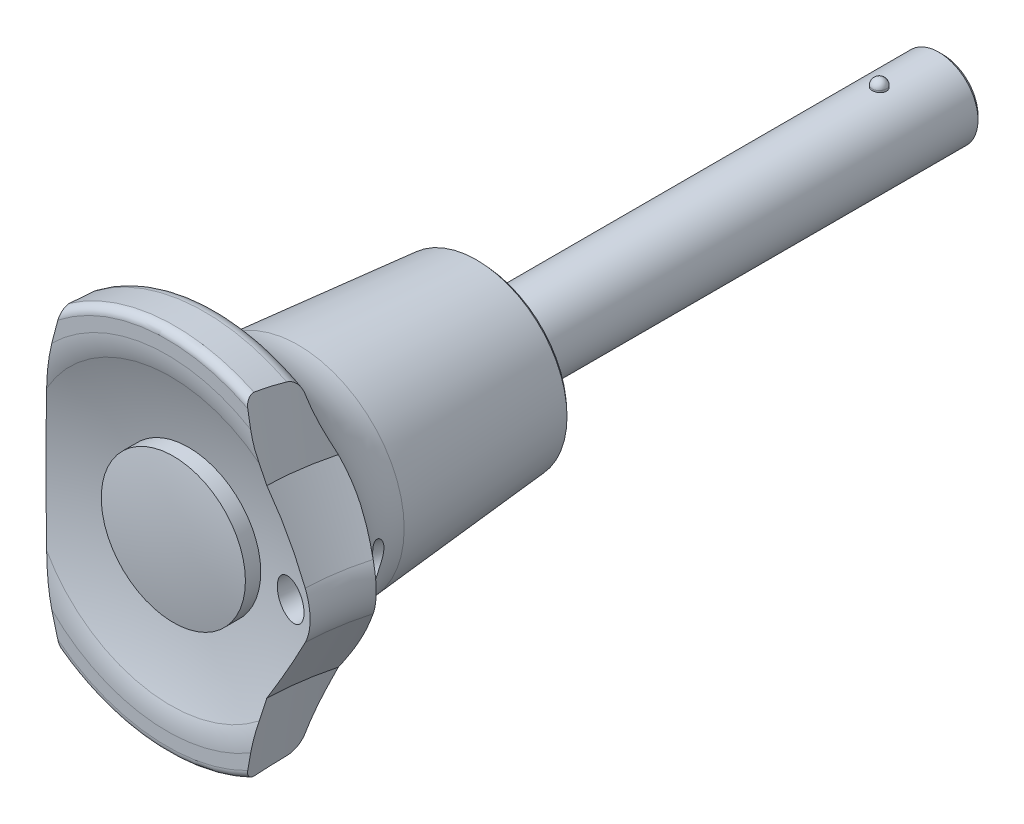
ISO-10303-21;
HEADER;
FILE_DESCRIPTION(('STEP AP214'),'2;1');
FILE_NAME('part.step','',(''),(''),'','','');
FILE_SCHEMA(('AUTOMOTIVE_DESIGN { 1 0 10303 214 1 1 1 1 }'));
ENDSEC;
DATA;
#1=APPLICATION_CONTEXT('core data for automotive mechanical design processes');
#2=APPLICATION_PROTOCOL_DEFINITION('international standard','automotive_design',2000,#1);
#3=PRODUCT_CONTEXT('',#1,'mechanical');
#4=PRODUCT('Part','Part','',(#3));
#5=PRODUCT_RELATED_PRODUCT_CATEGORY('part','',(#4));
#6=PRODUCT_DEFINITION_FORMATION('','',#4);
#7=PRODUCT_DEFINITION_CONTEXT('part definition',#1,'design');
#8=PRODUCT_DEFINITION('design','',#6,#7);
#9=PRODUCT_DEFINITION_SHAPE('','',#8);
#10=(LENGTH_UNIT() NAMED_UNIT(*) SI_UNIT(.MILLI.,.METRE.));
#11=(NAMED_UNIT(*) PLANE_ANGLE_UNIT() SI_UNIT($,.RADIAN.));
#12=(NAMED_UNIT(*) SI_UNIT($,.STERADIAN.) SOLID_ANGLE_UNIT());
#13=UNCERTAINTY_MEASURE_WITH_UNIT(LENGTH_MEASURE(1.E-05),#10,'distance_accuracy_value','');
#14=(GEOMETRIC_REPRESENTATION_CONTEXT(3) GLOBAL_UNCERTAINTY_ASSIGNED_CONTEXT((#13)) GLOBAL_UNIT_ASSIGNED_CONTEXT((#10,
#11,#12)) REPRESENTATION_CONTEXT('',''));
#15=CARTESIAN_POINT('',(0.,0.,0.));
#16=DIRECTION('',(0.,0.,1.));
#17=DIRECTION('',(1.,0.,0.));
#18=AXIS2_PLACEMENT_3D('',#15,#16,#17);
#19=CARTESIAN_POINT('',(0.,5.095,-50.9));
#20=DIRECTION('',(1.,0.,0.));
#21=DIRECTION('',(0.,1.,0.));
#22=AXIS2_PLACEMENT_3D('',#19,#20,#21);
#23=SPHERICAL_SURFACE('',#22,0.905);
#24=CARTESIAN_POINT('',(0.,5.19,-50.9));
#25=DIRECTION('',(0.,1.,0.));
#26=DIRECTION('',(0.,0.,1.));
#27=AXIS2_PLACEMENT_3D('',#24,#25,#26);
#28=CIRCLE('',#27,0.9);
#29=CARTESIAN_POINT('',(0.,5.19,-50.));
#30=VERTEX_POINT('',#29);
#31=EDGE_CURVE('E581',#30,#30,#28,.F.);
#32=ORIENTED_EDGE('',*,*,#31,.F.);
#33=EDGE_LOOP('',(#32));
#34=FACE_BOUND('',#33,.T.);
#35=ADVANCED_FACE('F14',(#34),#23,.T.);
#36=CARTESIAN_POINT('',(0.,-5.095,-50.9));
#37=DIRECTION('',(1.,0.,0.));
#38=DIRECTION('',(0.,1.,0.));
#39=AXIS2_PLACEMENT_3D('',#36,#37,#38);
#40=SPHERICAL_SURFACE('',#39,0.905000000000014);
#41=CARTESIAN_POINT('',(0.,-5.19000000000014,-50.9));
#42=DIRECTION('',(0.,1.,0.));
#43=DIRECTION('',(0.,0.,1.));
#44=AXIS2_PLACEMENT_3D('',#41,#42,#43);
#45=CIRCLE('',#44,0.9);
#46=CARTESIAN_POINT('',(0.,-5.19000000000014,-50.));
#47=VERTEX_POINT('',#46);
#48=EDGE_CURVE('E680',#47,#47,#45,.T.);
#49=ORIENTED_EDGE('',*,*,#48,.F.);
#50=EDGE_LOOP('',(#49));
#51=FACE_BOUND('',#50,.T.);
#52=ADVANCED_FACE('F670',(#51),#40,.T.);
#53=CARTESIAN_POINT('',(0.,2.25,-59.));
#54=DIRECTION('',(0.,0.,-1.));
#55=DIRECTION('',(-1.,0.,0.));
#56=AXIS2_PLACEMENT_3D('',#53,#54,#55);
#57=PLANE('',#56);
#58=CARTESIAN_POINT('',(0.,0.,-59.0000000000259));
#59=DIRECTION('',(0.,0.,1.));
#60=DIRECTION('',(1.,0.,0.));
#61=AXIS2_PLACEMENT_3D('',#58,#59,#60);
#62=CIRCLE('',#61,4.50000000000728);
#63=CARTESIAN_POINT('',(4.50000000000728,0.,-59.0000000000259));
#64=VERTEX_POINT('',#63);
#65=EDGE_CURVE('E681',#64,#64,#62,.T.);
#66=ORIENTED_EDGE('',*,*,#65,.F.);
#67=EDGE_LOOP('',(#66));
#68=FACE_BOUND('',#67,.T.);
#69=ADVANCED_FACE('F667',(#68),#57,.T.);
#70=CARTESIAN_POINT('',(0.,0.,-50.9));
#71=DIRECTION('',(0.,1.,0.));
#72=DIRECTION('',(0.,0.,1.));
#73=AXIS2_PLACEMENT_3D('',#70,#71,#72);
#74=CYLINDRICAL_SURFACE('',#73,0.9);
#75=CARTESIAN_POINT('',(0.,5.,-51.8));
#76=CARTESIAN_POINT('',(0.0501124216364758,4.99999901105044,-51.7999978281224));
#77=CARTESIAN_POINT('',(0.100255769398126,4.99923870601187,-51.7957998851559));
#78=CARTESIAN_POINT('',(0.199137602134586,4.99627847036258,-51.7791264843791));
#79=CARTESIAN_POINT('',(0.247874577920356,4.99407704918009,-51.7666424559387));
#80=CARTESIAN_POINT('',(0.342490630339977,4.9884811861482,-51.7337895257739));
#81=CARTESIAN_POINT('',(0.38837233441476,4.98508786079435,-51.7134280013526));
#82=CARTESIAN_POINT('',(0.476061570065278,4.97747978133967,-51.6654177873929));
#83=CARTESIAN_POINT('',(0.51786962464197,4.9732651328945,-51.6377700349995));
#84=CARTESIAN_POINT('',(0.596695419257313,4.96442800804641,-51.5756460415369));
#85=CARTESIAN_POINT('',(0.633661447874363,4.95980189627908,-51.5411046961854));
#86=CARTESIAN_POINT('',(0.701306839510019,4.95069050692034,-51.4663139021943));
#87=CARTESIAN_POINT('',(0.731985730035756,4.94620523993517,-51.4260640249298));
#88=CARTESIAN_POINT('',(0.786397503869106,4.93784820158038,-51.3406378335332));
#89=CARTESIAN_POINT('',(0.810078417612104,4.93398111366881,-51.2954279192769));
#90=CARTESIAN_POINT('',(0.849489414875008,4.92734915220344,-51.2015904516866));
#91=CARTESIAN_POINT('',(0.865220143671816,4.92458418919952,-51.1529631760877));
#92=CARTESIAN_POINT('',(0.888119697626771,4.92050592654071,-51.0542219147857));
#93=CARTESIAN_POINT('',(0.895378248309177,4.91917742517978,-51.0041293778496));
#94=CARTESIAN_POINT('',(0.901405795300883,4.91807661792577,-50.9034210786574));
#95=CARTESIAN_POINT('',(0.900175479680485,4.91830418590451,-50.8528053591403));
#96=CARTESIAN_POINT('',(0.889333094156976,4.92027595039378,-50.7531342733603));
#97=CARTESIAN_POINT('',(0.879822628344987,4.92200176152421,-50.7040674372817));
#98=CARTESIAN_POINT('',(0.85284959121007,4.92674673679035,-50.608236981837));
#99=CARTESIAN_POINT('',(0.835386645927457,4.92976596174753,-50.5614734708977));
#100=CARTESIAN_POINT('',(0.79290296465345,4.93677714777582,-50.4712762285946));
#101=CARTESIAN_POINT('',(0.767840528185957,4.94077445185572,-50.4278625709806));
#102=CARTESIAN_POINT('',(0.710900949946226,4.94928741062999,-50.3458218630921));
#103=CARTESIAN_POINT('',(0.679023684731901,4.95380307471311,-50.3071948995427));
#104=CARTESIAN_POINT('',(0.608815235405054,4.96292375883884,-50.2352394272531));
#105=CARTESIAN_POINT('',(0.570398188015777,4.96752913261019,-50.2019946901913));
#106=CARTESIAN_POINT('',(0.48846871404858,4.97625288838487,-50.1423951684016));
#107=CARTESIAN_POINT('',(0.444954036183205,4.98037105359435,-50.1160434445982));
#108=CARTESIAN_POINT('',(0.353963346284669,4.98766441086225,-50.0709683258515));
#109=CARTESIAN_POINT('',(0.306480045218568,4.99083781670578,-50.0522593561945));
#110=CARTESIAN_POINT('',(0.209052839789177,4.99586463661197,-50.0231462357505));
#111=CARTESIAN_POINT('',(0.159114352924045,4.99772082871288,-50.0127246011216));
#112=CARTESIAN_POINT('',(0.0726264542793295,4.99960356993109,-50.0021976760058));
#113=CARTESIAN_POINT('',(0.0363222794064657,5.0000010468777,-49.9999973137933));
#114=CARTESIAN_POINT('',(-0.050085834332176,4.99999855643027,-50.0000037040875));
#115=CARTESIAN_POINT('',(-0.100206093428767,4.99923934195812,-50.0041963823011));
#116=CARTESIAN_POINT('',(-0.199090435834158,4.99628073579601,-50.0208609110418));
#117=CARTESIAN_POINT('',(-0.247851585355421,4.99407844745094,-50.0333494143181));
#118=CARTESIAN_POINT('',(-0.342496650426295,4.98848079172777,-50.0662127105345));
#119=CARTESIAN_POINT('',(-0.38838420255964,4.98508696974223,-50.0865772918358));
#120=CARTESIAN_POINT('',(-0.476072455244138,4.97747869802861,-50.1345893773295));
#121=CARTESIAN_POINT('',(-0.517874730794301,4.97326456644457,-50.1622340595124));
#122=CARTESIAN_POINT('',(-0.596690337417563,4.96442857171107,-50.2243498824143));
#123=CARTESIAN_POINT('',(-0.633651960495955,4.95980307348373,-50.2588861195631));
#124=CARTESIAN_POINT('',(-0.701299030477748,4.95069165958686,-50.3336761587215));
#125=CARTESIAN_POINT('',(-0.731982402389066,4.94620579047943,-50.3739318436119));
#126=CARTESIAN_POINT('',(-0.78641186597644,4.93784595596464,-50.4593836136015));
#127=CARTESIAN_POINT('',(-0.810103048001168,4.93397693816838,-50.5046151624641));
#128=CARTESIAN_POINT('',(-0.849506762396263,4.9273462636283,-50.5984664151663));
#129=CARTESIAN_POINT('',(-0.865228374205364,4.9245833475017,-50.6470821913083));
#130=CARTESIAN_POINT('',(-0.884453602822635,4.92115841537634,-50.7299635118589));
#131=CARTESIAN_POINT('',(-0.890274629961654,4.92010435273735,-50.7636935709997));
#132=CARTESIAN_POINT('',(-0.898048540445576,4.91869131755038,-50.8316109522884));
#133=CARTESIAN_POINT('',(-0.90000148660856,4.91833233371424,-50.8657982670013));
#134=CARTESIAN_POINT('',(-0.899997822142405,4.91833410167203,-50.9501049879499));
#135=CARTESIAN_POINT('',(-0.895801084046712,4.91910713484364,-51.0002409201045));
#136=CARTESIAN_POINT('',(-0.879132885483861,4.92211278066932,-51.0991073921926));
#137=CARTESIAN_POINT('',(-0.866652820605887,4.92434691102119,-51.1478364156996));
#138=CARTESIAN_POINT('',(-0.833811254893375,4.93001364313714,-51.2424363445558));
#139=CARTESIAN_POINT('',(-0.813457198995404,4.93344511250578,-51.2883099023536));
#140=CARTESIAN_POINT('',(-0.765465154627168,4.94111838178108,-51.3759841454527));
#141=CARTESIAN_POINT('',(-0.737828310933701,4.94536005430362,-51.4177854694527));
#142=CARTESIAN_POINT('',(-0.675719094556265,4.95423002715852,-51.49661301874));
#143=CARTESIAN_POINT('',(-0.641179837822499,4.95886183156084,-51.5335861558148));
#144=CARTESIAN_POINT('',(-0.566380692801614,4.9679602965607,-51.6012537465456));
#145=CARTESIAN_POINT('',(-0.526119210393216,4.9724269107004,-51.6319464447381));
#146=CARTESIAN_POINT('',(-0.44066245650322,4.98073004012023,-51.6863859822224));
#147=CARTESIAN_POINT('',(-0.395432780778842,4.98456163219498,-51.7100795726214));
#148=CARTESIAN_POINT('',(-0.301585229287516,4.99111708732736,-51.7494884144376));
#149=CARTESIAN_POINT('',(-0.252971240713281,4.99384219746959,-51.7652126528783));
#150=CARTESIAN_POINT('',(-0.170082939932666,4.99721806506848,-51.7844450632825));
#151=CARTESIAN_POINT('',(-0.136343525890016,4.99825616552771,-51.7902693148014));
#152=CARTESIAN_POINT('',(-0.0684075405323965,4.99964746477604,-51.7980474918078));
#153=CARTESIAN_POINT('',(-0.0342109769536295,5.0000006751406,-51.8000014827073));
#154=CARTESIAN_POINT('',(0.,5.,-51.8));
#155=B_SPLINE_CURVE_WITH_KNOTS('',3,(#75,#76,#77,#78,#79,#80,#81,#82,#83,#84,#85,#86,#87,#88,
#89,#90,#91,#92,#93,#94,#95,#96,#97,#98,#99,#100,#101,#102,#103,#104,#105,#106,#107,#108,#109,
#110,#111,#112,#113,#114,#115,#116,#117,#118,#119,#120,#121,#122,#123,#124,#125,#126,#127,#128,
#129,#130,#131,#132,#133,#134,#135,#136,#137,#138,#139,#140,#141,#142,#143,#144,#145,#146,#147,
#148,#149,#150,#151,#152,#153,#154),.UNSPECIFIED.,.T.,.F.,(4,2,2,2,2,2,2,2,2,2,2,2,2,2,2,2,2,2,
2,2,2,2,2,2,2,2,2,2,2,2,2,2,2,2,2,2,2,2,2,4),(0.,0.1502115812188,0.300578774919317,
0.450805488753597,0.601012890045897,0.752712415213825,0.904423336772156,1.05723413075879,
1.21003251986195,1.36119756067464,1.51235034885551,1.6616741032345,1.81100488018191,
1.96117037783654,2.11133859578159,2.26365668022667,2.41604228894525,2.56871420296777,
2.72106316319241,2.82994351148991,2.98008175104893,3.13052228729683,3.28076842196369,
3.43095640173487,3.58263659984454,3.73436684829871,3.88725873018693,4.03997603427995,
4.14249708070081,4.24501646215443,4.39520570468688,4.54555120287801,4.695754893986,
4.84593498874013,4.99764780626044,5.14940297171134,5.30228458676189,5.45499341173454,
5.55754227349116,5.66008940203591),.UNSPECIFIED.);
#156=CARTESIAN_POINT('',(0.,5.,-51.8));
#157=VERTEX_POINT('',#156);
#158=EDGE_CURVE('E639',#157,#157,#155,.T.);
#159=ORIENTED_EDGE('',*,*,#158,.F.);
#160=EDGE_LOOP('',(#159));
#161=FACE_BOUND('',#160,.T.);
#162=ORIENTED_EDGE('',*,*,#31,.T.);
#163=EDGE_LOOP('',(#162));
#164=FACE_BOUND('',#163,.T.);
#165=ADVANCED_FACE('F662',(#161,#164),#74,.T.);
#166=CARTESIAN_POINT('',(0.,0.,-50.9));
#167=DIRECTION('',(0.,1.,0.));
#168=DIRECTION('',(0.,0.,1.));
#169=AXIS2_PLACEMENT_3D('',#166,#167,#168);
#170=CYLINDRICAL_SURFACE('',#169,0.9);
#171=ORIENTED_EDGE('',*,*,#48,.T.);
#172=EDGE_LOOP('',(#171));
#173=FACE_BOUND('',#172,.T.);
#174=CARTESIAN_POINT('',(0.,-5.,-50.));
#175=CARTESIAN_POINT('',(0.0500692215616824,-4.99999896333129,-50.0000023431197));
#176=CARTESIAN_POINT('',(0.100201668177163,-4.99923945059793,-50.0041960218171));
#177=CARTESIAN_POINT('',(0.199094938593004,-4.99628062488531,-50.0208612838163));
#178=CARTESIAN_POINT('',(0.247852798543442,-4.99407841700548,-50.0333495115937));
#179=CARTESIAN_POINT('',(0.342494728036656,-4.98848086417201,-50.0662123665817));
#180=CARTESIAN_POINT('',(0.388382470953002,-4.98508708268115,-50.0865766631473));
#181=CARTESIAN_POINT('',(0.476071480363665,-4.97747881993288,-50.1345885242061));
#182=CARTESIAN_POINT('',(0.5178741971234,-4.97326463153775,-50.1622334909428));
#183=CARTESIAN_POINT('',(0.596694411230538,-4.96442810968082,-50.2243532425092));
#184=CARTESIAN_POINT('',(0.633659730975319,-4.95980210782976,-50.2588937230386));
#185=CARTESIAN_POINT('',(0.70130546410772,-4.9506907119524,-50.3336842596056));
#186=CARTESIAN_POINT('',(0.731985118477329,-4.94620533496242,-50.3739350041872));
#187=CARTESIAN_POINT('',(0.786397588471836,-4.93784818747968,-50.4593623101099));
#188=CARTESIAN_POINT('',(0.810078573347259,-4.93398108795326,-50.5045723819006));
#189=CARTESIAN_POINT('',(0.849489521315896,-4.92734913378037,-50.5984098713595));
#190=CARTESIAN_POINT('',(0.86522018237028,-4.92458418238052,-50.6470369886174));
#191=CARTESIAN_POINT('',(0.888119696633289,-4.92050592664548,-50.7457780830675));
#192=CARTESIAN_POINT('',(0.895378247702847,-4.9191774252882,-50.7958706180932));
#193=CARTESIAN_POINT('',(0.901405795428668,-4.91807661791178,-50.8965789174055));
#194=CARTESIAN_POINT('',(0.90017547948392,-4.91830418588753,-50.9471946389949));
#195=CARTESIAN_POINT('',(0.889333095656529,-4.92027595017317,-51.0468657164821));
#196=CARTESIAN_POINT('',(0.879822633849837,-4.92200176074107,-51.095932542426));
#197=CARTESIAN_POINT('',(0.852849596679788,-4.92674673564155,-51.1917629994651));
#198=CARTESIAN_POINT('',(0.835386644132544,-4.92976596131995,-51.2385265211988));
#199=CARTESIAN_POINT('',(0.792902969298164,-4.93677714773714,-51.328723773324));
#200=CARTESIAN_POINT('',(0.767840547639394,-4.94077445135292,-51.3721374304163));
#201=CARTESIAN_POINT('',(0.710900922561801,-4.94928741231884,-51.4541781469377));
#202=CARTESIAN_POINT('',(0.679023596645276,-4.95380307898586,-51.4928051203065));
#203=CARTESIAN_POINT('',(0.608815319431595,-4.96292375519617,-51.5647605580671));
#204=CARTESIAN_POINT('',(0.570398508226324,-4.96752911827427,-51.5980052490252));
#205=CARTESIAN_POINT('',(0.488468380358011,-4.97625290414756,-51.6576049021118));
#206=CARTESIAN_POINT('',(0.444952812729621,-4.98037111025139,-51.6839568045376));
#207=CARTESIAN_POINT('',(0.353964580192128,-4.98766435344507,-51.7290314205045));
#208=CARTESIAN_POINT('',(0.306484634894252,-4.99083760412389,-51.7477397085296));
#209=CARTESIAN_POINT('',(0.209048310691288,-4.99586484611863,-51.7768546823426));
#210=CARTESIAN_POINT('',(0.159097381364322,-4.99772161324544,-51.7872788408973));
#211=CARTESIAN_POINT('',(0.0906480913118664,-4.99921111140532,-51.7956083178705));
#212=CARTESIAN_POINT('',(0.0725612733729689,-4.99950630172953,-51.7972538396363));
#213=CARTESIAN_POINT('',(0.0363190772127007,-4.99990093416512,-51.7994501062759));
#214=CARTESIAN_POINT('',(0.0181636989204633,-5.00000037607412,-51.8000008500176));
#215=CARTESIAN_POINT('',(-0.0500692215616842,-4.99999896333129,-51.7999976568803));
#216=CARTESIAN_POINT('',(-0.100201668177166,-4.99923945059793,-51.7958039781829));
#217=CARTESIAN_POINT('',(-0.199094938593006,-4.99628062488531,-51.7791387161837));
#218=CARTESIAN_POINT('',(-0.247852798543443,-4.99407841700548,-51.7666504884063));
#219=CARTESIAN_POINT('',(-0.342494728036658,-4.98848086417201,-51.7337876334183));
#220=CARTESIAN_POINT('',(-0.388382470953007,-4.98508708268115,-51.7134233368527));
#221=CARTESIAN_POINT('',(-0.476071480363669,-4.97747881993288,-51.6654114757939));
#222=CARTESIAN_POINT('',(-0.517874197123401,-4.97326463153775,-51.6377665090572));
#223=CARTESIAN_POINT('',(-0.596694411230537,-4.96442810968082,-51.5756467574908));
#224=CARTESIAN_POINT('',(-0.633659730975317,-4.95980210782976,-51.5411062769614));
#225=CARTESIAN_POINT('',(-0.70130546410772,-4.9506907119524,-51.4663157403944));
#226=CARTESIAN_POINT('',(-0.73198511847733,-4.94620533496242,-51.4260649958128));
#227=CARTESIAN_POINT('',(-0.786397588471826,-4.93784818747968,-51.3406376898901));
#228=CARTESIAN_POINT('',(-0.810078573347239,-4.93398108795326,-51.2954276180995));
#229=CARTESIAN_POINT('',(-0.84948952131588,-4.92734913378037,-51.2015901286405));
#230=CARTESIAN_POINT('',(-0.86522018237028,-4.92458418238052,-51.1529630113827));
#231=CARTESIAN_POINT('',(-0.888119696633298,-4.92050592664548,-51.0542219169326));
#232=CARTESIAN_POINT('',(-0.895378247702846,-4.9191774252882,-51.0041293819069));
#233=CARTESIAN_POINT('',(-0.901405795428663,-4.91807661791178,-50.9034210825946));
#234=CARTESIAN_POINT('',(-0.900175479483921,-4.91830418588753,-50.8528053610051));
#235=CARTESIAN_POINT('',(-0.889333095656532,-4.92027595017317,-50.7531342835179));
#236=CARTESIAN_POINT('',(-0.879822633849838,-4.92200176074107,-50.704067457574));
#237=CARTESIAN_POINT('',(-0.852849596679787,-4.92674673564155,-50.6082370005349));
#238=CARTESIAN_POINT('',(-0.835386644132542,-4.92976596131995,-50.5614734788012));
#239=CARTESIAN_POINT('',(-0.792902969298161,-4.93677714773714,-50.471276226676));
#240=CARTESIAN_POINT('',(-0.767840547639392,-4.94077445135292,-50.4278625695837));
#241=CARTESIAN_POINT('',(-0.710900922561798,-4.94928741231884,-50.3458218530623));
#242=CARTESIAN_POINT('',(-0.67902359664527,-4.95380307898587,-50.3071948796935));
#243=CARTESIAN_POINT('',(-0.608815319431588,-4.96292375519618,-50.2352394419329));
#244=CARTESIAN_POINT('',(-0.570398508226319,-4.96752911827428,-50.2019947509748));
#245=CARTESIAN_POINT('',(-0.488468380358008,-4.97625290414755,-50.1423950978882));
#246=CARTESIAN_POINT('',(-0.444952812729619,-4.98037111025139,-50.1160431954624));
#247=CARTESIAN_POINT('',(-0.353964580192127,-4.98766435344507,-50.0709685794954));
#248=CARTESIAN_POINT('',(-0.306484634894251,-4.99083760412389,-50.0522602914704));
#249=CARTESIAN_POINT('',(-0.209048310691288,-4.99586484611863,-50.0231453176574));
#250=CARTESIAN_POINT('',(-0.159097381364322,-4.99772161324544,-50.0127211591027));
#251=CARTESIAN_POINT('',(-0.0906480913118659,-4.99921111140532,-50.0043916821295));
#252=CARTESIAN_POINT('',(-0.0725612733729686,-4.99950630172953,-50.0027461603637));
#253=CARTESIAN_POINT('',(-0.0363190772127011,-4.99990093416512,-50.0005498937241));
#254=CARTESIAN_POINT('',(-0.0181636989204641,-5.00000037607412,-49.9999991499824));
#255=CARTESIAN_POINT('',(0.,-5.,-50.));
#256=B_SPLINE_CURVE_WITH_KNOTS('',3,(#174,#175,#176,#177,#178,#179,#180,#181,#182,#183,#184,
#185,#186,#187,#188,#189,#190,#191,#192,#193,#194,#195,#196,#197,#198,#199,#200,#201,#202,#203,
#204,#205,#206,#207,#208,#209,#210,#211,#212,#213,#214,#215,#216,#217,#218,#219,#220,#221,#222,
#223,#224,#225,#226,#227,#228,#229,#230,#231,#232,#233,#234,#235,#236,#237,#238,#239,#240,#241,
#242,#243,#244,#245,#246,#247,#248,#249,#250,#251,#252,#253,#254,#255),.UNSPECIFIED.,.T.,.F.,(4,
2,2,2,2,2,2,2,2,2,2,2,2,2,2,2,2,2,2,2,2,2,2,2,2,2,2,2,2,2,2,2,2,2,2,2,2,2,2,2,4),(0.,
0.150138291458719,0.300578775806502,0.450822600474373,0.60101289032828,0.752708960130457,
0.904423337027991,1.05723463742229,1.21003252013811,1.36119755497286,1.51235034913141,
1.66167407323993,1.81100488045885,1.96117038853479,2.11133859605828,2.26365669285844,
2.41604228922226,2.56871416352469,2.72106316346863,2.77552903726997,2.82999496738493,
2.98013325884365,3.13057374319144,3.28081756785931,3.43100785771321,3.58270392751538,
3.73441830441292,3.88722960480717,4.04002748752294,4.19119252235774,4.34234531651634,
4.49166904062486,4.64099984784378,4.79116535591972,4.94133356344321,5.09365166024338,
5.24603725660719,5.39870913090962,5.55105813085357,5.6055240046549,5.65998993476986),.UNSPECIFIED.);
#257=CARTESIAN_POINT('',(0.,-5.,-50.));
#258=VERTEX_POINT('',#257);
#259=EDGE_CURVE('E643',#258,#258,#256,.T.);
#260=ORIENTED_EDGE('',*,*,#259,.F.);
#261=EDGE_LOOP('',(#260));
#262=FACE_BOUND('',#261,.T.);
#263=ADVANCED_FACE('F632',(#173,#262),#170,.T.);
#264=CARTESIAN_POINT('',(0.,0.,-58.5000000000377));
#265=DIRECTION('',(0.,0.,1.));
#266=DIRECTION('',(1.,0.,0.));
#267=AXIS2_PLACEMENT_3D('',#264,#265,#266);
#268=CONICAL_SURFACE('',#267,4.99999999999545,0.785398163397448);
#269=ORIENTED_EDGE('',*,*,#65,.T.);
#270=EDGE_LOOP('',(#269));
#271=FACE_BOUND('',#270,.T.);
#272=CARTESIAN_POINT('',(0.,0.,-58.5));
#273=DIRECTION('',(0.,0.,1.));
#274=DIRECTION('',(1.,0.,0.));
#275=AXIS2_PLACEMENT_3D('',#272,#273,#274);
#276=CIRCLE('',#275,5.);
#277=CARTESIAN_POINT('',(5.,0.,-58.5));
#278=VERTEX_POINT('',#277);
#279=EDGE_CURVE('E24',#278,#278,#276,.T.);
#280=ORIENTED_EDGE('',*,*,#279,.F.);
#281=EDGE_LOOP('',(#280));
#282=FACE_BOUND('',#281,.T.);
#283=ADVANCED_FACE('F627',(#271,#282),#268,.T.);
#284=CARTESIAN_POINT('',(0.,0.,-19.25));
#285=DIRECTION('',(0.,0.,1.));
#286=DIRECTION('',(1.,0.,0.));
#287=AXIS2_PLACEMENT_3D('',#284,#285,#286);
#288=CYLINDRICAL_SURFACE('',#287,5.);
#289=CARTESIAN_POINT('',(0.,0.,0.));
#290=DIRECTION('',(0.,0.,-1.));
#291=DIRECTION('',(-1.,0.,0.));
#292=AXIS2_PLACEMENT_3D('',#289,#290,#291);
#293=CIRCLE('',#292,5.);
#294=CARTESIAN_POINT('',(-5.,0.,0.));
#295=VERTEX_POINT('',#294);
#296=EDGE_CURVE('E9',#295,#295,#293,.F.);
#297=ORIENTED_EDGE('',*,*,#296,.F.);
#298=EDGE_LOOP('',(#297));
#299=FACE_BOUND('',#298,.T.);
#300=ORIENTED_EDGE('',*,*,#158,.T.);
#301=EDGE_LOOP('',(#300));
#302=FACE_BOUND('',#301,.T.);
#303=ORIENTED_EDGE('',*,*,#259,.T.);
#304=EDGE_LOOP('',(#303));
#305=FACE_BOUND('',#304,.T.);
#306=ORIENTED_EDGE('',*,*,#279,.T.);
#307=EDGE_LOOP('',(#306));
#308=FACE_BOUND('',#307,.T.);
#309=ADVANCED_FACE('F16',(#299,#302,#305,#308),#288,.T.);
#310=CARTESIAN_POINT('',(0.,-2.65618770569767E-13,-13.3000000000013));
#311=DIRECTION('',(1.,0.,0.));
#312=DIRECTION('',(0.,1.,0.));
#313=AXIS2_PLACEMENT_3D('',#310,#311,#312);
#314=SPHERICAL_SURFACE('',#313,53.3000000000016);
#315=CARTESIAN_POINT('',(0.,0.,39.2));
#316=DIRECTION('',(0.,0.,1.));
#317=DIRECTION('',(1.,0.,0.));
#318=AXIS2_PLACEMENT_3D('',#315,#316,#317);
#319=CIRCLE('',#318,9.2);
#320=CARTESIAN_POINT('',(9.2,0.,39.2));
#321=VERTEX_POINT('',#320);
#322=EDGE_CURVE('E575',#321,#321,#319,.F.);
#323=ORIENTED_EDGE('',*,*,#322,.F.);
#324=EDGE_LOOP('',(#323));
#325=FACE_BOUND('',#324,.T.);
#326=ADVANCED_FACE('F590',(#325),#314,.T.);
#327=CARTESIAN_POINT('',(0.,0.,29.6));
#328=DIRECTION('',(0.,0.,1.));
#329=DIRECTION('',(1.,0.,0.));
#330=AXIS2_PLACEMENT_3D('',#327,#328,#329);
#331=CYLINDRICAL_SURFACE('',#330,9.2);
#332=ORIENTED_EDGE('',*,*,#322,.T.);
#333=EDGE_LOOP('',(#332));
#334=FACE_BOUND('',#333,.T.);
#335=CARTESIAN_POINT('',(9.2,0.,37.2467115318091));
#336=CARTESIAN_POINT('',(9.20000185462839,-0.258477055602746,37.2467115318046));
#337=CARTESIAN_POINT('',(9.18910252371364,-0.516923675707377,37.2467115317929));
#338=CARTESIAN_POINT('',(9.14558128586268,-1.0320661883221,37.2467115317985));
#339=CARTESIAN_POINT('',(9.11295366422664,-1.28876160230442,37.2467115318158));
#340=CARTESIAN_POINT('',(9.02615325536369,-1.79876171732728,37.2467115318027));
#341=CARTESIAN_POINT('',(8.97195747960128,-2.05206250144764,37.2467115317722));
#342=CARTESIAN_POINT('',(8.84240671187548,-2.55319845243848,37.2467115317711));
#343=CARTESIAN_POINT('',(8.7670514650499,-2.80103355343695,37.2467115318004));
#344=CARTESIAN_POINT('',(8.59576047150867,-3.2893491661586,37.2467115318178));
#345=CARTESIAN_POINT('',(8.49983486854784,-3.52983323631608,37.2467115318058));
#346=CARTESIAN_POINT('',(8.28806173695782,-4.00186826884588,37.246711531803));
#347=CARTESIAN_POINT('',(8.17221389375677,-4.23341909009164,37.2467115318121));
#348=CARTESIAN_POINT('',(7.92147515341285,-4.68583944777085,37.2467115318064));
#349=CARTESIAN_POINT('',(7.78659246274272,-4.90671353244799,37.2467115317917));
#350=CARTESIAN_POINT('',(7.49865494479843,-5.3363920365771,37.2467115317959));
#351=CARTESIAN_POINT('',(7.34559384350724,-5.54519225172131,37.2467115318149));
#352=CARTESIAN_POINT('',(7.0224378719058,-5.94913959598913,37.2467115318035));
#353=CARTESIAN_POINT('',(6.85234434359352,-6.14428779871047,37.2467115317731));
#354=CARTESIAN_POINT('',(6.49631888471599,-6.51956588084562,37.246711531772));
#355=CARTESIAN_POINT('',(6.31038662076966,-6.69969544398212,37.2467115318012));
#356=CARTESIAN_POINT('',(5.92400519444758,-7.04365410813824,37.2467115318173));
#357=CARTESIAN_POINT('',(5.72355577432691,-7.20748291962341,37.2467115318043));
#358=CARTESIAN_POINT('',(5.30956347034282,-7.5176751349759,37.2467115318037));
#359=CARTESIAN_POINT('',(5.09602029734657,-7.66403815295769,37.2467115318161));
#360=CARTESIAN_POINT('',(4.65736864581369,-7.93825027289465,37.2467115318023));
#361=CARTESIAN_POINT('',(4.43226047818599,-8.06609987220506,37.246711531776));
#362=CARTESIAN_POINT('',(3.97207525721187,-8.30238022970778,37.2467115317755));
#363=CARTESIAN_POINT('',(3.73699826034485,-8.41081109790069,37.2467115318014));
#364=CARTESIAN_POINT('',(3.25854539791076,-8.60748402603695,37.246711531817));
#365=CARTESIAN_POINT('',(3.01516953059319,-8.69572608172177,37.2467115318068));
#366=CARTESIAN_POINT('',(2.5218489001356,-8.8513941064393,37.2467115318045));
#367=CARTESIAN_POINT('',(2.27190412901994,-8.9188200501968,37.2467115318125));
#368=CARTESIAN_POINT('',(1.76726641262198,-9.03236657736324,37.2467115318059));
#369=CARTESIAN_POINT('',(1.51257429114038,-9.07849082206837,37.2467115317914));
#370=CARTESIAN_POINT('',(1.00012124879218,-9.14913549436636,37.2467115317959));
#371=CARTESIAN_POINT('',(0.742359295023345,-9.17364842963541,37.2467115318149));
#372=CARTESIAN_POINT('',(0.225734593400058,-9.20086637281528,37.2467115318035));
#373=CARTESIAN_POINT('',(-0.03312794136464,-9.20357542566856,37.2467115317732));
#374=CARTESIAN_POINT('',(-0.550166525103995,-9.18717680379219,37.246711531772));
#375=CARTESIAN_POINT('',(-0.808342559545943,-9.16806867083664,37.2467115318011));
#376=CARTESIAN_POINT('',(-1.32216168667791,-9.10817141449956,37.2467115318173));
#377=CARTESIAN_POINT('',(-1.57780483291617,-9.06738275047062,37.2467115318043));
#378=CARTESIAN_POINT('',(-2.08475193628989,-8.96441355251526,37.2467115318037));
#379=CARTESIAN_POINT('',(-2.33605579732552,-8.90223254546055,37.2467115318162));
#380=CARTESIAN_POINT('',(-2.83253007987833,-8.75692145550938,37.2467115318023));
#381=CARTESIAN_POINT('',(-3.07770054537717,-8.67379152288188,37.246711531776));
#382=CARTESIAN_POINT('',(-3.56016551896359,-8.48717389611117,37.2467115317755));
#383=CARTESIAN_POINT('',(-3.79746007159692,-8.38368631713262,37.2467115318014));
#384=CARTESIAN_POINT('',(-4.26248809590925,-8.15708862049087,37.246711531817));
#385=CARTESIAN_POINT('',(-4.49022154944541,-8.03397846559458,37.2467115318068));
#386=CARTESIAN_POINT('',(-4.93450813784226,-7.7690108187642,37.2467115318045));
#387=CARTESIAN_POINT('',(-5.15106125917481,-7.62715330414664,37.2467115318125));
#388=CARTESIAN_POINT('',(-5.57141062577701,-7.32572590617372,37.2467115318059));
#389=CARTESIAN_POINT('',(-5.77520908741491,-7.16615911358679,37.2467115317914));
#390=CARTESIAN_POINT('',(-6.1687101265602,-6.83036880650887,37.246711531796));
#391=CARTESIAN_POINT('',(-6.35840779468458,-6.65413953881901,37.2467115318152));
#392=CARTESIAN_POINT('',(-6.72224710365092,-6.28635764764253,37.2467115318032));
#393=CARTESIAN_POINT('',(-6.89639155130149,-6.09480780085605,37.2467115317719));
#394=CARTESIAN_POINT('',(-7.22792754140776,-5.69771568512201,37.2467115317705));
#395=CARTESIAN_POINT('',(-7.38531882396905,-5.49217319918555,37.2467115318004));
#396=CARTESIAN_POINT('',(-7.68222361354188,-5.06856374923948,37.246711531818));
#397=CARTESIAN_POINT('',(-7.82173745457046,-4.85049701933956,37.2467115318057));
#398=CARTESIAN_POINT('',(-8.0819018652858,-4.4033808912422,37.2467115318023));
#399=CARTESIAN_POINT('',(-8.20255201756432,-4.17433125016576,37.2467115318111));
#400=CARTESIAN_POINT('',(-8.42410685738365,-3.70692592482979,37.2467115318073));
#401=CARTESIAN_POINT('',(-8.52501522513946,-3.4685719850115,37.2467115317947));
#402=CARTESIAN_POINT('',(-8.70642929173,-2.98412666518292,37.2467115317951));
#403=CARTESIAN_POINT('',(-8.78692781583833,-2.73803259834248,37.2467115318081));
#404=CARTESIAN_POINT('',(-8.92687528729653,-2.24003727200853,37.2467115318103));
#405=CARTESIAN_POINT('',(-8.9863326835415,-1.98813838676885,37.2467115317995));
#406=CARTESIAN_POINT('',(-9.08384258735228,-1.48011271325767,37.2467115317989));
#407=CARTESIAN_POINT('',(-9.12188538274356,-1.22398406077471,37.2467115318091));
#408=CARTESIAN_POINT('',(-9.17625392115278,-0.709432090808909,37.2467115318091));
#409=CARTESIAN_POINT('',(-9.19257966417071,-0.451008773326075,37.2467115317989));
#410=CARTESIAN_POINT('',(-9.20339556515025,0.0661771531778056,37.2467115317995));
#411=CARTESIAN_POINT('',(-9.19789561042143,0.324939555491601,37.2467115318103));
#412=CARTESIAN_POINT('',(-9.16511481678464,0.841185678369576,37.2467115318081));
#413=CARTESIAN_POINT('',(-9.13782521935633,1.09866884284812,37.2467115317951));
#414=CARTESIAN_POINT('',(-9.06166168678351,1.61033030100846,37.2467115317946));
#415=CARTESIAN_POINT('',(-9.01279532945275,1.86450972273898,37.2467115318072));
#416=CARTESIAN_POINT('',(-8.89381622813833,2.3678965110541,37.246711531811));
#417=CARTESIAN_POINT('',(-8.82369952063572,2.6171029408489,37.2467115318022));
#418=CARTESIAN_POINT('',(-8.66272318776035,3.10871759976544,37.2467115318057));
#419=CARTESIAN_POINT('',(-8.5718640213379,3.35112597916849,37.246711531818));
#420=CARTESIAN_POINT('',(-8.37004594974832,3.82743143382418,37.2467115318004));
#421=CARTESIAN_POINT('',(-8.25908666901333,4.06132834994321,37.2467115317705));
#422=CARTESIAN_POINT('',(-8.01786026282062,4.51893962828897,37.2467115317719));
#423=CARTESIAN_POINT('',(-7.88759343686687,4.74265414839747,37.2467115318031));
#424=CARTESIAN_POINT('',(-7.60865148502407,5.17835352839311,37.2467115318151));
#425=CARTESIAN_POINT('',(-7.45997303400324,5.39033625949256,37.246711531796));
#426=CARTESIAN_POINT('',(-7.14533841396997,5.80094952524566,37.2467115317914));
#427=CARTESIAN_POINT('',(-6.97938824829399,5.99958466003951,37.2467115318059));
#428=CARTESIAN_POINT('',(-6.63131665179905,6.3822048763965,37.2467115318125));
#429=CARTESIAN_POINT('',(-6.44919240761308,6.56618739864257,37.2467115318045));
#430=CARTESIAN_POINT('',(-6.07009243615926,6.91815563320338,37.2467115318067));
#431=CARTESIAN_POINT('',(-5.87311672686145,7.08614136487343,37.2467115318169));
#432=CARTESIAN_POINT('',(-5.46571438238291,7.40492171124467,37.2467115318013));
#433=CARTESIAN_POINT('',(-5.25528777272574,7.55571635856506,37.2467115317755));
#434=CARTESIAN_POINT('',(-4.8224780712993,7.83904364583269,37.2467115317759));
#435=CARTESIAN_POINT('',(-4.60009491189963,7.971576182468,37.2467115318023));
#436=CARTESIAN_POINT('',(-4.14495258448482,8.21743689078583,37.2467115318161));
#437=CARTESIAN_POINT('',(-3.91219334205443,8.33076492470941,37.2467115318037));
#438=CARTESIAN_POINT('',(-3.43796040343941,8.53740746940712,37.2467115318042));
#439=CARTESIAN_POINT('',(-3.19648690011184,8.6307224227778,37.2467115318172));
#440=CARTESIAN_POINT('',(-2.70653205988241,8.7966803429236,37.246711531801));
#441=CARTESIAN_POINT('',(-2.45805057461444,8.86932287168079,37.2467115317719));
#442=CARTESIAN_POINT('',(-1.95585656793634,8.99341554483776,37.2467115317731));
#443=CARTESIAN_POINT('',(-1.70214415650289,9.04486613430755,37.2467115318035));
#444=CARTESIAN_POINT('',(-1.19123944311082,9.12621890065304,37.2467115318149));
#445=CARTESIAN_POINT('',(-0.934046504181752,9.15611707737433,37.2467115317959));
#446=CARTESIAN_POINT('',(-0.418145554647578,9.19413024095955,37.2467115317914));
#447=CARTESIAN_POINT('',(-0.159438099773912,9.20225277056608,37.2467115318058));
#448=CARTESIAN_POINT('',(0.357786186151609,9.19667812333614,37.2467115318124));
#449=CARTESIAN_POINT('',(0.616302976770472,9.18297719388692,37.2467115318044));
#450=CARTESIAN_POINT('',(1.1312630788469,9.13384602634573,37.2467115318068));
#451=CARTESIAN_POINT('',(1.38770639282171,9.09841581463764,37.246711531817));
#452=CARTESIAN_POINT('',(1.89669667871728,9.00607800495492,37.2467115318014));
#453=CARTESIAN_POINT('',(2.1492436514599,8.9491704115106,37.2467115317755));
#454=CARTESIAN_POINT('',(2.64864726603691,8.81428203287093,37.2467115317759));
#455=CARTESIAN_POINT('',(2.89550387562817,8.73630112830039,37.2467115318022));
#456=CARTESIAN_POINT('',(3.38177681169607,8.55981829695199,37.246711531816));
#457=CARTESIAN_POINT('',(3.62119293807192,8.46131581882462,37.2467115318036));
#458=CARTESIAN_POINT('',(4.09087056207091,8.2444938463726,37.2467115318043));
#459=CARTESIAN_POINT('',(4.32113226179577,8.12617478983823,37.2467115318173));
#460=CARTESIAN_POINT('',(4.77086558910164,7.87056159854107,37.2467115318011));
#461=CARTESIAN_POINT('',(4.99033740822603,7.73326780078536,37.246711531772));
#462=CARTESIAN_POINT('',(5.4169305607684,7.44068268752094,37.2467115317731));
#463=CARTESIAN_POINT('',(5.62405215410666,7.28539175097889,37.2467115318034));
#464=CARTESIAN_POINT('',(6.02449325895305,6.95790104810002,37.2467115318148));
#465=CARTESIAN_POINT('',(6.21781168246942,6.78569995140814,37.2467115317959));
#466=CARTESIAN_POINT('',(6.58918960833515,6.42568596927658,37.2467115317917));
#467=CARTESIAN_POINT('',(6.76725436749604,6.23787850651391,37.2467115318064));
#468=CARTESIAN_POINT('',(7.10700778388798,5.84785067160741,37.246711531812));
#469=CARTESIAN_POINT('',(7.26868936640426,5.6456241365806,37.2467115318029));
#470=CARTESIAN_POINT('',(7.57443690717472,5.22827132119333,37.2467115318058));
#471=CARTESIAN_POINT('',(7.71850314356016,5.01314524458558,37.2467115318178));
#472=CARTESIAN_POINT('',(7.98806497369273,4.57141097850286,37.2467115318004));
#473=CARTESIAN_POINT('',(8.11355139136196,4.34479718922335,37.2467115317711));
#474=CARTESIAN_POINT('',(8.34497404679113,3.8818023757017,37.2467115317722));
#475=CARTESIAN_POINT('',(8.45091052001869,3.64542146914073,37.2467115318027));
#476=CARTESIAN_POINT('',(8.64237937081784,3.16482381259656,37.2467115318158));
#477=CARTESIAN_POINT('',(8.72793341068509,2.92061569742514,37.2467115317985));
#478=CARTESIAN_POINT('',(8.87815350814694,2.42594426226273,37.2467115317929));
#479=CARTESIAN_POINT('',(8.94282505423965,2.17548260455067,37.2467115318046));
#480=CARTESIAN_POINT('',(9.06430244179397,1.6070403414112,37.2467115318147));
#481=CARTESIAN_POINT('',(9.11514584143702,1.28776808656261,37.2467115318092));
#482=CARTESIAN_POINT('',(9.1829934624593,0.645648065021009,37.2467115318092));
#483=CARTESIAN_POINT('',(9.19999768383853,0.32280029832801,37.2467115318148));
#484=CARTESIAN_POINT('',(9.2,0.,37.2467115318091));
#485=B_SPLINE_CURVE_WITH_KNOTS('',3,(#335,#336,#337,#338,#339,#340,#341,#342,#343,#344,#345,
#346,#347,#348,#349,#350,#351,#352,#353,#354,#355,#356,#357,#358,#359,#360,#361,#362,#363,#364,
#365,#366,#367,#368,#369,#370,#371,#372,#373,#374,#375,#376,#377,#378,#379,#380,#381,#382,#383,
#384,#385,#386,#387,#388,#389,#390,#391,#392,#393,#394,#395,#396,#397,#398,#399,#400,#401,#402,
#403,#404,#405,#406,#407,#408,#409,#410,#411,#412,#413,#414,#415,#416,#417,#418,#419,#420,#421,
#422,#423,#424,#425,#426,#427,#428,#429,#430,#431,#432,#433,#434,#435,#436,#437,#438,#439,#440,
#441,#442,#443,#444,#445,#446,#447,#448,#449,#450,#451,#452,#453,#454,#455,#456,#457,#458,#459,
#460,#461,#462,#463,#464,#465,#466,#467,#468,#469,#470,#471,#472,#473,#474,#475,#476,#477,#478,
#479,#480,#481,#482,#483,#484),.UNSPECIFIED.,.T.,.F.,(4,2,2,2,2,2,2,2,2,2,2,2,2,2,2,2,2,2,2,2,2,
2,2,2,2,2,2,2,2,2,2,2,2,2,2,2,2,2,2,2,2,2,2,2,2,2,2,2,2,2,2,2,2,2,2,2,2,2,2,2,2,2,2,2,2,2,2,2,2,
2,2,2,2,2,4),(0.,0.775149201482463,1.55050235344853,2.32668414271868,3.1028752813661,
3.87868453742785,4.65450604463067,5.42999408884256,6.20575056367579,6.98144596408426,
7.7571576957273,8.53288320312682,9.30862584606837,10.0843476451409,10.8600650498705,
11.6357826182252,12.4115011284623,13.1870862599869,13.9629401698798,14.7386501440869,
15.5143764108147,16.2900862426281,17.0658132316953,17.8415346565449,18.6172516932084,
19.3929702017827,20.1686896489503,20.9442739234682,21.7201269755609,22.4958397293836,
23.2715645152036,24.0472748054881,24.8230022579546,25.5985849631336,26.3744399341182,
27.1499830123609,27.9258775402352,28.7017720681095,29.4773151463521,30.2531701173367,
31.0287528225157,31.8044802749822,32.5801905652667,33.3559153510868,34.1316281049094,
34.9074811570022,35.68306543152,36.4587848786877,37.2345033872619,38.0102204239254,
38.785941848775,39.5616688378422,40.3373786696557,41.1131049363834,41.8888149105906,
42.6646688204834,43.440253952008,44.2159724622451,44.9916900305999,45.7674074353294,
46.543129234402,47.3188718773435,48.094597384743,48.870309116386,49.6460045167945,
50.4217609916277,51.1972490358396,51.9730705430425,52.7488797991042,53.5250709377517,
54.3012527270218,55.0766058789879,55.8517550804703,56.8198038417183,57.7878526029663),.UNSPECIFIED.);
#486=CARTESIAN_POINT('',(9.2,0.,37.2467115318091));
#487=VERTEX_POINT('',#486);
#488=EDGE_CURVE('E453',#487,#487,#485,.T.);
#489=ORIENTED_EDGE('',*,*,#488,.F.);
#490=EDGE_LOOP('',(#489));
#491=FACE_BOUND('',#490,.T.);
#492=ADVANCED_FACE('F584',(#334,#491),#331,.T.);
#493=CARTESIAN_POINT('',(0.,0.,39.));
#494=DIRECTION('',(0.,0.,1.));
#495=DIRECTION('',(1.,0.,0.));
#496=AXIS2_PLACEMENT_3D('',#493,#494,#495);
#497=CONICAL_SURFACE('',#496,23.5,0.0872664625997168);
#498=CARTESIAN_POINT('',(-14.0673042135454,-18.4089758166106,35.2109490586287));
#499=CARTESIAN_POINT('',(-14.038497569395,-18.4445454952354,35.3340774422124));
#500=CARTESIAN_POINT('',(-14.010555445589,-18.4793411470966,35.4576313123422));
#501=CARTESIAN_POINT('',(-13.9564585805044,-18.5473642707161,35.7053725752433));
#502=CARTESIAN_POINT('',(-13.930301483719,-18.5805937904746,35.8295588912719));
#503=CARTESIAN_POINT('',(-13.8797805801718,-18.645527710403,36.0785549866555));
#504=CARTESIAN_POINT('',(-13.8554150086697,-18.6772336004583,36.2033640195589));
#505=CARTESIAN_POINT('',(-13.8084834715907,-18.7391589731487,36.4535969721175));
#506=CARTESIAN_POINT('',(-13.7859163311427,-18.7693794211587,36.5790204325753));
#507=CARTESIAN_POINT('',(-13.7425890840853,-18.8283688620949,36.8304747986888));
#508=CARTESIAN_POINT('',(-13.72182839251,-18.8571383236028,36.9565054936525));
#509=CARTESIAN_POINT('',(-13.682123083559,-18.9132561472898,37.2091644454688));
#510=CARTESIAN_POINT('',(-13.6631784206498,-18.9406045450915,37.3357926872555));
#511=CARTESIAN_POINT('',(-13.6271139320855,-18.9939089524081,37.5896467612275));
#512=CARTESIAN_POINT('',(-13.6099947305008,-19.0198644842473,37.7168727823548));
#513=CARTESIAN_POINT('',(-13.5775920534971,-19.0704070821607,37.9719191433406));
#514=CARTESIAN_POINT('',(-13.5623098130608,-19.0949932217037,38.099739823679));
#515=CARTESIAN_POINT('',(-13.5335934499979,-19.1428174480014,38.355973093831));
#516=CARTESIAN_POINT('',(-13.5201611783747,-19.1660541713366,38.4843861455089));
#517=CARTESIAN_POINT('',(-13.495158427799,-19.2111958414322,38.741802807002));
#518=CARTESIAN_POINT('',(-13.4835904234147,-19.2330989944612,38.8708069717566));
#519=CARTESIAN_POINT('',(-13.4729701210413,-19.254326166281,39.));
#520=B_SPLINE_CURVE_WITH_KNOTS('',3,(#498,#499,#500,#501,#502,#503,#504,#505,#506,#507,#508,
#509,#510,#511,#512,#513,#514,#515,#516,#517,#518,#519),.UNSPECIFIED.,.F.,.F.,(4,2,2,2,2,2,2,2,
2,2,4),(0.,0.394075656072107,0.787620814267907,1.18077296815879,1.57366614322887,
1.96643161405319,2.35918723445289,2.75207669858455,3.14522884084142,3.53877154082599,
3.93283238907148),.UNSPECIFIED.);
#521=CARTESIAN_POINT('',(-14.0673042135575,-18.4089758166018,35.210949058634));
#522=VERTEX_POINT('',#521);
#523=CARTESIAN_POINT('',(-13.4729701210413,-19.2543261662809,39.));
#524=VERTEX_POINT('',#523);
#525=EDGE_CURVE('E425',#522,#524,#520,.T.);
#526=ORIENTED_EDGE('',*,*,#525,.F.);
#527=CARTESIAN_POINT('',(0.,0.,35.2109490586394));
#528=DIRECTION('',(0.,0.,1.));
#529=DIRECTION('',(1.,0.,0.));
#530=AXIS2_PLACEMENT_3D('',#527,#528,#529);
#531=CIRCLE('',#530,23.1685009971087);
#532=CARTESIAN_POINT('',(10.4924614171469,-20.6564201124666,35.2109490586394));
#533=VERTEX_POINT('',#532);
#534=EDGE_CURVE('E447',#533,#522,#531,.F.);
#535=ORIENTED_EDGE('',*,*,#534,.F.);
#536=CARTESIAN_POINT('',(10.4924614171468,-20.6564201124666,35.2109490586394));
#537=CARTESIAN_POINT('',(10.4414396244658,-20.7129643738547,35.5231506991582));
#538=CARTESIAN_POINT('',(10.3948183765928,-20.7670368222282,35.8365153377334));
#539=CARTESIAN_POINT('',(10.3104798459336,-20.8703793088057,36.464902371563));
#540=CARTESIAN_POINT('',(10.2727537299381,-20.9196540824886,36.7799228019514));
#541=CARTESIAN_POINT('',(10.2062065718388,-21.0136541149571,37.4115750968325));
#542=CARTESIAN_POINT('',(10.1773854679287,-21.0583794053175,37.7282069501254));
#543=CARTESIAN_POINT('',(10.1286691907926,-21.1434545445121,38.3630665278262));
#544=CARTESIAN_POINT('',(10.1087829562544,-21.1837999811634,38.6812955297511));
#545=CARTESIAN_POINT('',(10.0934036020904,-21.2219978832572,38.9999976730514));
#546=B_SPLINE_CURVE_WITH_KNOTS('',3,(#536,#537,#538,#539,#540,#541,#542,#543,#544,#545),
.UNSPECIFIED.,.F.,.F.,(4,2,2,2,4),(0.,0.96402396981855,1.92708655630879,2.89014245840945,
3.85415969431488),.UNSPECIFIED.);
#547=CARTESIAN_POINT('',(10.0934035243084,-21.221998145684,38.9999988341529));
#548=VERTEX_POINT('',#547);
#549=EDGE_CURVE('E551',#533,#548,#546,.T.);
#550=ORIENTED_EDGE('',*,*,#549,.T.);
#551=CARTESIAN_POINT('',(0.,0.,39.));
#552=DIRECTION('',(0.,0.,1.));
#553=DIRECTION('',(1.,0.,0.));
#554=AXIS2_PLACEMENT_3D('',#551,#552,#553);
#555=CIRCLE('',#554,23.5);
#556=EDGE_CURVE('E431',#524,#548,#555,.T.);
#557=ORIENTED_EDGE('',*,*,#556,.F.);
#558=EDGE_LOOP('',(#526,#535,#550,#557));
#559=FACE_BOUND('',#558,.T.);
#560=ADVANCED_FACE('F589',(#559),#497,.T.);
#561=CARTESIAN_POINT('',(0.,0.,39.));
#562=DIRECTION('',(0.,0.,1.));
#563=DIRECTION('',(1.,0.,0.));
#564=AXIS2_PLACEMENT_3D('',#561,#562,#563);
#565=TOROIDAL_SURFACE('',#564,22.5,1.);
#566=CARTESIAN_POINT('',(10.0934035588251,-21.221998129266,38.9999976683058));
#567=CARTESIAN_POINT('',(10.0926974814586,-21.222336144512,39.0238266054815));
#568=CARTESIAN_POINT('',(10.0921993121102,-21.2216269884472,39.0476642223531));
#569=CARTESIAN_POINT('',(10.0916184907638,-21.2181348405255,39.0951833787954));
#570=CARTESIAN_POINT('',(10.0915356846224,-21.2153526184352,39.1188649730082));
#571=CARTESIAN_POINT('',(10.0919077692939,-21.2039733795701,39.1891515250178));
#572=CARTESIAN_POINT('',(10.0929744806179,-21.1923473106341,39.2352967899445));
#573=CARTESIAN_POINT('',(10.0966377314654,-21.1616534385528,39.3248704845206));
#574=CARTESIAN_POINT('',(10.0992327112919,-21.1425932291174,39.3683016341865));
#575=CARTESIAN_POINT('',(10.105768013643,-21.0979672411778,39.451603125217));
#576=CARTESIAN_POINT('',(10.1097097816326,-21.0723944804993,39.4914695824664));
#577=CARTESIAN_POINT('',(10.1189779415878,-21.0142035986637,39.569123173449));
#578=CARTESIAN_POINT('',(10.1243705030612,-20.9812667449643,39.6066618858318));
#579=CARTESIAN_POINT('',(10.1361594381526,-20.9105436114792,39.6766362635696));
#580=CARTESIAN_POINT('',(10.1425561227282,-20.8727558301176,39.7090703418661));
#581=CARTESIAN_POINT('',(10.157340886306,-20.7862876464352,39.774053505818));
#582=CARTESIAN_POINT('',(10.1658804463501,-20.7368684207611,39.8055830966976));
#583=CARTESIAN_POINT('',(10.1837264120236,-20.6342194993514,39.8614255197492));
#584=CARTESIAN_POINT('',(10.1930336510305,-20.580985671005,39.8857303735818));
#585=CARTESIAN_POINT('',(10.2141045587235,-20.4608201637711,39.9314812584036));
#586=CARTESIAN_POINT('',(10.225982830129,-20.3933045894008,39.9513404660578));
#587=CARTESIAN_POINT('',(10.2501156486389,-20.256279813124,39.9810869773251));
#588=CARTESIAN_POINT('',(10.2623697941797,-20.1867727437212,39.9909845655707));
#589=CARTESIAN_POINT('',(10.2811304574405,-20.0803746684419,39.9986819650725));
#590=CARTESIAN_POINT('',(10.2875964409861,-20.0437065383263,39.9999977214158));
#591=CARTESIAN_POINT('',(10.2940578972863,-20.007058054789,40.));
#592=B_SPLINE_CURVE_WITH_KNOTS('',3,(#566,#567,#568,#569,#570,#571,#572,#573,#574,#575,#576,
#577,#578,#579,#580,#581,#582,#583,#584,#585,#586,#587,#588,#589,#590,#591),.UNSPECIFIED.,.F.,
.F.,(4,2,2,2,2,2,2,2,2,2,2,2,4),(0.,0.0714775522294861,0.142928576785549,0.284947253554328,
0.426821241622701,0.568847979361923,0.718978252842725,0.869155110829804,1.04622486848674,
1.22348944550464,1.4368069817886,1.64990405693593,1.76157017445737),.UNSPECIFIED.);
#593=CARTESIAN_POINT('',(10.294057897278,-20.0070580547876,40.));
#594=VERTEX_POINT('',#593);
#595=EDGE_CURVE('E430',#548,#594,#592,.T.);
#596=ORIENTED_EDGE('',*,*,#595,.T.);
#597=CARTESIAN_POINT('',(0.,0.,40.));
#598=DIRECTION('',(0.,0.,-1.));
#599=DIRECTION('',(0.457513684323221,-0.889202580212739,0.));
#600=AXIS2_PLACEMENT_3D('',#597,#598,#599);
#601=CIRCLE('',#600,22.5);
#602=CARTESIAN_POINT('',(-13.9431117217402,-17.6589817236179,40.));
#603=VERTEX_POINT('',#602);
#604=EDGE_CURVE('E418',#603,#594,#601,.F.);
#605=ORIENTED_EDGE('',*,*,#604,.F.);
#606=CARTESIAN_POINT('',(-13.4729701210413,-19.2543261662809,39.));
#607=CARTESIAN_POINT('',(-13.4722059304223,-19.2548679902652,39.0198018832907));
#608=CARTESIAN_POINT('',(-13.4717639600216,-19.2544524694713,39.0396385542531));
#609=CARTESIAN_POINT('',(-13.4715143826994,-19.2517517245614,39.0791693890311));
#610=CARTESIAN_POINT('',(-13.4717061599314,-19.2494683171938,39.0988636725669));
#611=CARTESIAN_POINT('',(-13.4727069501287,-19.2431132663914,39.137719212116));
#612=CARTESIAN_POINT('',(-13.4735090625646,-19.2390618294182,39.1568839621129));
#613=CARTESIAN_POINT('',(-13.4756900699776,-19.2292792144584,39.1947424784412));
#614=CARTESIAN_POINT('',(-13.4770690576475,-19.2235477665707,39.2134361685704));
#615=CARTESIAN_POINT('',(-13.4819990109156,-19.2040669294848,39.2684652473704));
#616=CARTESIAN_POINT('',(-13.4863482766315,-19.187999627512,39.3039299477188));
#617=CARTESIAN_POINT('',(-13.4967843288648,-19.1508343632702,39.3718825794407));
#618=CARTESIAN_POINT('',(-13.5028762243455,-19.1297216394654,39.4043613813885));
#619=CARTESIAN_POINT('',(-13.5196912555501,-19.0723735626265,39.4811414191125));
#620=CARTESIAN_POINT('',(-13.5312250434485,-19.0337805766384,39.5234979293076));
#621=CARTESIAN_POINT('',(-13.5562206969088,-18.950853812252,39.6014346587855));
#622=CARTESIAN_POINT('',(-13.5696863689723,-18.9065087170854,39.637001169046));
#623=CARTESIAN_POINT('',(-13.5950695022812,-18.8231111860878,39.6956170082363));
#624=CARTESIAN_POINT('',(-13.6067683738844,-18.7847403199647,39.7197515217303));
#625=CARTESIAN_POINT('',(-13.6307295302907,-18.7061377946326,39.7644676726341));
#626=CARTESIAN_POINT('',(-13.6429921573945,-18.6659050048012,39.7850471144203));
#627=CARTESIAN_POINT('',(-13.6804390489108,-18.542855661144,39.8420713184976));
#628=CARTESIAN_POINT('',(-13.7062079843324,-18.4579308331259,39.8736401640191));
#629=CARTESIAN_POINT('',(-13.7497954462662,-18.3134076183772,39.9171455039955));
#630=CARTESIAN_POINT('',(-13.7674559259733,-18.254616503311,39.9321258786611));
#631=CARTESIAN_POINT('',(-13.802907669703,-18.1360390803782,39.9574787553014));
#632=CARTESIAN_POINT('',(-13.8206990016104,-18.0762522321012,39.9678486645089));
#633=CARTESIAN_POINT('',(-13.856003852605,-17.9569903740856,39.9841365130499));
#634=CARTESIAN_POINT('',(-13.8735175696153,-17.8975239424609,39.9901183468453));
#635=CARTESIAN_POINT('',(-13.9084222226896,-17.7783711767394,39.9980400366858));
#636=CARTESIAN_POINT('',(-13.9258132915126,-17.7186852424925,39.9999852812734));
#637=CARTESIAN_POINT('',(-13.9431117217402,-17.6589817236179,40.));
#638=B_SPLINE_CURVE_WITH_KNOTS('',3,(#606,#607,#608,#609,#610,#611,#612,#613,#614,#615,#616,
#617,#618,#619,#620,#621,#622,#623,#624,#625,#626,#627,#628,#629,#630,#631,#632,#633,#634,#635,
#636,#637),.UNSPECIFIED.,.F.,.F.,(4,2,2,2,2,2,2,2,2,2,2,2,2,2,2,4),(0.,0.0594411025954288,
0.118824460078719,0.177546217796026,0.236277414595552,0.353195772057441,0.470460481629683,
0.644828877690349,0.819545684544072,0.959796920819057,1.10013446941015,1.3817026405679,
1.57112267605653,1.76064910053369,1.94735787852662,2.13381725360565),.UNSPECIFIED.);
#639=EDGE_CURVE('E383',#524,#603,#638,.T.);
#640=ORIENTED_EDGE('',*,*,#639,.F.);
#641=ORIENTED_EDGE('',*,*,#556,.T.);
#642=EDGE_LOOP('',(#596,#605,#640,#641));
#643=FACE_BOUND('',#642,.T.);
#644=ADVANCED_FACE('F395',(#643),#565,.T.);
#645=CARTESIAN_POINT('',(0.,21.6580572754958,40.));
#646=DIRECTION('',(0.,0.,1.));
#647=DIRECTION('',(1.,0.,0.));
#648=AXIS2_PLACEMENT_3D('',#645,#646,#647);
#649=PLANE('',#648);
#650=CARTESIAN_POINT('',(10.2940578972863,-20.0070580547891,40.));
#651=CARTESIAN_POINT('',(10.3097344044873,-19.9181521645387,39.9999999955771));
#652=CARTESIAN_POINT('',(10.3254109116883,-19.8292462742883,39.999999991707));
#653=CARTESIAN_POINT('',(10.3567639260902,-19.6514344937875,39.9999999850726));
#654=CARTESIAN_POINT('',(10.3724404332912,-19.5625286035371,39.9999999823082));
#655=CARTESIAN_POINT('',(10.4037934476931,-19.3847168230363,39.9999999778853));
#656=CARTESIAN_POINT('',(10.419469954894,-19.2958109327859,39.9999999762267));
#657=CARTESIAN_POINT('',(10.4508229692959,-19.1179991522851,39.9999999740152));
#658=CARTESIAN_POINT('',(10.4664994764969,-19.0290932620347,39.9999999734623));
#659=CARTESIAN_POINT('',(10.4978524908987,-18.8512814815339,39.9999999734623));
#660=CARTESIAN_POINT('',(10.5135289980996,-18.7623755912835,39.9999999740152));
#661=CARTESIAN_POINT('',(10.5448820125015,-18.5845638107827,39.9999999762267));
#662=CARTESIAN_POINT('',(10.5605585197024,-18.4956579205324,39.9999999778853));
#663=CARTESIAN_POINT('',(10.5919115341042,-18.3178461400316,39.9999999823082));
#664=CARTESIAN_POINT('',(10.6075880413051,-18.2289402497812,39.9999999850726));
#665=CARTESIAN_POINT('',(10.6389410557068,-18.0511284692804,39.999999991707));
#666=CARTESIAN_POINT('',(10.6546175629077,-17.96222257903,39.9999999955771));
#667=CARTESIAN_POINT('',(10.6702940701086,-17.8733166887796,40.));
#668=B_SPLINE_CURVE_WITH_KNOTS('',3,(#650,#651,#652,#653,#654,#655,#656,#657,#658,#659,#660,
#661,#662,#663,#664,#665,#666,#667),.UNSPECIFIED.,.F.,.F.,(4,2,2,2,2,2,2,2,4),(0.,
0.270832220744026,0.541664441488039,0.812496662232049,1.08332888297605,1.35416110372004,
1.62499332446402,1.895825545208,2.16665776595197),.UNSPECIFIED.);
#669=CARTESIAN_POINT('',(10.6702940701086,-17.8733166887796,40.));
#670=VERTEX_POINT('',#669);
#671=EDGE_CURVE('E236',#594,#670,#668,.T.);
#672=ORIENTED_EDGE('',*,*,#671,.T.);
#673=CARTESIAN_POINT('',(0.,0.,40.0000000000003));
#674=DIRECTION('',(0.,0.,1.));
#675=DIRECTION('',(-0.707099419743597,-0.707114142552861,0.));
#676=AXIS2_PLACEMENT_3D('',#673,#674,#675);
#677=CIRCLE('',#676,20.8161145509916);
#678=CARTESIAN_POINT('',(-14.7190625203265,-14.7193689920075,40.));
#679=VERTEX_POINT('',#678);
#680=EDGE_CURVE('E108',#679,#670,#677,.T.);
#681=ORIENTED_EDGE('',*,*,#680,.F.);
#682=CARTESIAN_POINT('',(-13.9431117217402,-17.6589817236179,40.));
#683=CARTESIAN_POINT('',(-14.0841765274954,-17.1721451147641,40.));
#684=CARTESIAN_POINT('',(-14.2193714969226,-16.6837590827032,40.));
#685=CARTESIAN_POINT('',(-14.4780217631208,-15.703888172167,40.));
#686=CARTESIAN_POINT('',(-14.6014770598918,-15.2124032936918,40.));
#687=CARTESIAN_POINT('',(-14.7190625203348,-14.7193689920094,40.));
#688=B_SPLINE_CURVE_WITH_KNOTS('',3,(#682,#683,#684,#685,#686,#687),.UNSPECIFIED.,.F.,.F.,(4,2,
4),(0.,1.52025897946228,3.04051795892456),.UNSPECIFIED.);
#689=EDGE_CURVE('E375',#603,#679,#688,.T.);
#690=ORIENTED_EDGE('',*,*,#689,.F.);
#691=ORIENTED_EDGE('',*,*,#604,.T.);
#692=EDGE_LOOP('',(#672,#681,#690,#691));
#693=FACE_BOUND('',#692,.T.);
#694=ADVANCED_FACE('F391',(#693),#649,.T.);
#695=CARTESIAN_POINT('',(0.,0.,32.));
#696=DIRECTION('',(0.,0.,1.));
#697=DIRECTION('',(1.,0.,0.));
#698=AXIS2_PLACEMENT_3D('',#695,#696,#697);
#699=TOROIDAL_SURFACE('',#698,20.8161145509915,8.00000000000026);
#700=CARTESIAN_POINT('',(10.6702940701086,-17.8733166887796,40.));
#701=CARTESIAN_POINT('',(10.6919702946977,-17.7503872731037,40.0000002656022));
#702=CARTESIAN_POINT('',(10.7136451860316,-17.6274605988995,39.9983277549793));
#703=CARTESIAN_POINT('',(10.7569331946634,-17.3819668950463,39.9917485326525));
#704=CARTESIAN_POINT('',(10.7785463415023,-17.2593996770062,39.9868490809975));
#705=CARTESIAN_POINT('',(10.8217150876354,-17.014619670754,39.9739365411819));
#706=CARTESIAN_POINT('',(10.8432707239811,-16.8924066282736,39.9659283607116));
#707=CARTESIAN_POINT('',(10.8863317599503,-16.6483285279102,39.9469118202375));
#708=CARTESIAN_POINT('',(10.90783718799,-16.52646324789,39.9359063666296));
#709=CARTESIAN_POINT('',(10.9508066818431,-16.2830753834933,39.9110027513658));
#710=CARTESIAN_POINT('',(10.9722707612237,-16.1615526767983,39.8971058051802));
#711=CARTESIAN_POINT('',(11.015160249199,-15.9188896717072,39.8665279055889));
#712=CARTESIAN_POINT('',(11.0365856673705,-15.7977492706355,39.8498477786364));
#713=CARTESIAN_POINT('',(11.0794197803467,-15.5557899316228,39.8137980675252));
#714=CARTESIAN_POINT('',(11.1008284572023,-15.4349712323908,39.7944268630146));
#715=CARTESIAN_POINT('',(11.1436442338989,-15.1936405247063,39.7530904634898));
#716=CARTESIAN_POINT('',(11.1650513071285,-15.0731289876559,39.731122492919));
#717=CARTESIAN_POINT('',(11.2078799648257,-14.8323987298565,39.684686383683));
#718=CARTESIAN_POINT('',(11.2293015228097,-14.7121807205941,39.6602145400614));
#719=CARTESIAN_POINT('',(11.2721765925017,-14.4720220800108,39.6088646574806));
#720=CARTESIAN_POINT('',(11.2936300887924,-14.3520823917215,39.5819821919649));
#721=CARTESIAN_POINT('',(11.3150842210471,-14.2324086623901,39.5539739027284));
#722=B_SPLINE_CURVE_WITH_KNOTS('',3,(#700,#701,#702,#703,#704,#705,#706,#707,#708,#709,#710,
#711,#712,#713,#714,#715,#716,#717,#718,#719,#720,#721),.UNSPECIFIED.,.F.,.F.,(4,2,2,2,2,2,2,2,
2,2,4),(0.,0.374462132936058,0.748084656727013,1.12111973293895,1.49379436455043,
1.86631265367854,2.23872052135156,2.61135360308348,2.98438863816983,3.35798385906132,
3.73227972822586),.UNSPECIFIED.);
#723=CARTESIAN_POINT('',(11.3150842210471,-14.2324086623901,39.5539739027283));
#724=VERTEX_POINT('',#723);
#725=EDGE_CURVE('E920',#670,#724,#722,.T.);
#726=ORIENTED_EDGE('',*,*,#725,.T.);
#727=CARTESIAN_POINT('',(0.,0.,39.5539739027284));
#728=DIRECTION('',(0.,0.,1.));
#729=DIRECTION('',(1.,0.,0.));
#730=AXIS2_PLACEMENT_3D('',#727,#728,#729);
#731=CIRCLE('',#730,18.1822052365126);
#732=CARTESIAN_POINT('',(-15.816089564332,-8.96905224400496,39.5539739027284));
#733=VERTEX_POINT('',#732);
#734=EDGE_CURVE('E100',#724,#733,#731,.F.);
#735=ORIENTED_EDGE('',*,*,#734,.T.);
#736=CARTESIAN_POINT('',(-14.7190625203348,-14.7193689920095,40.));
#737=CARTESIAN_POINT('',(-14.764588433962,-14.5284809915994,40.0000003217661));
#738=CARTESIAN_POINT('',(-14.8092254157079,-14.3373871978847,39.998019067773));
#739=CARTESIAN_POINT('',(-14.8966593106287,-13.9550930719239,39.9903860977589));
#740=CARTESIAN_POINT('',(-14.9394583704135,-13.7638931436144,39.9847387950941));
#741=CARTESIAN_POINT('',(-15.0232314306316,-13.3813798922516,39.9700706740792));
#742=CARTESIAN_POINT('',(-15.0642068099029,-13.1900667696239,39.9610524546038));
#743=CARTESIAN_POINT('',(-15.1443513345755,-12.8073167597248,39.9399365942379));
#744=CARTESIAN_POINT('',(-15.1835212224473,-12.6158799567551,39.9278402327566));
#745=CARTESIAN_POINT('',(-15.2600734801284,-12.2328733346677,39.9008622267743));
#746=CARTESIAN_POINT('',(-15.2974560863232,-12.0413035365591,39.885980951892));
#747=CARTESIAN_POINT('',(-15.3704376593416,-11.6580990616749,39.8537369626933));
#748=CARTESIAN_POINT('',(-15.4060371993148,-11.4664644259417,39.8363750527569));
#749=CARTESIAN_POINT('',(-15.4754900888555,-11.0830234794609,39.7994657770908));
#750=CARTESIAN_POINT('',(-15.5093428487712,-10.8912171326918,39.7799176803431));
#751=CARTESIAN_POINT('',(-15.5753211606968,-10.5074019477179,39.7389431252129));
#752=CARTESIAN_POINT('',(-15.6074457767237,-10.3153930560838,39.7175156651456));
#753=CARTESIAN_POINT('',(-15.6699840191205,-9.93114113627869,39.6730969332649));
#754=CARTESIAN_POINT('',(-15.7003964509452,-9.73889803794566,39.6501045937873));
#755=CARTESIAN_POINT('',(-15.7595222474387,-9.35414230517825,39.6028816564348));
#756=CARTESIAN_POINT('',(-15.7882342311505,-9.16162957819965,39.5786500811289));
#757=CARTESIAN_POINT('',(-15.816089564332,-8.96905224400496,39.5539739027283));
#758=B_SPLINE_CURVE_WITH_KNOTS('',3,(#736,#737,#738,#739,#740,#741,#742,#743,#744,#745,#746,
#747,#748,#749,#750,#751,#752,#753,#754,#755,#756,#757),.UNSPECIFIED.,.F.,.F.,(4,2,2,2,2,2,2,2,
2,2,4),(0.,0.58870442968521,1.17670146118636,1.76424609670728,2.35154692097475,2.93876985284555,
3.52580279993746,4.11303262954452,4.70057737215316,5.28852707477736,5.87694789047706),.UNSPECIFIED.);
#759=EDGE_CURVE('E372',#679,#733,#758,.T.);
#760=ORIENTED_EDGE('',*,*,#759,.F.);
#761=ORIENTED_EDGE('',*,*,#680,.T.);
#762=EDGE_LOOP('',(#726,#735,#760,#761));
#763=FACE_BOUND('',#762,.T.);
#764=ADVANCED_FACE('F303',(#763),#699,.T.);
#765=CARTESIAN_POINT('',(0.,1.42419277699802E-13,91.7));
#766=DIRECTION('',(1.,0.,0.));
#767=DIRECTION('',(0.,1.,0.));
#768=AXIS2_PLACEMENT_3D('',#765,#766,#767);
#769=SPHERICAL_SURFACE('',#768,55.225);
#770=ORIENTED_EDGE('',*,*,#488,.T.);
#771=EDGE_LOOP('',(#770));
#772=FACE_BOUND('',#771,.T.);
#773=ORIENTED_EDGE('',*,*,#734,.F.);
#774=CARTESIAN_POINT('',(11.3150842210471,-14.2324086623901,39.5539739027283));
#775=CARTESIAN_POINT('',(11.3396877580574,-14.0951679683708,39.5218549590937));
#776=CARTESIAN_POINT('',(11.3643498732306,-13.9578048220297,39.4903042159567));
#777=CARTESIAN_POINT('',(11.4137781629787,-13.6828598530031,39.4283431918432));
#778=CARTESIAN_POINT('',(11.4385443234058,-13.5452780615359,39.3979327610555));
#779=CARTESIAN_POINT('',(11.488172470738,-13.2698948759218,39.3382499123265));
#780=CARTESIAN_POINT('',(11.513034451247,-13.1320934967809,39.3089774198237));
#781=CARTESIAN_POINT('',(11.562846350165,-12.8562702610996,39.251568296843));
#782=CARTESIAN_POINT('',(11.5877962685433,-12.7182484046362,39.2234316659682));
#783=CARTESIAN_POINT('',(11.6377764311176,-12.4419831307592,39.1682923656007));
#784=CARTESIAN_POINT('',(11.6628066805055,-12.3037396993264,39.141289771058));
#785=CARTESIAN_POINT('',(11.7129402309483,-12.0270302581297,39.0884169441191));
#786=CARTESIAN_POINT('',(11.7380435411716,-11.888564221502,39.0625468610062));
#787=CARTESIAN_POINT('',(11.7631772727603,-11.75,39.0372447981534));
#788=B_SPLINE_CURVE_WITH_KNOTS('',3,(#774,#775,#776,#777,#778,#779,#780,#781,#782,#783,#784,
#785,#786,#787),.UNSPECIFIED.,.F.,.F.,(4,2,2,2,2,2,4),(0.,0.429239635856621,0.858422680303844,
1.28757755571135,1.71673228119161,2.14591532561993,2.57515477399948),.UNSPECIFIED.);
#789=CARTESIAN_POINT('',(11.7631772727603,-11.75,39.0372447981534));
#790=VERTEX_POINT('',#789);
#791=EDGE_CURVE('E145',#724,#790,#788,.T.);
#792=ORIENTED_EDGE('',*,*,#791,.T.);
#793=CARTESIAN_POINT('',(11.7631772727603,-11.75,39.0372447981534));
#794=CARTESIAN_POINT('',(11.9040869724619,-11.5071056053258,39.0145252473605));
#795=CARTESIAN_POINT('',(12.0450627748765,-11.2640403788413,38.9940434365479));
#796=CARTESIAN_POINT('',(12.3269167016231,-10.7779251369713,38.9575764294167));
#797=CARTESIAN_POINT('',(12.4677947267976,-10.53487548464,38.9415856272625));
#798=CARTESIAN_POINT('',(12.7494357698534,-10.0487823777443,38.9140785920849));
#799=CARTESIAN_POINT('',(12.8901987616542,-9.80573916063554,38.9025578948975));
#800=CARTESIAN_POINT('',(13.1715965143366,-9.31965198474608,38.8839735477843));
#801=CARTESIAN_POINT('',(13.3122312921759,-9.07660816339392,38.876906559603));
#802=CARTESIAN_POINT('',(13.5933625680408,-8.59051448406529,38.8672166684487));
#803=CARTESIAN_POINT('',(13.7338591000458,-8.34746469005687,38.8645915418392));
#804=CARTESIAN_POINT('',(14.0147074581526,-7.86135564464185,38.8637769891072));
#805=CARTESIAN_POINT('',(14.1550593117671,-7.61829641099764,38.8655864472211));
#806=CARTESIAN_POINT('',(14.4356159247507,-7.1321664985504,38.8736373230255));
#807=CARTESIAN_POINT('',(14.575820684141,-6.88909581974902,38.879878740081));
#808=CARTESIAN_POINT('',(14.8560846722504,-6.40294321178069,38.896794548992));
#809=CARTESIAN_POINT('',(14.9961438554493,-6.15986129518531,38.9074700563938));
#810=CARTESIAN_POINT('',(15.2761219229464,-5.67368961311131,38.9332598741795));
#811=CARTESIAN_POINT('',(15.4160407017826,-5.43059990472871,38.9483764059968));
#812=CARTESIAN_POINT('',(15.6957476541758,-4.94441892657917,38.9830590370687));
#813=CARTESIAN_POINT('',(15.8355356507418,-4.70132779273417,39.0026284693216));
#814=CARTESIAN_POINT('',(16.1149950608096,-4.21515302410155,39.0462326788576));
#815=CARTESIAN_POINT('',(16.2546662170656,-3.97206964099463,39.0702719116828));
#816=CARTESIAN_POINT('',(16.5339125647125,-3.48592369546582,39.1228369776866));
#817=CARTESIAN_POINT('',(16.6734874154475,-3.24286154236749,39.1513684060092));
#818=CARTESIAN_POINT('',(16.8129192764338,-3.,39.1821328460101));
#819=B_SPLINE_CURVE_WITH_KNOTS('',3,(#793,#794,#795,#796,#797,#798,#799,#800,#801,#802,#803,
#804,#805,#806,#807,#808,#809,#810,#811,#812,#813,#814,#815,#816,#817,#818),.UNSPECIFIED.,.F.,
.F.,(4,2,2,2,2,2,2,2,2,2,2,2,4),(0.,0.845168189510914,1.68927667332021,2.53253998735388,
3.37517048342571,4.21737902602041,5.05937568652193,5.90137222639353,6.74358072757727,
7.5862112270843,8.42947452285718,9.27358294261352,10.1187511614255),.UNSPECIFIED.);
#820=CARTESIAN_POINT('',(16.8129192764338,-3.,39.1821328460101));
#821=VERTEX_POINT('',#820);
#822=EDGE_CURVE('E142',#790,#821,#819,.T.);
#823=ORIENTED_EDGE('',*,*,#822,.T.);
#824=CARTESIAN_POINT('',(16.8129192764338,3.,39.1821328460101));
#825=CARTESIAN_POINT('',(16.895351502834,2.85645822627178,39.2003208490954));
#826=CARTESIAN_POINT('',(16.9719017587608,2.7093729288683,39.2172193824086));
#827=CARTESIAN_POINT('',(17.1127205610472,2.40915829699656,39.2483169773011));
#828=CARTESIAN_POINT('',(17.1769888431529,2.25602883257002,39.2625159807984));
#829=CARTESIAN_POINT('',(17.2926708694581,1.94491356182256,39.2880818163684));
#830=CARTESIAN_POINT('',(17.3440959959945,1.78693219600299,39.2994511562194));
#831=CARTESIAN_POINT('',(17.4337617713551,1.46709806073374,39.3192795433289));
#832=CARTESIAN_POINT('',(17.4720028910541,1.30524542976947,39.3277386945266));
#833=CARTESIAN_POINT('',(17.5350173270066,0.978691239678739,39.3416799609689));
#834=CARTESIAN_POINT('',(17.5597809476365,0.813987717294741,39.3471599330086));
#835=CARTESIAN_POINT('',(17.595597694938,0.483020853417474,39.3550864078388));
#836=CARTESIAN_POINT('',(17.6066505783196,0.316757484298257,39.3575328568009));
#837=CARTESIAN_POINT('',(17.6149557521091,-0.0161758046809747,39.3593710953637));
#838=CARTESIAN_POINT('',(17.6122042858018,-0.182845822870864,39.3587620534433));
#839=CARTESIAN_POINT('',(17.5929149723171,-0.515338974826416,39.3544927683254));
#840=CARTESIAN_POINT('',(17.5763777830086,-0.681162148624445,39.3508326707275));
#841=CARTESIAN_POINT('',(17.5297698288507,-1.00995631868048,39.3405190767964));
#842=CARTESIAN_POINT('',(17.4997668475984,-1.17293740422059,39.3338805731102));
#843=CARTESIAN_POINT('',(17.4264869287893,-1.49573563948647,39.3176708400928));
#844=CARTESIAN_POINT('',(17.3832103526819,-1.65555287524,39.3080996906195));
#845=CARTESIAN_POINT('',(17.2838112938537,-1.97064634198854,39.2861238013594));
#846=CARTESIAN_POINT('',(17.2277096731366,-2.12592949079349,39.2737236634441));
#847=CARTESIAN_POINT('',(17.1030779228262,-2.43109637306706,39.2461874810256));
#848=CARTESIAN_POINT('',(17.0345551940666,-2.58098325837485,39.231053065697));
#849=CARTESIAN_POINT('',(16.9367176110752,-2.77371623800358,39.2094540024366));
#850=CARTESIAN_POINT('',(16.9127485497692,-2.8194635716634,39.2041631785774));
#851=CARTESIAN_POINT('',(16.8636818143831,-2.91025237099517,39.1933339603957));
#852=CARTESIAN_POINT('',(16.8385854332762,-2.95529456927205,39.1877958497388));
#853=CARTESIAN_POINT('',(16.8129192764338,-3.,39.1821328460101));
#854=B_SPLINE_CURVE_WITH_KNOTS('',3,(#824,#825,#826,#827,#828,#829,#830,#831,#832,#833,#834,
#835,#836,#837,#838,#839,#840,#841,#842,#843,#844,#845,#846,#847,#848,#849,#850,#851,#852,#853),
.UNSPECIFIED.,.F.,.F.,(4,2,2,2,2,2,2,2,2,2,2,2,2,2,4),(0.,0.499429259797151,0.998869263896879,
1.49786505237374,1.99684301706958,2.49617947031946,2.99552478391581,3.4950059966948,
3.99446337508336,4.4914343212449,4.98839173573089,5.48454644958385,5.98040650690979,
6.13614391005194,6.29170703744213),.UNSPECIFIED.);
#855=CARTESIAN_POINT('',(16.8129192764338,3.,39.1821328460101));
#856=VERTEX_POINT('',#855);
#857=EDGE_CURVE('E902',#856,#821,#854,.T.);
#858=ORIENTED_EDGE('',*,*,#857,.F.);
#859=CARTESIAN_POINT('',(16.8129192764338,3.,39.1821328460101));
#860=CARTESIAN_POINT('',(16.6734874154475,3.24286154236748,39.1513684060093));
#861=CARTESIAN_POINT('',(16.5339125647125,3.48592369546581,39.1228369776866));
#862=CARTESIAN_POINT('',(16.2546662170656,3.97206964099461,39.0702719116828));
#863=CARTESIAN_POINT('',(16.1149950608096,4.21515302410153,39.0462326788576));
#864=CARTESIAN_POINT('',(15.8355356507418,4.70132779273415,39.0026284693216));
#865=CARTESIAN_POINT('',(15.6957476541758,4.94441892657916,38.9830590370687));
#866=CARTESIAN_POINT('',(15.4160407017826,5.4305999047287,38.9483764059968));
#867=CARTESIAN_POINT('',(15.2761219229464,5.6736896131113,38.9332598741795));
#868=CARTESIAN_POINT('',(14.9961438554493,6.1598612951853,38.9074700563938));
#869=CARTESIAN_POINT('',(14.8560846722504,6.40294321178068,38.896794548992));
#870=CARTESIAN_POINT('',(14.575820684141,6.88909581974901,38.879878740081));
#871=CARTESIAN_POINT('',(14.4356159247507,7.13216649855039,38.8736373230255));
#872=CARTESIAN_POINT('',(14.1550593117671,7.61829641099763,38.8655864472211));
#873=CARTESIAN_POINT('',(14.0147074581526,7.86135564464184,38.8637769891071));
#874=CARTESIAN_POINT('',(13.7338591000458,8.34746469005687,38.8645915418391));
#875=CARTESIAN_POINT('',(13.5933625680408,8.59051448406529,38.8672166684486));
#876=CARTESIAN_POINT('',(13.3122312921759,9.07660816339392,38.8769065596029));
#877=CARTESIAN_POINT('',(13.1715965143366,9.31965198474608,38.8839735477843));
#878=CARTESIAN_POINT('',(12.8901987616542,9.80573916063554,38.9025578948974));
#879=CARTESIAN_POINT('',(12.7494357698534,10.0487823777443,38.9140785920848));
#880=CARTESIAN_POINT('',(12.4677947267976,10.53487548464,38.9415856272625));
#881=CARTESIAN_POINT('',(12.3269167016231,10.7779251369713,38.9575764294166));
#882=CARTESIAN_POINT('',(12.0450627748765,11.2640403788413,38.9940434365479));
#883=CARTESIAN_POINT('',(11.9040869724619,11.5071056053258,39.0145252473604));
#884=CARTESIAN_POINT('',(11.7631772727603,11.75,39.0372447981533));
#885=B_SPLINE_CURVE_WITH_KNOTS('',3,(#859,#860,#861,#862,#863,#864,#865,#866,#867,#868,#869,
#870,#871,#872,#873,#874,#875,#876,#877,#878,#879,#880,#881,#882,#883,#884),.UNSPECIFIED.,.F.,
.F.,(4,2,2,2,2,2,2,2,2,2,2,2,4),(0.,0.845168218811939,1.68927663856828,2.53253993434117,
3.3751704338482,4.21737893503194,5.05937547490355,5.90137213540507,6.74358067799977,
7.5862111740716,8.42947448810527,9.27358297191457,10.1187511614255),.UNSPECIFIED.);
#886=CARTESIAN_POINT('',(11.7631772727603,11.75,39.0372447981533));
#887=VERTEX_POINT('',#886);
#888=EDGE_CURVE('E219',#856,#887,#885,.T.);
#889=ORIENTED_EDGE('',*,*,#888,.T.);
#890=CARTESIAN_POINT('',(11.7631772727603,11.75,39.0372447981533));
#891=CARTESIAN_POINT('',(11.7380435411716,11.888564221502,39.0625468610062));
#892=CARTESIAN_POINT('',(11.7129402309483,12.0270302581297,39.0884169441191));
#893=CARTESIAN_POINT('',(11.6628066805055,12.3037396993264,39.1412897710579));
#894=CARTESIAN_POINT('',(11.6377764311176,12.4419831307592,39.1682923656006));
#895=CARTESIAN_POINT('',(11.5877962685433,12.7182484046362,39.2234316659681));
#896=CARTESIAN_POINT('',(11.562846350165,12.8562702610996,39.2515682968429));
#897=CARTESIAN_POINT('',(11.513034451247,13.1320934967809,39.3089774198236));
#898=CARTESIAN_POINT('',(11.488172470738,13.2698948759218,39.3382499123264));
#899=CARTESIAN_POINT('',(11.4385443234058,13.5452780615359,39.3979327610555));
#900=CARTESIAN_POINT('',(11.4137781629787,13.6828598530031,39.4283431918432));
#901=CARTESIAN_POINT('',(11.3643498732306,13.9578048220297,39.4903042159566));
#902=CARTESIAN_POINT('',(11.3396877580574,14.0951679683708,39.5218549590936));
#903=CARTESIAN_POINT('',(11.3150842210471,14.2324086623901,39.5539739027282));
#904=B_SPLINE_CURVE_WITH_KNOTS('',3,(#890,#891,#892,#893,#894,#895,#896,#897,#898,#899,#900,
#901,#902,#903),.UNSPECIFIED.,.F.,.F.,(4,2,2,2,2,2,4),(0.,0.429239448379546,0.858422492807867,
1.28757721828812,1.71673209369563,2.14591513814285,2.57515477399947),.UNSPECIFIED.);
#905=CARTESIAN_POINT('',(11.3150842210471,14.2324086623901,39.5539739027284));
#906=VERTEX_POINT('',#905);
#907=EDGE_CURVE('E215',#887,#906,#904,.T.);
#908=ORIENTED_EDGE('',*,*,#907,.T.);
#909=CARTESIAN_POINT('',(0.,0.,39.5539739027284));
#910=DIRECTION('',(0.,0.,1.));
#911=DIRECTION('',(1.,0.,0.));
#912=AXIS2_PLACEMENT_3D('',#909,#910,#911);
#913=CIRCLE('',#912,18.1822052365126);
#914=CARTESIAN_POINT('',(-15.8160895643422,8.96905224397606,39.5539739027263));
#915=VERTEX_POINT('',#914);
#916=EDGE_CURVE('E520',#915,#906,#913,.F.);
#917=ORIENTED_EDGE('',*,*,#916,.F.);
#918=CARTESIAN_POINT('',(-15.816089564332,-8.96905224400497,39.5539739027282));
#919=CARTESIAN_POINT('',(-15.8799277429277,-8.52772038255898,39.4974278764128));
#920=CARTESIAN_POINT('',(-15.9392768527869,-8.08521773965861,39.4451310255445));
#921=CARTESIAN_POINT('',(-16.0487866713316,-7.19815446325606,39.3490143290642));
#922=CARTESIAN_POINT('',(-16.0989472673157,-6.75359380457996,39.3051945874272));
#923=CARTESIAN_POINT('',(-16.2353702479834,-5.4168592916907,39.1863847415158));
#924=CARTESIAN_POINT('',(-16.3075150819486,-4.52203684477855,39.1240956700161));
#925=CARTESIAN_POINT('',(-16.4129557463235,-2.72821509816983,39.0332934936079));
#926=CARTESIAN_POINT('',(-16.4462417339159,-1.82921479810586,39.0047889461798));
#927=CARTESIAN_POINT('',(-16.4731698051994,-0.0444579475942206,38.9817185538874));
#928=CARTESIAN_POINT('',(-16.4674332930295,0.841282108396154,38.9866207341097));
#929=CARTESIAN_POINT('',(-16.4178794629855,2.61056800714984,39.0291136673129));
#930=CARTESIAN_POINT('',(-16.3740756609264,3.49411451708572,39.0666928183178));
#931=CARTESIAN_POINT('',(-16.2491405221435,5.25603573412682,39.1745551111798));
#932=CARTESIAN_POINT('',(-16.1680344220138,6.13441353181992,39.244816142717));
#933=CARTESIAN_POINT('',(-16.0503828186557,7.17270894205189,39.347678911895));
#934=CARTESIAN_POINT('',(-16.0311976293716,7.33632113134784,39.3644753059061));
#935=CARTESIAN_POINT('',(-15.9915785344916,7.66325917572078,39.3992169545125));
#936=CARTESIAN_POINT('',(-15.9711447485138,7.82658505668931,39.417162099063));
#937=CARTESIAN_POINT('',(-15.9289952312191,8.15327519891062,39.4542406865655));
#938=CARTESIAN_POINT('',(-15.9072769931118,8.31663887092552,39.4733764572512));
#939=CARTESIAN_POINT('',(-15.8626059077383,8.64307317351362,39.5128064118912));
#940=CARTESIAN_POINT('',(-15.8396529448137,8.8061437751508,39.5331007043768));
#941=CARTESIAN_POINT('',(-15.8160895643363,8.96905224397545,39.5539739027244));
#942=B_SPLINE_CURVE_WITH_KNOTS('',3,(#918,#919,#920,#921,#922,#923,#924,#925,#926,#927,#928,
#929,#930,#931,#932,#933,#934,#935,#936,#937,#938,#939,#940,#941),.UNSPECIFIED.,.F.,.F.,(4,2,2,
2,2,2,2,2,2,2,2,4),(0.,1.34839714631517,2.69681083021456,5.39487075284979,8.09361393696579,
10.7494833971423,13.4044102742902,16.057543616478,16.5543037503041,17.0510163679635,
17.5487326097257,18.0464955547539),.UNSPECIFIED.);
#943=EDGE_CURVE('E360',#733,#915,#942,.T.);
#944=ORIENTED_EDGE('',*,*,#943,.F.);
#945=EDGE_LOOP('',(#773,#792,#823,#858,#889,#908,#917,#944));
#946=FACE_BOUND('',#945,.T.);
#947=CARTESIAN_POINT('',(11.8216184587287,0.,37.7551210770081));
#948=CARTESIAN_POINT('',(11.8216244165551,0.130131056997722,37.7551226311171));
#949=CARTESIAN_POINT('',(11.8323093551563,0.260358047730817,37.7579363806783));
#950=CARTESIAN_POINT('',(11.8747515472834,0.5171946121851,37.769114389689));
#951=CARTESIAN_POINT('',(11.9065343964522,0.643799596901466,37.7774853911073));
#952=CARTESIAN_POINT('',(11.9901581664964,0.889599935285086,37.7995148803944));
#953=CARTESIAN_POINT('',(12.0419819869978,1.00880150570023,37.8131688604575));
#954=CARTESIAN_POINT('',(12.1640844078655,1.23657485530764,37.8453482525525));
#955=CARTESIAN_POINT('',(12.2343589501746,1.34514896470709,37.8638725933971));
#956=CARTESIAN_POINT('',(12.3918918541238,1.54960606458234,37.9054130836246));
#957=CARTESIAN_POINT('',(12.4792799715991,1.64538204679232,37.9284635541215));
#958=CARTESIAN_POINT('',(12.6681183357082,1.82072893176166,37.9782951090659));
#959=CARTESIAN_POINT('',(12.7695702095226,1.90029795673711,38.0050766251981));
#960=CARTESIAN_POINT('',(12.9855755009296,2.04249874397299,38.0621262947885));
#961=CARTESIAN_POINT('',(13.1003305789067,2.10480256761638,38.0924481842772));
#962=CARTESIAN_POINT('',(13.3381793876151,2.20902450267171,38.1553302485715));
#963=CARTESIAN_POINT('',(13.4612739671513,2.25094053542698,38.1878906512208));
#964=CARTESIAN_POINT('',(13.7148105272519,2.31399912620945,38.2549952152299));
#965=CARTESIAN_POINT('',(13.8453477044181,2.33473157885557,38.2895653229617));
#966=CARTESIAN_POINT('',(14.1079298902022,2.35354244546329,38.3591496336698));
#967=CARTESIAN_POINT('',(14.2399750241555,2.35161896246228,38.3941638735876));
#968=CARTESIAN_POINT('',(14.503586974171,2.325034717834,38.4641116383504));
#969=CARTESIAN_POINT('',(14.635126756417,2.3000875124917,38.4990385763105));
#970=CARTESIAN_POINT('',(14.8922881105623,2.22769833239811,38.5673664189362));
#971=CARTESIAN_POINT('',(15.017909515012,2.1802557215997,38.6007672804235));
#972=CARTESIAN_POINT('',(15.2595617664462,2.06410891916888,38.6650600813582));
#973=CARTESIAN_POINT('',(15.3755957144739,1.99541163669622,38.695952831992));
#974=CARTESIAN_POINT('',(15.5946409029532,1.83854057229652,38.7543055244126));
#975=CARTESIAN_POINT('',(15.6976530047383,1.75036807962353,38.781765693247));
#976=CARTESIAN_POINT('',(15.8859852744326,1.55840783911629,38.8319956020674));
#977=CARTESIAN_POINT('',(15.9715502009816,1.45487736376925,38.8548301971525));
#978=CARTESIAN_POINT('',(16.1241692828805,1.23410572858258,38.8955760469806));
#979=CARTESIAN_POINT('',(16.1912260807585,1.1168665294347,38.9134880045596));
#980=CARTESIAN_POINT('',(16.3031971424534,0.875048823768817,38.9434059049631));
#981=CARTESIAN_POINT('',(16.3486081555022,0.750716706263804,38.9555443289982));
#982=CARTESIAN_POINT('',(16.4181287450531,0.495829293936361,38.9741301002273));
#983=CARTESIAN_POINT('',(16.442241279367,0.365274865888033,38.980578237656));
#984=CARTESIAN_POINT('',(16.4680638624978,0.10459082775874,38.9874837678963));
#985=CARTESIAN_POINT('',(16.4702334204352,-0.0254902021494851,38.9880640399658));
#986=CARTESIAN_POINT('',(16.4532951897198,-0.284153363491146,38.9835342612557));
#987=CARTESIAN_POINT('',(16.4341886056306,-0.412735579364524,38.9784245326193));
#988=CARTESIAN_POINT('',(16.3755222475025,-0.66393486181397,38.9627391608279));
#989=CARTESIAN_POINT('',(16.3360912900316,-0.78658423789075,38.9521979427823));
#990=CARTESIAN_POINT('',(16.2381166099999,-1.02340424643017,38.926015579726));
#991=CARTESIAN_POINT('',(16.1795720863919,-1.13757452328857,38.9103742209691));
#992=CARTESIAN_POINT('',(16.0443933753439,-1.35567209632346,38.8742752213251));
#993=CARTESIAN_POINT('',(15.9675571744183,-1.45946517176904,38.8537638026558));
#994=CARTESIAN_POINT('',(15.7984803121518,-1.6526042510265,38.8086535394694));
#995=CARTESIAN_POINT('',(15.7062379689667,-1.74194867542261,38.7840542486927));
#996=CARTESIAN_POINT('',(15.5067188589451,-1.90584273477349,38.7308785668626));
#997=CARTESIAN_POINT('',(15.3991462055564,-1.98000676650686,38.702224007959));
#998=CARTESIAN_POINT('',(15.1736979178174,-2.10907817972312,38.642209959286));
#999=CARTESIAN_POINT('',(15.0558210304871,-2.16398321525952,38.6108501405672));
#1000=CARTESIAN_POINT('',(14.8102414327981,-2.2542191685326,38.5455603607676));
#1001=CARTESIAN_POINT('',(14.6823768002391,-2.28907934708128,38.5115883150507));
#1002=CARTESIAN_POINT('',(14.4228169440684,-2.33639375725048,38.4426734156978));
#1003=CARTESIAN_POINT('',(14.291121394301,-2.34884607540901,38.4077304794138));
#1004=CARTESIAN_POINT('',(14.0259376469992,-2.35101352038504,38.3374150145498));
#1005=CARTESIAN_POINT('',(13.8924470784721,-2.3404510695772,38.3020424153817));
#1006=CARTESIAN_POINT('',(13.629071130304,-2.29623451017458,38.2322957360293));
#1007=CARTESIAN_POINT('',(13.4991857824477,-2.26258019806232,38.1979216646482));
#1008=CARTESIAN_POINT('',(13.2471167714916,-2.1731110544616,38.1312492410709));
#1009=CARTESIAN_POINT('',(13.1249138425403,-2.11735444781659,38.0989456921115));
#1010=CARTESIAN_POINT('',(12.8914792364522,-1.98510607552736,38.0372691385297));
#1011=CARTESIAN_POINT('',(12.7802463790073,-1.90861654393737,38.0078958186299));
#1012=CARTESIAN_POINT('',(12.573714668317,-1.73824550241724,37.9533795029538));
#1013=CARTESIAN_POINT('',(12.4782033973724,-1.64463964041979,37.9281800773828));
#1014=CARTESIAN_POINT('',(12.3040784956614,-1.44184953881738,37.8822544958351));
#1015=CARTESIAN_POINT('',(12.2254673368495,-1.33266302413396,37.8615289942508));
#1016=CARTESIAN_POINT('',(12.0890170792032,-1.10410374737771,37.8255631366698));
#1017=CARTESIAN_POINT('',(12.0308080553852,-0.984966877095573,37.8102250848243));
#1018=CARTESIAN_POINT('',(11.9350004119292,-0.738255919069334,37.784983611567));
#1019=CARTESIAN_POINT('',(11.897373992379,-0.61069347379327,37.7750728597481));
#1020=CARTESIAN_POINT('',(11.8543409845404,-0.401858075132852,37.7637387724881));
#1021=CARTESIAN_POINT('',(11.8420867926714,-0.322026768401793,37.7605114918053));
#1022=CARTESIAN_POINT('',(11.8257237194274,-0.161475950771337,37.7562021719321));
#1023=CARTESIAN_POINT('',(11.8216147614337,-0.0807564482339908,37.7551201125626));
#1024=CARTESIAN_POINT('',(11.8216184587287,0.,37.7551210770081));
#1025=B_SPLINE_CURVE_WITH_KNOTS('',3,(#947,#948,#949,#950,#951,#952,#953,#954,#955,#956,#957,
#958,#959,#960,#961,#962,#963,#964,#965,#966,#967,#968,#969,#970,#971,#972,#973,#974,#975,#976,
#977,#978,#979,#980,#981,#982,#983,#984,#985,#986,#987,#988,#989,#990,#991,#992,#993,#994,#995,
#996,#997,#998,#999,#1000,#1001,#1002,#1003,#1004,#1005,#1006,#1007,#1008,#1009,#1010,#1011,
#1012,#1013,#1014,#1015,#1016,#1017,#1018,#1019,#1020,#1021,#1022,#1023,#1024),.UNSPECIFIED.,
.T.,.F.,(4,2,2,2,2,2,2,2,2,2,2,2,2,2,2,2,2,2,2,2,2,2,2,2,2,2,2,2,2,2,2,2,2,2,2,2,2,2,4),(0.,
0.39009553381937,0.780665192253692,1.17090232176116,1.56105369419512,1.95428651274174,
2.34756486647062,2.74786832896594,3.14821259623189,3.55616837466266,3.96415831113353,
4.3772935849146,4.79044054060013,5.20345333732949,5.61643880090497,6.02315706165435,
6.42981722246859,6.82663252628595,7.22339271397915,7.61182667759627,8.00023865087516,
8.38621858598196,8.77221469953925,9.16268954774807,9.55320705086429,9.95266635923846,
10.3521743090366,10.7607169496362,11.1692944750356,11.582827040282,11.9963632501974,
12.4088172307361,12.8212267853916,13.2275013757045,13.6338353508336,14.0323658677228,
14.4303567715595,14.6724436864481,14.9145283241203),.UNSPECIFIED.);
#1026=CARTESIAN_POINT('',(11.8216184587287,0.,37.7551210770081));
#1027=VERTEX_POINT('',#1026);
#1028=EDGE_CURVE('E223',#1027,#1027,#1025,.T.);
#1029=ORIENTED_EDGE('',*,*,#1028,.T.);
#1030=EDGE_LOOP('',(#1029));
#1031=FACE_BOUND('',#1030,.T.);
#1032=ADVANCED_FACE('F296',(#772,#946,#1031),#769,.F.);
#1033=CARTESIAN_POINT('',(0.,0.,32.));
#1034=DIRECTION('',(0.,0.,1.));
#1035=DIRECTION('',(1.,0.,0.));
#1036=AXIS2_PLACEMENT_3D('',#1033,#1034,#1035);
#1037=TOROIDAL_SURFACE('',#1036,20.8161145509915,8.00000000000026);
#1038=CARTESIAN_POINT('',(11.3150842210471,14.2324086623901,39.5539739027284));
#1039=CARTESIAN_POINT('',(11.2936300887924,14.3520823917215,39.5819821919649));
#1040=CARTESIAN_POINT('',(11.2721765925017,14.4720220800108,39.6088646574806));
#1041=CARTESIAN_POINT('',(11.2293015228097,14.7121807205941,39.6602145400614));
#1042=CARTESIAN_POINT('',(11.2078799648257,14.8323987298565,39.684686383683));
#1043=CARTESIAN_POINT('',(11.1650513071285,15.0731289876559,39.731122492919));
#1044=CARTESIAN_POINT('',(11.1436442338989,15.1936405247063,39.7530904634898));
#1045=CARTESIAN_POINT('',(11.1008284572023,15.4349712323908,39.7944268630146));
#1046=CARTESIAN_POINT('',(11.0794197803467,15.5557899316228,39.8137980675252));
#1047=CARTESIAN_POINT('',(11.0365856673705,15.7977492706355,39.8498477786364));
#1048=CARTESIAN_POINT('',(11.015160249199,15.9188896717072,39.8665279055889));
#1049=CARTESIAN_POINT('',(10.9722707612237,16.1615526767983,39.8971058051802));
#1050=CARTESIAN_POINT('',(10.9508066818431,16.2830753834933,39.9110027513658));
#1051=CARTESIAN_POINT('',(10.90783718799,16.52646324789,39.9359063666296));
#1052=CARTESIAN_POINT('',(10.8863317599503,16.6483285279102,39.9469118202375));
#1053=CARTESIAN_POINT('',(10.8432707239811,16.8924066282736,39.9659283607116));
#1054=CARTESIAN_POINT('',(10.8217150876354,17.014619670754,39.9739365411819));
#1055=CARTESIAN_POINT('',(10.7785463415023,17.2593996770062,39.9868490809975));
#1056=CARTESIAN_POINT('',(10.7569331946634,17.3819668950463,39.9917485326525));
#1057=CARTESIAN_POINT('',(10.7136451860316,17.6274605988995,39.9983277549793));
#1058=CARTESIAN_POINT('',(10.6919702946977,17.7503872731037,40.0000002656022));
#1059=CARTESIAN_POINT('',(10.6702940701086,17.8733166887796,40.));
#1060=B_SPLINE_CURVE_WITH_KNOTS('',3,(#1038,#1039,#1040,#1041,#1042,#1043,#1044,#1045,#1046,
#1047,#1048,#1049,#1050,#1051,#1052,#1053,#1054,#1055,#1056,#1057,#1058,#1059),.UNSPECIFIED.,
.F.,.F.,(4,2,2,2,2,2,2,2,2,2,4),(0.,0.374295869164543,0.747891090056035,1.12092612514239,
1.49355920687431,1.86596707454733,2.23848536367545,2.61115999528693,2.98419507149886,
3.35781759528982,3.73227972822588),.UNSPECIFIED.);
#1061=CARTESIAN_POINT('',(10.6702940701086,17.8733166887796,40.));
#1062=VERTEX_POINT('',#1061);
#1063=EDGE_CURVE('E231',#906,#1062,#1060,.T.);
#1064=ORIENTED_EDGE('',*,*,#1063,.T.);
#1065=CARTESIAN_POINT('',(0.,0.,40.0000000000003));
#1066=DIRECTION('',(0.,0.,1.));
#1067=DIRECTION('',(0.512597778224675,0.858628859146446,0.));
#1068=AXIS2_PLACEMENT_3D('',#1065,#1066,#1067);
#1069=CIRCLE('',#1068,20.8161145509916);
#1070=CARTESIAN_POINT('',(-14.7190625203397,14.7193689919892,40.));
#1071=VERTEX_POINT('',#1070);
#1072=EDGE_CURVE('E324',#1071,#1062,#1069,.F.);
#1073=ORIENTED_EDGE('',*,*,#1072,.F.);
#1074=CARTESIAN_POINT('',(-15.8160895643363,8.96905224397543,39.5539739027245));
#1075=CARTESIAN_POINT('',(-15.7882342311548,9.16162957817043,39.5786500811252));
#1076=CARTESIAN_POINT('',(-15.759522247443,9.35414230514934,39.6028816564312));
#1077=CARTESIAN_POINT('',(-15.7003964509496,9.73889803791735,39.6501045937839));
#1078=CARTESIAN_POINT('',(-15.669984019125,9.9311411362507,39.6730969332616));
#1079=CARTESIAN_POINT('',(-15.6074457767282,10.3153930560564,39.7175156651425));
#1080=CARTESIAN_POINT('',(-15.5753211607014,10.5074019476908,39.73894312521));
#1081=CARTESIAN_POINT('',(-15.5093428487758,10.8912171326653,39.7799176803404));
#1082=CARTESIAN_POINT('',(-15.4754900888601,11.0830234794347,39.7994657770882));
#1083=CARTESIAN_POINT('',(-15.4060371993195,11.4664644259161,39.8363750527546));
#1084=CARTESIAN_POINT('',(-15.3704376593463,11.6580990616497,39.853736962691));
#1085=CARTESIAN_POINT('',(-15.2974560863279,12.0413035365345,39.88598095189));
#1086=CARTESIAN_POINT('',(-15.2600734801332,12.2328733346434,39.9008622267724));
#1087=CARTESIAN_POINT('',(-15.1835212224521,12.6158799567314,39.927840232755));
#1088=CARTESIAN_POINT('',(-15.1443513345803,12.8073167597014,39.9399365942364));
#1089=CARTESIAN_POINT('',(-15.0642068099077,13.1900667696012,39.9610524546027));
#1090=CARTESIAN_POINT('',(-15.0232314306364,13.3813798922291,39.9700706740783));
#1091=CARTESIAN_POINT('',(-14.9394583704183,13.7638931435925,39.9847387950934));
#1092=CARTESIAN_POINT('',(-14.8966593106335,13.9550930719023,39.9903860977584));
#1093=CARTESIAN_POINT('',(-14.8092254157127,14.3373871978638,39.9980190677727));
#1094=CARTESIAN_POINT('',(-14.7645884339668,14.5284809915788,40.000000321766));
#1095=CARTESIAN_POINT('',(-14.7190625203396,14.7193689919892,40.));
#1096=B_SPLINE_CURVE_WITH_KNOTS('',3,(#1074,#1075,#1076,#1077,#1078,#1079,#1080,#1081,#1082,
#1083,#1084,#1085,#1086,#1087,#1088,#1089,#1090,#1091,#1092,#1093,#1094,#1095),.UNSPECIFIED.,
.F.,.F.,(4,2,2,2,2,2,2,2,2,2,4),(0.,0.588420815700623,1.17637051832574,1.7639152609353,
2.35114509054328,2.93817803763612,3.52540096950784,4.11270179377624,4.70024642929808,
5.28824346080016,5.87694789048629),.UNSPECIFIED.);
#1097=EDGE_CURVE('E357',#915,#1071,#1096,.T.);
#1098=ORIENTED_EDGE('',*,*,#1097,.F.);
#1099=ORIENTED_EDGE('',*,*,#916,.T.);
#1100=EDGE_LOOP('',(#1064,#1073,#1098,#1099));
#1101=FACE_BOUND('',#1100,.T.);
#1102=ADVANCED_FACE('F302',(#1101),#1037,.T.);
#1103=CARTESIAN_POINT('',(0.,21.6580572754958,40.));
#1104=DIRECTION('',(0.,0.,1.));
#1105=DIRECTION('',(1.,0.,0.));
#1106=AXIS2_PLACEMENT_3D('',#1103,#1104,#1105);
#1107=PLANE('',#1106);
#1108=CARTESIAN_POINT('',(10.6702940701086,17.8733166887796,40.0000000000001));
#1109=CARTESIAN_POINT('',(10.6546175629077,17.96222257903,39.9999999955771));
#1110=CARTESIAN_POINT('',(10.6389410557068,18.0511284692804,39.9999999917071));
#1111=CARTESIAN_POINT('',(10.607588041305,18.2289402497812,39.9999999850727));
#1112=CARTESIAN_POINT('',(10.5919115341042,18.3178461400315,39.9999999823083));
#1113=CARTESIAN_POINT('',(10.5605585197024,18.4956579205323,39.9999999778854));
#1114=CARTESIAN_POINT('',(10.5448820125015,18.5845638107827,39.9999999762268));
#1115=CARTESIAN_POINT('',(10.5135289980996,18.7623755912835,39.9999999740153));
#1116=CARTESIAN_POINT('',(10.4978524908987,18.8512814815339,39.9999999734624));
#1117=CARTESIAN_POINT('',(10.4664994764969,19.0290932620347,39.9999999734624));
#1118=CARTESIAN_POINT('',(10.4508229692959,19.1179991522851,39.9999999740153));
#1119=CARTESIAN_POINT('',(10.419469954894,19.2958109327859,39.9999999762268));
#1120=CARTESIAN_POINT('',(10.4037934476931,19.3847168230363,39.9999999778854));
#1121=CARTESIAN_POINT('',(10.3724404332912,19.5625286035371,39.9999999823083));
#1122=CARTESIAN_POINT('',(10.3567639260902,19.6514344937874,39.9999999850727));
#1123=CARTESIAN_POINT('',(10.3254109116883,19.8292462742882,39.9999999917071));
#1124=CARTESIAN_POINT('',(10.3097344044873,19.9181521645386,39.9999999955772));
#1125=CARTESIAN_POINT('',(10.2940578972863,20.007058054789,40.0000000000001));
#1126=B_SPLINE_CURVE_WITH_KNOTS('',3,(#1108,#1109,#1110,#1111,#1112,#1113,#1114,#1115,#1116,
#1117,#1118,#1119,#1120,#1121,#1122,#1123,#1124,#1125),.UNSPECIFIED.,.F.,.F.,(4,2,2,2,2,2,2,2,
4),(0.,0.270832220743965,0.541664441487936,0.812496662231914,1.0833288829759,1.3541611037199,
1.6249933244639,1.89582554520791,2.16665776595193),.UNSPECIFIED.);
#1127=CARTESIAN_POINT('',(10.294057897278,20.0070580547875,40.));
#1128=VERTEX_POINT('',#1127);
#1129=EDGE_CURVE('E227',#1062,#1128,#1126,.T.);
#1130=ORIENTED_EDGE('',*,*,#1129,.T.);
#1131=CARTESIAN_POINT('',(0.,0.,40.));
#1132=DIRECTION('',(0.,0.,-1.));
#1133=DIRECTION('',(-0.619693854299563,0.784843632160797,0.));
#1134=AXIS2_PLACEMENT_3D('',#1131,#1132,#1133);
#1135=CIRCLE('',#1134,22.5);
#1136=CARTESIAN_POINT('',(-13.9431117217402,17.6589817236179,40.));
#1137=VERTEX_POINT('',#1136);
#1138=EDGE_CURVE('E224',#1137,#1128,#1135,.T.);
#1139=ORIENTED_EDGE('',*,*,#1138,.F.);
#1140=CARTESIAN_POINT('',(-14.7190625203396,14.7193689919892,40.));
#1141=CARTESIAN_POINT('',(-14.601477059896,15.212403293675,40.));
#1142=CARTESIAN_POINT('',(-14.4780217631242,15.7038881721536,40.));
#1143=CARTESIAN_POINT('',(-14.2193714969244,16.6837590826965,40.));
#1144=CARTESIAN_POINT('',(-14.0841765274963,17.1721451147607,40.));
#1145=CARTESIAN_POINT('',(-13.9431117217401,17.6589817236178,40.));
#1146=B_SPLINE_CURVE_WITH_KNOTS('',3,(#1140,#1141,#1142,#1143,#1144,#1145),.UNSPECIFIED.,.F.,
.F.,(4,2,4),(0.,1.52025897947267,3.04051795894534),.UNSPECIFIED.);
#1147=EDGE_CURVE('E355',#1071,#1137,#1146,.T.);
#1148=ORIENTED_EDGE('',*,*,#1147,.F.);
#1149=ORIENTED_EDGE('',*,*,#1072,.T.);
#1150=EDGE_LOOP('',(#1130,#1139,#1148,#1149));
#1151=FACE_BOUND('',#1150,.T.);
#1152=ADVANCED_FACE('F331',(#1151),#1107,.T.);
#1153=CARTESIAN_POINT('',(0.,0.,39.));
#1154=DIRECTION('',(0.,0.,1.));
#1155=DIRECTION('',(1.,0.,0.));
#1156=AXIS2_PLACEMENT_3D('',#1153,#1154,#1155);
#1157=TOROIDAL_SURFACE('',#1156,22.5,1.);
#1158=CARTESIAN_POINT('',(10.2940578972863,20.007058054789,40.));
#1159=CARTESIAN_POINT('',(10.2793938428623,20.0902734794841,39.9999779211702));
#1160=CARTESIAN_POINT('',(10.2646799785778,20.1736727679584,39.9932001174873));
#1161=CARTESIAN_POINT('',(10.2355887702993,20.3387204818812,39.9655896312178));
#1162=CARTESIAN_POINT('',(10.2212142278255,20.4203540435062,39.9446660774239));
#1163=CARTESIAN_POINT('',(10.1959951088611,20.5640544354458,39.8933989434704));
#1164=CARTESIAN_POINT('',(10.1849874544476,20.6269591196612,39.8654948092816));
#1165=CARTESIAN_POINT('',(10.164051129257,20.7473976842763,39.7997325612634));
#1166=CARTESIAN_POINT('',(10.1541194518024,20.8049464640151,39.7619032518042));
#1167=CARTESIAN_POINT('',(10.1375570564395,20.9022392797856,39.684352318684));
#1168=CARTESIAN_POINT('',(10.1306571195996,20.9432936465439,39.646335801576));
#1169=CARTESIAN_POINT('',(10.1182248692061,21.018811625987,39.5639605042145));
#1170=CARTESIAN_POINT('',(10.1126926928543,21.0532745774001,39.5196010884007));
#1171=CARTESIAN_POINT('',(10.1033263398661,21.114086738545,39.4248545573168));
#1172=CARTESIAN_POINT('',(10.0995076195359,21.1403614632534,39.3744175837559));
#1173=CARTESIAN_POINT('',(10.0940012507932,21.182557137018,39.2693054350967));
#1174=CARTESIAN_POINT('',(10.0923087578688,21.1985015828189,39.2146401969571));
#1175=CARTESIAN_POINT('',(10.0915342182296,21.213480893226,39.1327704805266));
#1176=CARTESIAN_POINT('',(10.0915449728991,21.216999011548,39.1063331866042));
#1177=CARTESIAN_POINT('',(10.0920852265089,21.2214458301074,39.0532615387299));
#1178=CARTESIAN_POINT('',(10.092614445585,21.2223759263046,39.0266272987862));
#1179=CARTESIAN_POINT('',(10.0934034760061,21.2219981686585,39.0000004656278));
#1180=B_SPLINE_CURVE_WITH_KNOTS('',3,(#1158,#1159,#1160,#1161,#1162,#1163,#1164,#1165,#1166,
#1167,#1168,#1169,#1170,#1171,#1172,#1173,#1174,#1175,#1176,#1177,#1178,#1179),.UNSPECIFIED.,
.F.,.F.,(4,2,2,2,2,2,2,2,2,2,4),(0.,0.253544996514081,0.508734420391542,0.717002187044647,
0.924672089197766,1.0931416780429,1.26162815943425,1.4316053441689,1.60119453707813,
1.6810914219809,1.76094520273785),.UNSPECIFIED.);
#1181=CARTESIAN_POINT('',(10.0934034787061,21.2219981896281,39.0000002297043));
#1182=VERTEX_POINT('',#1181);
#1183=EDGE_CURVE('E230',#1128,#1182,#1180,.T.);
#1184=ORIENTED_EDGE('',*,*,#1183,.T.);
#1185=CARTESIAN_POINT('',(0.,0.,39.));
#1186=DIRECTION('',(0.,0.,1.));
#1187=DIRECTION('',(0.,1.,0.));
#1188=AXIS2_PLACEMENT_3D('',#1185,#1186,#1187);
#1189=CIRCLE('',#1188,23.5);
#1190=CARTESIAN_POINT('',(-13.4729701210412,19.254326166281,39.));
#1191=VERTEX_POINT('',#1190);
#1192=EDGE_CURVE('E221',#1191,#1182,#1189,.F.);
#1193=ORIENTED_EDGE('',*,*,#1192,.F.);
#1194=CARTESIAN_POINT('',(-13.9431117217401,17.6589817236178,40.));
#1195=CARTESIAN_POINT('',(-13.9212260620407,17.734524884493,39.9999616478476));
#1196=CARTESIAN_POINT('',(-13.8991827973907,17.8100608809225,39.9968601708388));
#1197=CARTESIAN_POINT('',(-13.8548856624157,17.9608438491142,39.9841122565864));
#1198=CARTESIAN_POINT('',(-13.832631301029,18.0360884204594,39.9744394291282));
#1199=CARTESIAN_POINT('',(-13.7880153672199,18.1860028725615,39.9480166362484));
#1200=CARTESIAN_POINT('',(-13.7656544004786,18.260663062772,39.9312096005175));
#1201=CARTESIAN_POINT('',(-13.7213540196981,18.4078058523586,39.8898069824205));
#1202=CARTESIAN_POINT('',(-13.6994138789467,18.4802923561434,39.8652264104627));
#1203=CARTESIAN_POINT('',(-13.6601195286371,18.6096737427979,39.8122243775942));
#1204=CARTESIAN_POINT('',(-13.6426287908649,18.6670959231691,39.7852038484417));
#1205=CARTESIAN_POINT('',(-13.6086489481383,18.778576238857,39.7242319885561));
#1206=CARTESIAN_POINT('',(-13.5921603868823,18.8326325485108,39.6902769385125));
#1207=CARTESIAN_POINT('',(-13.5606346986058,18.9363074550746,39.6138719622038));
#1208=CARTESIAN_POINT('',(-13.5456231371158,18.9858470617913,39.5713019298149));
#1209=CARTESIAN_POINT('',(-13.5185368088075,19.0762606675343,39.4770145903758));
#1210=CARTESIAN_POINT('',(-13.506447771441,19.1171766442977,39.4253439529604));
#1211=CARTESIAN_POINT('',(-13.4913170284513,19.1701450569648,39.338296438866));
#1212=CARTESIAN_POINT('',(-13.4866524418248,19.1868989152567,39.3060570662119));
#1213=CARTESIAN_POINT('',(-13.4790691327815,19.2153487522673,39.2392532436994));
#1214=CARTESIAN_POINT('',(-13.4761465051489,19.2270560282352,39.204694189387));
#1215=CARTESIAN_POINT('',(-13.4727516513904,19.242627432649,39.1417946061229));
#1216=CARTESIAN_POINT('',(-13.4718815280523,19.247651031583,39.1137607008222));
#1217=CARTESIAN_POINT('',(-13.4714330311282,19.2539108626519,39.0571357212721));
#1218=CARTESIAN_POINT('',(-13.471860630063,19.2551295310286,39.0285426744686));
#1219=CARTESIAN_POINT('',(-13.4729701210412,19.254326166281,39.));
#1220=B_SPLINE_CURVE_WITH_KNOTS('',3,(#1194,#1195,#1196,#1197,#1198,#1199,#1200,#1201,#1202,
#1203,#1204,#1205,#1206,#1207,#1208,#1209,#1210,#1211,#1212,#1213,#1214,#1215,#1216,#1217,#1218,
#1219),.UNSPECIFIED.,.F.,.F.,(4,2,2,2,2,2,2,2,2,2,2,2,4),(0.,0.235946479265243,
0.472846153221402,0.711677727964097,0.950050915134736,1.14717036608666,1.34439582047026,
1.54458817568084,1.74378230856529,1.85329694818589,1.96256513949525,2.04776953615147,
2.13336666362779),.UNSPECIFIED.);
#1221=EDGE_CURVE('E522',#1137,#1191,#1220,.T.);
#1222=ORIENTED_EDGE('',*,*,#1221,.F.);
#1223=ORIENTED_EDGE('',*,*,#1138,.T.);
#1224=EDGE_LOOP('',(#1184,#1193,#1222,#1223));
#1225=FACE_BOUND('',#1224,.T.);
#1226=ADVANCED_FACE('F340',(#1225),#1157,.T.);
#1227=CARTESIAN_POINT('',(0.,0.,39.));
#1228=DIRECTION('',(0.,0.,1.));
#1229=DIRECTION('',(1.,0.,0.));
#1230=AXIS2_PLACEMENT_3D('',#1227,#1228,#1229);
#1231=CONICAL_SURFACE('',#1230,23.5,0.0872664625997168);
#1232=CARTESIAN_POINT('',(-13.4729701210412,19.254326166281,39.));
#1233=CARTESIAN_POINT('',(-13.4835904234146,19.2330989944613,38.8708069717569));
#1234=CARTESIAN_POINT('',(-13.4951584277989,19.2111958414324,38.7418028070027));
#1235=CARTESIAN_POINT('',(-13.5201611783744,19.1660541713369,38.4843861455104));
#1236=CARTESIAN_POINT('',(-13.5335934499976,19.1428174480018,38.3559730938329));
#1237=CARTESIAN_POINT('',(-13.5623098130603,19.0949932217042,38.0997398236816));
#1238=CARTESIAN_POINT('',(-13.5775920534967,19.0704070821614,37.9719191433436));
#1239=CARTESIAN_POINT('',(-13.6099947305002,19.0198644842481,37.7168727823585));
#1240=CARTESIAN_POINT('',(-13.6271139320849,18.993908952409,37.5896467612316));
#1241=CARTESIAN_POINT('',(-13.663178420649,18.9406045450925,37.3357926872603));
#1242=CARTESIAN_POINT('',(-13.6821230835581,18.913256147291,37.2091644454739));
#1243=CARTESIAN_POINT('',(-13.721828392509,18.8571383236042,36.9565054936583));
#1244=CARTESIAN_POINT('',(-13.7425890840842,18.8283688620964,36.8304747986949));
#1245=CARTESIAN_POINT('',(-13.7859163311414,18.7693794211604,36.5790204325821));
#1246=CARTESIAN_POINT('',(-13.8084834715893,18.7391589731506,36.4535969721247));
#1247=CARTESIAN_POINT('',(-13.8554150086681,18.6772336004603,36.2033640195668));
#1248=CARTESIAN_POINT('',(-13.8797805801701,18.6455277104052,36.0785549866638));
#1249=CARTESIAN_POINT('',(-13.9303014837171,18.580593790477,35.8295588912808));
#1250=CARTESIAN_POINT('',(-13.9564585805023,18.5473642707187,35.7053725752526));
#1251=CARTESIAN_POINT('',(-14.0105554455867,18.4793411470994,35.4576313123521));
#1252=CARTESIAN_POINT('',(-14.0384975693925,18.4445454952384,35.3340774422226));
#1253=CARTESIAN_POINT('',(-14.0673042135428,18.4089758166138,35.2109490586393));
#1254=B_SPLINE_CURVE_WITH_KNOTS('',3,(#1232,#1233,#1234,#1235,#1236,#1237,#1238,#1239,#1240,
#1241,#1242,#1243,#1244,#1245,#1246,#1247,#1248,#1249,#1250,#1251,#1252,#1253),.UNSPECIFIED.,
.F.,.F.,(4,2,2,2,2,2,2,2,2,2,4),(0.,0.394060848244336,0.787603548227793,1.18075569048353,
1.57364515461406,1.96640077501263,2.35916624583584,2.75205942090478,3.14521157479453,
3.5387567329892,3.93283238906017),.UNSPECIFIED.);
#1255=CARTESIAN_POINT('',(-14.0673042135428,18.4089758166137,35.2109490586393));
#1256=VERTEX_POINT('',#1255);
#1257=EDGE_CURVE('E523',#1191,#1256,#1254,.T.);
#1258=ORIENTED_EDGE('',*,*,#1257,.F.);
#1259=ORIENTED_EDGE('',*,*,#1192,.T.);
#1260=CARTESIAN_POINT('',(10.0934034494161,21.2219982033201,39.0000004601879));
#1261=CARTESIAN_POINT('',(10.1087828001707,21.1838002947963,38.6812980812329));
#1262=CARTESIAN_POINT('',(10.1286690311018,21.1434548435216,38.3630688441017));
#1263=CARTESIAN_POINT('',(10.1773853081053,21.058379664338,37.7282087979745));
#1264=CARTESIAN_POINT('',(10.2062064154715,21.0136543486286,37.4115767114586));
#1265=CARTESIAN_POINT('',(10.2727535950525,20.9196542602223,36.7799239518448));
#1266=CARTESIAN_POINT('',(10.3104797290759,20.8703794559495,36.464903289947));
#1267=CARTESIAN_POINT('',(10.3948183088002,20.7670369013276,35.8365157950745));
#1268=CARTESIAN_POINT('',(10.4414395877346,20.712964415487,35.523150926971));
#1269=CARTESIAN_POINT('',(10.4924614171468,20.6564201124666,35.2109490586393));
#1270=B_SPLINE_CURVE_WITH_KNOTS('',3,(#1260,#1261,#1262,#1263,#1264,#1265,#1266,#1267,#1268,
#1269),.UNSPECIFIED.,.F.,.F.,(4,2,2,2,4),(0.,0.964017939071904,1.92707454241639,
2.89013783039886,3.85416250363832),.UNSPECIFIED.);
#1271=CARTESIAN_POINT('',(10.4924614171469,20.6564201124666,35.2109490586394));
#1272=VERTEX_POINT('',#1271);
#1273=EDGE_CURVE('E216',#1182,#1272,#1270,.T.);
#1274=ORIENTED_EDGE('',*,*,#1273,.T.);
#1275=CARTESIAN_POINT('',(0.,0.,35.2109490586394));
#1276=DIRECTION('',(0.,0.,1.));
#1277=DIRECTION('',(1.,0.,0.));
#1278=AXIS2_PLACEMENT_3D('',#1275,#1276,#1277);
#1279=CIRCLE('',#1278,23.1685009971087);
#1280=EDGE_CURVE('E258',#1256,#1272,#1279,.F.);
#1281=ORIENTED_EDGE('',*,*,#1280,.F.);
#1282=EDGE_LOOP('',(#1258,#1259,#1274,#1281));
#1283=FACE_BOUND('',#1282,.T.);
#1284=ADVANCED_FACE('F535',(#1283),#1231,.T.);
#1285=CARTESIAN_POINT('',(47.,0.,40.001));
#1286=DIRECTION('',(0.,-1.,0.));
#1287=DIRECTION('',(0.,0.,-1.));
#1288=AXIS2_PLACEMENT_3D('',#1285,#1286,#1287);
#1289=TOROIDAL_SURFACE('',#1288,32.9,2.35);
#1290=ORIENTED_EDGE('',*,*,#1028,.F.);
#1291=EDGE_LOOP('',(#1290));
#1292=FACE_BOUND('',#1291,.T.);
#1293=CARTESIAN_POINT('',(14.361260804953,0.,26.6865265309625));
#1294=CARTESIAN_POINT('',(14.3612610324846,0.0505060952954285,26.686527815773));
#1295=CARTESIAN_POINT('',(14.3620081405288,0.101031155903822,26.6890181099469));
#1296=CARTESIAN_POINT('',(14.3649849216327,0.201581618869,26.6988950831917));
#1297=CARTESIAN_POINT('',(14.3672157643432,0.251606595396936,26.7062856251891));
#1298=CARTESIAN_POINT('',(14.373132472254,0.350785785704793,26.7257375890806));
#1299=CARTESIAN_POINT('',(14.3768221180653,0.399937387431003,26.7378111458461));
#1300=CARTESIAN_POINT('',(14.385603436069,0.496864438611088,26.7662514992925));
#1301=CARTESIAN_POINT('',(14.3906959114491,0.544639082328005,26.7826207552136));
#1302=CARTESIAN_POINT('',(14.4078429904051,0.684247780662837,26.8370490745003));
#1303=CARTESIAN_POINT('',(14.4218490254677,0.773696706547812,26.8807098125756));
#1304=CARTESIAN_POINT('',(14.4546392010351,0.944865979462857,26.9794970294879));
#1305=CARTESIAN_POINT('',(14.4734238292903,1.02658553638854,27.0346246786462));
#1306=CARTESIAN_POINT('',(14.5111385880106,1.16628269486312,27.1411910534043));
#1307=CARTESIAN_POINT('',(14.5292499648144,1.22569375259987,27.1910704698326));
#1308=CARTESIAN_POINT('',(14.568202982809,1.33975438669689,27.2950674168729));
#1309=CARTESIAN_POINT('',(14.5890459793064,1.39440157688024,27.3491870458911));
#1310=CARTESIAN_POINT('',(14.633441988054,1.49916195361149,27.4608240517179));
#1311=CARTESIAN_POINT('',(14.6570007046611,1.54926518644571,27.5183484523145));
#1312=CARTESIAN_POINT('',(14.7067670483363,1.64495554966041,27.6359587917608));
#1313=CARTESIAN_POINT('',(14.7329752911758,1.69054162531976,27.6960453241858));
#1314=CARTESIAN_POINT('',(14.7956295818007,1.78926693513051,27.8350333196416));
#1315=CARTESIAN_POINT('',(14.8329047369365,1.84101791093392,27.9145502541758));
#1316=CARTESIAN_POINT('',(14.9117458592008,1.93740160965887,28.0757562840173));
#1317=CARTESIAN_POINT('',(14.9533129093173,1.9820325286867,28.1574459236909));
#1318=CARTESIAN_POINT('',(15.0407130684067,2.0640944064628,28.3221367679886));
#1319=CARTESIAN_POINT('',(15.0865457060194,2.10152615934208,28.4051378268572));
#1320=CARTESIAN_POINT('',(15.1824491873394,2.16900417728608,28.571754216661));
#1321=CARTESIAN_POINT('',(15.2325220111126,2.19904696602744,28.6553698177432));
#1322=CARTESIAN_POINT('',(15.3369158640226,2.25146508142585,28.8227193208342));
#1323=CARTESIAN_POINT('',(15.391248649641,2.2738182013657,28.9064528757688));
#1324=CARTESIAN_POINT('',(15.5037768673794,2.31027998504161,29.073052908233));
#1325=CARTESIAN_POINT('',(15.5619699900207,2.3243935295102,29.15591987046));
#1326=CARTESIAN_POINT('',(15.6818173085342,2.34385365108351,29.3200323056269));
#1327=CARTESIAN_POINT('',(15.7434670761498,2.34921119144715,29.401279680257));
#1328=CARTESIAN_POINT('',(15.869715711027,2.35062757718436,29.5614773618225));
#1329=CARTESIAN_POINT('',(15.9343135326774,2.34668969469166,29.6404284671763));
#1330=CARTESIAN_POINT('',(16.098214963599,2.32455680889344,29.8335335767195));
#1331=CARTESIAN_POINT('',(16.19894202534,2.30029513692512,29.9458741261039));
#1332=CARTESIAN_POINT('',(16.4020002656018,2.22818774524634,30.1611221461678));
#1333=CARTESIAN_POINT('',(16.5043306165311,2.18035382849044,30.2640343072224));
#1334=CARTESIAN_POINT('',(16.7067132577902,2.06007938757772,30.4584838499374));
#1335=CARTESIAN_POINT('',(16.8067500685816,1.9875060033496,30.5499560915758));
#1336=CARTESIAN_POINT('',(16.9985333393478,1.81852132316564,30.7185203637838));
#1337=CARTESIAN_POINT('',(17.0902829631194,1.72211917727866,30.7956178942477));
#1338=CARTESIAN_POINT('',(17.2513995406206,1.51870543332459,30.9267486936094));
#1339=CARTESIAN_POINT('',(17.3220885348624,1.41372829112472,30.9823198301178));
#1340=CARTESIAN_POINT('',(17.4485650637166,1.189354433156,31.0795721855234));
#1341=CARTESIAN_POINT('',(17.5043585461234,1.06996350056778,31.1212589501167));
#1342=CARTESIAN_POINT('',(17.5951316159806,0.828343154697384,31.1880882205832));
#1343=CARTESIAN_POINT('',(17.6311969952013,0.706761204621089,31.2141042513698));
#1344=CARTESIAN_POINT('',(17.6859399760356,0.457757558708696,31.2533122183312));
#1345=CARTESIAN_POINT('',(17.7046205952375,0.330336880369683,31.2665063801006));
#1346=CARTESIAN_POINT('',(17.7234900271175,0.0765410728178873,31.279830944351));
#1347=CARTESIAN_POINT('',(17.7241097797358,-0.0497863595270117,31.2802657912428));
#1348=CARTESIAN_POINT('',(17.7079262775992,-0.300753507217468,31.2688428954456));
#1349=CARTESIAN_POINT('',(17.6911240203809,-0.425393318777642,31.2569858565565));
#1350=CARTESIAN_POINT('',(17.6409629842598,-0.668894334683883,31.2211275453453));
#1351=CARTESIAN_POINT('',(17.6076772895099,-0.787778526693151,31.1971798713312));
#1352=CARTESIAN_POINT('',(17.5260735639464,-1.01706644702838,31.1373437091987));
#1353=CARTESIAN_POINT('',(17.4777557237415,-1.1274702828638,31.1014553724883));
#1354=CARTESIAN_POINT('',(17.3676843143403,-1.33795559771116,31.0176571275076));
#1355=CARTESIAN_POINT('',(17.3058008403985,-1.43792243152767,30.9696302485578));
#1356=CARTESIAN_POINT('',(17.17164934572,-1.62384381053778,30.8623330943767));
#1357=CARTESIAN_POINT('',(17.0993805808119,-1.7097973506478,30.8030620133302));
#1358=CARTESIAN_POINT('',(16.945146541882,-1.86847163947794,30.6721118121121));
#1359=CARTESIAN_POINT('',(16.8629474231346,-1.94068985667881,30.6001004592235));
#1360=CARTESIAN_POINT('',(16.6942308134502,-2.06746452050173,30.4463104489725));
#1361=CARTESIAN_POINT('',(16.607712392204,-2.12201714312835,30.3645296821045));
#1362=CARTESIAN_POINT('',(16.4276272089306,-2.21645473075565,30.1868527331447));
#1363=CARTESIAN_POINT('',(16.3339814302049,-2.25508906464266,30.0903747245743));
#1364=CARTESIAN_POINT('',(16.148681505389,-2.31280520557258,29.8899819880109));
#1365=CARTESIAN_POINT('',(16.0570283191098,-2.33187778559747,29.7860637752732));
#1366=CARTESIAN_POINT('',(15.8677625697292,-2.35288495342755,29.5603453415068));
#1367=CARTESIAN_POINT('',(15.7707038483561,-2.3525582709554,29.4378739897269));
#1368=CARTESIAN_POINT('',(15.5845178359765,-2.3311363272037,29.188878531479));
#1369=CARTESIAN_POINT('',(15.4953925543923,-2.31003582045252,29.0623534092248));
#1370=CARTESIAN_POINT('',(15.3133030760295,-2.24424286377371,28.7880618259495));
#1371=CARTESIAN_POINT('',(15.2218728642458,-2.19640938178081,28.6400335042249));
#1372=CARTESIAN_POINT('',(15.0520110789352,-2.07755188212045,28.3453465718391));
#1373=CARTESIAN_POINT('',(14.973608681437,-2.00647684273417,28.1986917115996));
#1374=CARTESIAN_POINT('',(14.8614472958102,-1.87783880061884,27.9739642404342));
#1375=CARTESIAN_POINT('',(14.8230905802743,-1.82781944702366,27.8937752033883));
#1376=CARTESIAN_POINT('',(14.7506470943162,-1.72055972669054,27.7362545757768));
#1377=CARTESIAN_POINT('',(14.716562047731,-1.6633164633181,27.6589241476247));
#1378=CARTESIAN_POINT('',(14.652799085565,-1.54161876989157,27.5085860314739));
#1379=CARTESIAN_POINT('',(14.6231092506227,-1.47718470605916,27.4355669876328));
#1380=CARTESIAN_POINT('',(14.5681153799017,-1.34074505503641,27.2952612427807));
#1381=CARTESIAN_POINT('',(14.5428069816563,-1.26874711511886,27.2279688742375));
#1382=CARTESIAN_POINT('',(14.4954097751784,-1.11258860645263,27.0976161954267));
#1383=CARTESIAN_POINT('',(14.4735774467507,-1.02797489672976,27.0349977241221));
#1384=CARTESIAN_POINT('',(14.435286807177,-0.849917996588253,26.9218213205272));
#1385=CARTESIAN_POINT('',(14.4188212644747,-0.756486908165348,26.8712471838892));
#1386=CARTESIAN_POINT('',(14.3940006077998,-0.577796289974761,26.7933599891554));
#1387=CARTESIAN_POINT('',(14.3847519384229,-0.49376309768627,26.7635768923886));
#1388=CARTESIAN_POINT('',(14.3741934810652,-0.364844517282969,26.7292158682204));
#1389=CARTESIAN_POINT('',(14.3712274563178,-0.321428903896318,26.7194847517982));
#1390=CARTESIAN_POINT('',(14.3664248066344,-0.233885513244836,26.7036668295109));
#1391=CARTESIAN_POINT('',(14.3645875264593,-0.189758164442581,26.6975779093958));
#1392=CARTESIAN_POINT('',(14.3626386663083,-0.121282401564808,26.6911092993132));
#1393=CARTESIAN_POINT('',(14.3621222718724,-0.0970639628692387,26.689392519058));
#1394=CARTESIAN_POINT('',(14.3614332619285,-0.0485651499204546,26.6871007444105));
#1395=CARTESIAN_POINT('',(14.3612606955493,-0.0242847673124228,26.686525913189));
#1396=CARTESIAN_POINT('',(14.361260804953,0.,26.6865265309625));
#1397=B_SPLINE_CURVE_WITH_KNOTS('',3,(#1293,#1294,#1295,#1296,#1297,#1298,#1299,#1300,#1301,
#1302,#1303,#1304,#1305,#1306,#1307,#1308,#1309,#1310,#1311,#1312,#1313,#1314,#1315,#1316,#1317,
#1318,#1319,#1320,#1321,#1322,#1323,#1324,#1325,#1326,#1327,#1328,#1329,#1330,#1331,#1332,#1333,
#1334,#1335,#1336,#1337,#1338,#1339,#1340,#1341,#1342,#1343,#1344,#1345,#1346,#1347,#1348,#1349,
#1350,#1351,#1352,#1353,#1354,#1355,#1356,#1357,#1358,#1359,#1360,#1361,#1362,#1363,#1364,#1365,
#1366,#1367,#1368,#1369,#1370,#1371,#1372,#1373,#1374,#1375,#1376,#1377,#1378,#1379,#1380,#1381,
#1382,#1383,#1384,#1385,#1386,#1387,#1388,#1389,#1390,#1391,#1392,#1393,#1394,#1395,#1396),
.UNSPECIFIED.,.T.,.F.,(4,2,2,2,2,2,2,2,2,2,2,2,2,2,2,2,2,2,2,2,2,2,2,2,2,2,2,2,2,2,2,2,2,2,2,2,
2,2,2,2,2,2,2,2,2,2,2,2,2,2,2,4),(0.,0.151485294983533,0.303090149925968,0.455090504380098,
0.607178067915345,0.907325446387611,1.2075034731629,1.44616406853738,1.68494352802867,
1.92423400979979,2.16358023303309,2.46899097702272,2.77447897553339,3.07993325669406,
3.3855309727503,3.69200394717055,3.99829519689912,4.30420264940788,4.61000243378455,
5.06641434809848,5.52259796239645,5.98127108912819,6.43976836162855,6.85227049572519,
7.2646076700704,7.65108829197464,8.03750181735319,8.41468760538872,8.79185179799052,
9.16735849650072,9.54286043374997,9.92212881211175,10.3014243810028,10.6926761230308,
11.084012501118,11.501977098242,11.9201387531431,12.3871292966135,12.854237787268,
13.3935077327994,13.9339695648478,14.2396415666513,14.5454365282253,14.8503863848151,
15.1550308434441,15.4765747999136,15.7976836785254,16.0653729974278,16.1990069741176,
16.3325633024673,16.4053913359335,16.4782297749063),.UNSPECIFIED.);
#1398=CARTESIAN_POINT('',(14.361260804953,0.,26.6865265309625));
#1399=VERTEX_POINT('',#1398);
#1400=EDGE_CURVE('E178',#1399,#1399,#1397,.T.);
#1401=ORIENTED_EDGE('',*,*,#1400,.T.);
#1402=EDGE_LOOP('',(#1401));
#1403=FACE_BOUND('',#1402,.T.);
#1404=ADVANCED_FACE('F538',(#1292,#1403),#1289,.F.);
#1405=CARTESIAN_POINT('',(-47.,0.,40.001));
#1406=DIRECTION('',(0.,1.,0.));
#1407=DIRECTION('',(0.,0.,1.));
#1408=AXIS2_PLACEMENT_3D('',#1405,#1406,#1407);
#1409=TOROIDAL_SURFACE('',#1408,94.,63.45);
#1410=ORIENTED_EDGE('',*,*,#1257,.T.);
#1411=CARTESIAN_POINT('',(-14.0673042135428,18.4089758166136,35.2109490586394));
#1412=CARTESIAN_POINT('',(-14.0790284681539,18.3944996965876,35.1608279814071));
#1413=CARTESIAN_POINT('',(-14.0916022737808,18.3770753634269,35.1118712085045));
#1414=CARTESIAN_POINT('',(-14.1180892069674,18.3371841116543,35.0166231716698));
#1415=CARTESIAN_POINT('',(-14.1319978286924,18.3147338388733,34.9703237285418));
#1416=CARTESIAN_POINT('',(-14.1748444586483,18.2417425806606,34.8368969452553));
#1417=CARTESIAN_POINT('',(-14.205304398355,18.1850382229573,34.7536064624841));
#1418=CARTESIAN_POINT('',(-14.258638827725,18.079447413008,34.6216330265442));
#1419=CARTESIAN_POINT('',(-14.280952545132,18.0335505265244,34.5702035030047));
#1420=CARTESIAN_POINT('',(-14.3262521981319,17.9373597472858,34.4719293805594));
#1421=CARTESIAN_POINT('',(-14.3492382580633,17.8870650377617,34.4250856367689));
#1422=CARTESIAN_POINT('',(-14.3957574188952,17.7825792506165,34.3353124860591));
#1423=CARTESIAN_POINT('',(-14.4192934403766,17.7283599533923,34.2924177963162));
#1424=CARTESIAN_POINT('',(-14.4665209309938,17.6170540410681,34.2106020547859));
#1425=CARTESIAN_POINT('',(-14.4902124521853,17.5599664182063,34.1716824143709));
#1426=CARTESIAN_POINT('',(-14.5549125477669,17.4008365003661,34.0703586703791));
#1427=CARTESIAN_POINT('',(-14.5959105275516,17.2964589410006,34.0116029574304));
#1428=CARTESIAN_POINT('',(-14.6772925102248,17.0826298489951,33.9036379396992));
#1429=CARTESIAN_POINT('',(-14.717676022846,16.9731745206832,33.854435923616));
#1430=CARTESIAN_POINT('',(-14.7974013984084,16.7506217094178,33.7645803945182));
#1431=CARTESIAN_POINT('',(-14.8367443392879,16.6375282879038,33.7239177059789));
#1432=CARTESIAN_POINT('',(-14.9141674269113,16.4085272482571,33.6502650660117));
#1433=CARTESIAN_POINT('',(-14.9522481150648,16.292620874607,33.6172717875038));
#1434=CARTESIAN_POINT('',(-15.0187846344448,16.08428062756,33.5647786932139));
#1435=CARTESIAN_POINT('',(-15.0475190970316,15.9922761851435,33.5439065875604));
#1436=CARTESIAN_POINT('',(-15.1039601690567,15.8074746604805,33.5062887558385));
#1437=CARTESIAN_POINT('',(-15.1316699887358,15.7146814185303,33.4895290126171));
#1438=CARTESIAN_POINT('',(-15.1588878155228,15.6214479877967,33.4746771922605));
#1439=B_SPLINE_CURVE_WITH_KNOTS('',3,(#1411,#1412,#1413,#1414,#1415,#1416,#1417,#1418,#1419,
#1420,#1421,#1422,#1423,#1424,#1425,#1426,#1427,#1428,#1429,#1430,#1431,#1432,#1433,#1434,#1435,
#1436,#1437,#1438),.UNSPECIFIED.,.F.,.F.,(4,2,2,2,2,2,2,2,2,2,2,2,2,4),(0.,0.16014580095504,
0.31976884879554,0.633823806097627,0.850938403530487,1.06809340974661,1.28700447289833,
1.50599299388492,1.88518259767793,2.26466036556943,2.6437282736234,3.0226314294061,
3.31840341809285,3.61315279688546),.UNSPECIFIED.);
#1440=CARTESIAN_POINT('',(-15.1588878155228,15.6214479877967,33.4746771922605));
#1441=VERTEX_POINT('',#1440);
#1442=EDGE_CURVE('E32',#1256,#1441,#1439,.T.);
#1443=ORIENTED_EDGE('',*,*,#1442,.T.);
#1444=CARTESIAN_POINT('',(-15.1588878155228,15.6214479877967,33.4746771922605));
#1445=CARTESIAN_POINT('',(-15.271687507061,15.2349904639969,33.4131707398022));
#1446=CARTESIAN_POINT('',(-15.3817142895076,14.8483655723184,33.3478206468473));
#1447=CARTESIAN_POINT('',(-15.5965869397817,14.072552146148,33.2110359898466));
#1448=CARTESIAN_POINT('',(-15.7014033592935,13.6833606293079,33.1395719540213));
#1449=CARTESIAN_POINT('',(-15.9054653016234,12.9025905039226,32.9925406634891));
#1450=CARTESIAN_POINT('',(-16.0046869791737,12.5110085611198,32.916958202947));
#1451=CARTESIAN_POINT('',(-16.197058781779,11.7255568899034,32.7638202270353));
#1452=CARTESIAN_POINT('',(-16.2901914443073,11.331683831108,32.6862598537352));
#1453=CARTESIAN_POINT('',(-16.4697910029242,10.5417168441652,32.5313760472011));
#1454=CARTESIAN_POINT('',(-16.5562475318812,10.1456204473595,32.4540531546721));
#1455=CARTESIAN_POINT('',(-16.7218040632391,9.35124334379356,32.3018798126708));
#1456=CARTESIAN_POINT('',(-16.800901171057,8.95296184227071,32.2270303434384));
#1457=CARTESIAN_POINT('',(-16.9488178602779,8.16569358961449,32.0840732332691));
#1458=CARTESIAN_POINT('',(-17.0178701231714,7.77677506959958,32.0158325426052));
#1459=CARTESIAN_POINT('',(-17.1475532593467,6.99696949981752,31.8856570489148));
#1460=CARTESIAN_POINT('',(-17.208194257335,6.6060854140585,31.8237146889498));
#1461=CARTESIAN_POINT('',(-17.3202959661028,5.82242786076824,31.7078756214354));
#1462=CARTESIAN_POINT('',(-17.3717706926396,5.42965823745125,31.6539666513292));
#1463=CARTESIAN_POINT('',(-17.4648160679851,4.64234344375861,31.5557147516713));
#1464=CARTESIAN_POINT('',(-17.5064013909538,4.24780180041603,31.5113576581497));
#1465=CARTESIAN_POINT('',(-17.5790211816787,3.45709781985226,31.4334693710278));
#1466=CARTESIAN_POINT('',(-17.6100669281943,3.0609376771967,31.3999266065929));
#1467=CARTESIAN_POINT('',(-17.6610812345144,2.26721496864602,31.3446288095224));
#1468=CARTESIAN_POINT('',(-17.6810535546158,1.86965292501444,31.3228697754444));
#1469=CARTESIAN_POINT('',(-17.7129854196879,0.976999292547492,31.288039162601));
#1470=CARTESIAN_POINT('',(-17.7218239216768,0.481654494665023,31.278357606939));
#1471=CARTESIAN_POINT('',(-17.7214943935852,-0.509723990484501,31.2787173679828));
#1472=CARTESIAN_POINT('',(-17.7123004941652,-1.00575764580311,31.288787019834));
#1473=CARTESIAN_POINT('',(-17.6761333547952,-1.99697984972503,31.328235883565));
#1474=CARTESIAN_POINT('',(-17.6491390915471,-2.49216670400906,31.3576379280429));
#1475=CARTESIAN_POINT('',(-17.5781593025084,-3.48023633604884,31.4343913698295));
#1476=CARTESIAN_POINT('',(-17.5341620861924,-3.97311729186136,31.4817551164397));
#1477=CARTESIAN_POINT('',(-17.4304352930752,-4.95520550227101,31.5921906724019));
#1478=CARTESIAN_POINT('',(-17.3707121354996,-5.44441417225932,31.6552560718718));
#1479=CARTESIAN_POINT('',(-17.2367093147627,-6.42094212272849,31.7945338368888));
#1480=CARTESIAN_POINT('',(-17.1623724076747,-6.9082460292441,31.8707977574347));
#1481=CARTESIAN_POINT('',(-17.0008540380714,-7.87870362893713,32.0328968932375));
#1482=CARTESIAN_POINT('',(-16.9136820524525,-8.36186010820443,32.1187250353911));
#1483=CARTESIAN_POINT('',(-16.7278385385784,-9.32474224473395,32.2963664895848));
#1484=CARTESIAN_POINT('',(-16.6291688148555,-9.80446842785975,32.3881788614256));
#1485=CARTESIAN_POINT('',(-16.4214654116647,-10.7611974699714,32.5740441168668));
#1486=CARTESIAN_POINT('',(-16.3124321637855,-11.2382004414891,32.6680969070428));
#1487=CARTESIAN_POINT('',(-16.0848841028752,-12.1901593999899,32.854655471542));
#1488=CARTESIAN_POINT('',(-15.9663709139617,-12.6651157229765,32.947161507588));
#1489=CARTESIAN_POINT('',(-15.8075268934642,-13.2778107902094,33.0632722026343));
#1490=CARTESIAN_POINT('',(-15.7712663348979,-13.4161575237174,33.0892773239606));
#1491=CARTESIAN_POINT('',(-15.6979997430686,-13.6927406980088,33.1407489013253));
#1492=CARTESIAN_POINT('',(-15.6609937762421,-13.8309771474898,33.1662154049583));
#1493=CARTESIAN_POINT('',(-15.5862452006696,-14.1073574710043,33.2165209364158));
#1494=CARTESIAN_POINT('',(-15.5485026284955,-14.2455013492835,33.2413599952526));
#1495=CARTESIAN_POINT('',(-15.4724196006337,-14.5212340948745,33.2902382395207));
#1496=CARTESIAN_POINT('',(-15.4340816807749,-14.6588232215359,33.314279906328));
#1497=CARTESIAN_POINT('',(-15.356685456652,-14.9339436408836,33.3615679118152));
#1498=CARTESIAN_POINT('',(-15.3176271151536,-15.0714749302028,33.3848142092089));
#1499=CARTESIAN_POINT('',(-15.238793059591,-15.3464953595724,33.4304274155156));
#1500=CARTESIAN_POINT('',(-15.1990172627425,-15.4839844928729,33.4527942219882));
#1501=CARTESIAN_POINT('',(-15.1588878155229,-15.6214479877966,33.4746771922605));
#1502=B_SPLINE_CURVE_WITH_KNOTS('',3,(#1444,#1445,#1446,#1447,#1448,#1449,#1450,#1451,#1452,
#1453,#1454,#1455,#1456,#1457,#1458,#1459,#1460,#1461,#1462,#1463,#1464,#1465,#1466,#1467,#1468,
#1469,#1470,#1471,#1472,#1473,#1474,#1475,#1476,#1477,#1478,#1479,#1480,#1481,#1482,#1483,#1484,
#1485,#1486,#1487,#1488,#1489,#1490,#1491,#1492,#1493,#1494,#1495,#1496,#1497,#1498,#1499,#1500,
#1501),.UNSPECIFIED.,.F.,.F.,(4,2,2,2,2,2,2,2,2,2,2,2,2,2,2,2,2,2,2,2,2,2,2,2,2,2,2,2,4),(0.,
1.22169561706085,2.44965362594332,3.68250135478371,4.91874228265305,6.15686585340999,
7.39547435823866,8.59791131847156,9.79888809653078,10.9980124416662,12.1953462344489,
13.3913946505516,14.5870366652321,16.0728547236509,17.5608059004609,19.0505175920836,
20.5412553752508,22.0313855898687,23.5274735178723,25.0224622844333,26.5172167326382,
28.0119089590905,29.5063456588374,29.942438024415,30.3784916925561,30.8145237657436,
31.2490394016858,31.6835775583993,32.1181661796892),.UNSPECIFIED.);
#1503=CARTESIAN_POINT('',(-15.1588878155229,-15.6214479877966,33.4746771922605));
#1504=VERTEX_POINT('',#1503);
#1505=EDGE_CURVE('E207',#1441,#1504,#1502,.T.);
#1506=ORIENTED_EDGE('',*,*,#1505,.T.);
#1507=CARTESIAN_POINT('',(-15.1588878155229,-15.6214479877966,33.4746771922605));
#1508=CARTESIAN_POINT('',(-15.1279706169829,-15.7273536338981,33.4915536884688));
#1509=CARTESIAN_POINT('',(-15.0964148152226,-15.8327034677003,33.5108857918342));
#1510=CARTESIAN_POINT('',(-15.0319348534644,-16.0425460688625,33.5549205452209));
#1511=CARTESIAN_POINT('',(-14.9990037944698,-16.1470302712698,33.5796538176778));
#1512=CARTESIAN_POINT('',(-14.9319690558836,-16.3543875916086,33.634823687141));
#1513=CARTESIAN_POINT('',(-14.8978629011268,-16.4572565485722,33.6652730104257));
#1514=CARTESIAN_POINT('',(-14.8280038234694,-16.6626489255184,33.7329624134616));
#1515=CARTESIAN_POINT('',(-14.7922317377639,-16.7651262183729,33.7703236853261));
#1516=CARTESIAN_POINT('',(-14.7199370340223,-16.9667864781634,33.8519742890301));
#1517=CARTESIAN_POINT('',(-14.6834159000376,-17.0659750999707,33.8962508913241));
#1518=CARTESIAN_POINT('',(-14.6098795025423,-17.2601849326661,33.9925119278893));
#1519=CARTESIAN_POINT('',(-14.5728651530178,-17.355212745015,34.0444835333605));
#1520=CARTESIAN_POINT('',(-14.5155838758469,-17.4978475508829,34.1315240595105));
#1521=CARTESIAN_POINT('',(-14.4953606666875,-17.5473558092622,34.1635226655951));
#1522=CARTESIAN_POINT('',(-14.4549619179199,-17.6444855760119,34.2303206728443));
#1523=CARTESIAN_POINT('',(-14.4347863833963,-17.6921068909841,34.2651203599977));
#1524=CARTESIAN_POINT('',(-14.394641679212,-17.78499505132,34.3376537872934));
#1525=CARTESIAN_POINT('',(-14.374672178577,-17.8302663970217,34.375381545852));
#1526=CARTESIAN_POINT('',(-14.3350588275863,-17.9180699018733,34.4540396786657));
#1527=CARTESIAN_POINT('',(-14.3154149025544,-17.9606026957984,34.494969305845));
#1528=CARTESIAN_POINT('',(-14.2654136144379,-18.0660375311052,34.6049528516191));
#1529=CARTESIAN_POINT('',(-14.235431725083,-18.126491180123,34.676580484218));
#1530=CARTESIAN_POINT('',(-14.1779453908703,-18.2358138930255,34.828887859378));
#1531=CARTESIAN_POINT('',(-14.1504311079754,-18.2847303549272,34.9095284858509));
#1532=CARTESIAN_POINT('',(-14.104223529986,-18.3591512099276,35.0638231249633));
#1533=CARTESIAN_POINT('',(-14.0848398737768,-18.3873120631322,35.1360123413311));
#1534=CARTESIAN_POINT('',(-14.0673042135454,-18.4089758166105,35.2109490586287));
#1535=B_SPLINE_CURVE_WITH_KNOTS('',3,(#1507,#1508,#1509,#1510,#1511,#1512,#1513,#1514,#1515,
#1516,#1517,#1518,#1519,#1520,#1521,#1522,#1523,#1524,#1525,#1526,#1527,#1528,#1529,#1530,#1531,
#1532,#1533,#1534),.UNSPECIFIED.,.F.,.F.,(4,2,2,2,2,2,2,2,2,2,2,2,2,4),(0.,0.33482959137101,
0.671609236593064,1.00914778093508,1.35328946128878,1.69680496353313,2.03975408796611,
2.22664314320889,2.41355130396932,2.60008721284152,2.78657972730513,3.08094446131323,
3.37407793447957,3.61301515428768),.UNSPECIFIED.);
#1536=EDGE_CURVE('E276',#1504,#522,#1535,.T.);
#1537=ORIENTED_EDGE('',*,*,#1536,.T.);
#1538=ORIENTED_EDGE('',*,*,#525,.T.);
#1539=ORIENTED_EDGE('',*,*,#639,.T.);
#1540=ORIENTED_EDGE('',*,*,#689,.T.);
#1541=ORIENTED_EDGE('',*,*,#759,.T.);
#1542=ORIENTED_EDGE('',*,*,#943,.T.);
#1543=ORIENTED_EDGE('',*,*,#1097,.T.);
#1544=ORIENTED_EDGE('',*,*,#1147,.T.);
#1545=ORIENTED_EDGE('',*,*,#1221,.T.);
#1546=EDGE_LOOP('',(#1410,#1443,#1506,#1537,#1538,#1539,#1540,#1541,#1542,#1543,#1544,#1545));
#1547=FACE_BOUND('',#1546,.T.);
#1548=ADVANCED_FACE('F193',(#1547),#1409,.T.);
#1549=CARTESIAN_POINT('',(0.,0.,35.3852605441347));
#1550=DIRECTION('',(0.,0.,1.));
#1551=DIRECTION('',(1.,0.,0.));
#1552=AXIS2_PLACEMENT_3D('',#1549,#1550,#1551);
#1553=TOROIDAL_SURFACE('',#1552,21.1761116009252,2.);
#1554=CARTESIAN_POINT('',(11.1097575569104,-18.7188355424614,33.4746771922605));
#1555=CARTESIAN_POINT('',(11.0920010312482,-18.7990818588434,33.4932434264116));
#1556=CARTESIAN_POINT('',(11.0738788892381,-18.8785496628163,33.5146790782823));
#1557=CARTESIAN_POINT('',(11.0369777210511,-19.0355927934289,33.5634392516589));
#1558=CARTESIAN_POINT('',(11.0181980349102,-19.1131660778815,33.5907698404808));
#1559=CARTESIAN_POINT('',(10.9607754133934,-19.3433565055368,33.6821857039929));
#1560=CARTESIAN_POINT('',(10.9212990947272,-19.4923132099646,33.7554403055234));
#1561=CARTESIAN_POINT('',(10.8488620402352,-19.7487801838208,33.9111951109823));
#1562=CARTESIAN_POINT('',(10.8160377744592,-19.8588754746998,33.9895193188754));
#1563=CARTESIAN_POINT('',(10.7508551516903,-20.0647915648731,34.1630770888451));
#1564=CARTESIAN_POINT('',(10.7184957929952,-20.1606493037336,34.2582654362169));
#1565=CARTESIAN_POINT('',(10.6620985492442,-20.3153287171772,34.4436931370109));
#1566=CARTESIAN_POINT('',(10.6377272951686,-20.3777080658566,34.5308605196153));
#1567=CARTESIAN_POINT('',(10.5910233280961,-20.487339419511,34.7146400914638));
#1568=CARTESIAN_POINT('',(10.5686854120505,-20.5346308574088,34.811226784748));
#1569=CARTESIAN_POINT('',(10.5378648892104,-20.5911680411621,34.959874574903));
#1570=CARTESIAN_POINT('',(10.5281981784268,-20.6074330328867,35.0090885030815));
#1571=CARTESIAN_POINT('',(10.509683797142,-20.6354208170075,35.1089951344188));
#1572=CARTESIAN_POINT('',(10.5008369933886,-20.6471388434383,35.1596893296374));
#1573=CARTESIAN_POINT('',(10.4924614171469,-20.6564201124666,35.2109490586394));
#1574=B_SPLINE_CURVE_WITH_KNOTS('',3,(#1554,#1555,#1556,#1557,#1558,#1559,#1560,#1561,#1562,
#1563,#1564,#1565,#1566,#1567,#1568,#1569,#1570,#1571,#1572,#1573),.UNSPECIFIED.,.F.,.F.,(4,2,2,
2,2,2,2,2,2,4),(0.,0.252647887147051,0.505557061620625,1.01489883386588,1.43059634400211,
1.84519573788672,2.17376055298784,2.50145947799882,2.65944045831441,2.81758658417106),.UNSPECIFIED.);
#1575=CARTESIAN_POINT('',(11.1097575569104,-18.7188355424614,33.4746771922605));
#1576=VERTEX_POINT('',#1575);
#1577=EDGE_CURVE('E160',#1576,#533,#1574,.T.);
#1578=ORIENTED_EDGE('',*,*,#1577,.T.);
#1579=ORIENTED_EDGE('',*,*,#534,.T.);
#1580=ORIENTED_EDGE('',*,*,#1536,.F.);
#1581=CARTESIAN_POINT('',(0.,0.,33.4746771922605));
#1582=DIRECTION('',(0.,0.,1.));
#1583=DIRECTION('',(1.,0.,0.));
#1584=AXIS2_PLACEMENT_3D('',#1581,#1582,#1583);
#1585=CIRCLE('',#1584,21.7674416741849);
#1586=EDGE_CURVE('E161',#1504,#1576,#1585,.T.);
#1587=ORIENTED_EDGE('',*,*,#1586,.T.);
#1588=EDGE_LOOP('',(#1578,#1579,#1580,#1587));
#1589=FACE_BOUND('',#1588,.T.);
#1590=ADVANCED_FACE('F482',(#1589),#1553,.T.);
#1591=CARTESIAN_POINT('',(47.,-21.2803324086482,40.001));
#1592=DIRECTION('',(0.,-1.,0.));
#1593=DIRECTION('',(1.,0.,0.));
#1594=AXIS2_PLACEMENT_3D('',#1591,#1592,#1593);
#1595=CONICAL_SURFACE('',#1594,36.930454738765,0.174532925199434);
#1596=ORIENTED_EDGE('',*,*,#725,.F.);
#1597=ORIENTED_EDGE('',*,*,#671,.F.);
#1598=ORIENTED_EDGE('',*,*,#595,.F.);
#1599=ORIENTED_EDGE('',*,*,#549,.F.);
#1600=ORIENTED_EDGE('',*,*,#1577,.F.);
#1601=CARTESIAN_POINT('',(11.1097575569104,-18.7188355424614,33.4746771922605));
#1602=CARTESIAN_POINT('',(11.1633000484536,-18.4768392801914,33.4187334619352));
#1603=CARTESIAN_POINT('',(11.2175204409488,-18.2358944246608,33.3589908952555));
#1604=CARTESIAN_POINT('',(11.3272109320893,-17.7565389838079,33.2327559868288));
#1605=CARTESIAN_POINT('',(11.3826786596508,-17.5181246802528,33.1662757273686));
#1606=CARTESIAN_POINT('',(11.4948931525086,-17.0436344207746,33.0272770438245));
#1607=CARTESIAN_POINT('',(11.5516386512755,-16.8075564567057,32.9547644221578));
#1608=CARTESIAN_POINT('',(11.6664304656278,-16.3375185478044,32.804431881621));
#1609=CARTESIAN_POINT('',(11.724476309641,-16.1035578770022,32.7266138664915));
#1610=CARTESIAN_POINT('',(11.841875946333,-15.637528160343,32.5664235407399));
#1611=CARTESIAN_POINT('',(11.9012297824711,-15.4054591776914,32.4840510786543));
#1612=CARTESIAN_POINT('',(12.0211675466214,-14.9432214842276,32.3156289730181));
#1613=CARTESIAN_POINT('',(12.0817503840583,-14.7130513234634,32.2295825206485));
#1614=CARTESIAN_POINT('',(12.2041856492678,-14.2540419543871,32.0545290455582));
#1615=CARTESIAN_POINT('',(12.2660387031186,-14.0252034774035,31.9655205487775));
#1616=CARTESIAN_POINT('',(12.3909646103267,-13.5685118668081,31.7853800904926));
#1617=CARTESIAN_POINT('',(12.4540382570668,-13.3406595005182,31.6942467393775));
#1618=CARTESIAN_POINT('',(12.581325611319,-12.8855706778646,31.5107338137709));
#1619=CARTESIAN_POINT('',(12.645540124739,-12.658334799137,31.4183533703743));
#1620=CARTESIAN_POINT('',(12.7749820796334,-12.2040717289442,31.233279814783));
#1621=CARTESIAN_POINT('',(12.840210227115,-11.9770448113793,31.140586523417));
#1622=CARTESIAN_POINT('',(12.9058571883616,-11.75,31.0482392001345));
#1623=B_SPLINE_CURVE_WITH_KNOTS('',3,(#1601,#1602,#1603,#1604,#1605,#1606,#1607,#1608,#1609,
#1610,#1611,#1612,#1613,#1614,#1615,#1616,#1617,#1618,#1619,#1620,#1621,#1622),.UNSPECIFIED.,
.F.,.F.,(4,2,2,2,2,2,2,2,2,2,4),(0.,0.762188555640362,1.52303372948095,2.28315533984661,
3.04300561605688,3.80288117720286,4.56210963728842,5.32172174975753,6.08184539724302,
6.84252921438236,7.60376898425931),.UNSPECIFIED.);
#1624=CARTESIAN_POINT('',(12.9058571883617,-11.75,31.0482392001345));
#1625=VERTEX_POINT('',#1624);
#1626=EDGE_CURVE('E152',#1576,#1625,#1623,.T.);
#1627=ORIENTED_EDGE('',*,*,#1626,.T.);
#1628=CARTESIAN_POINT('',(47.,-11.75,40.001));
#1629=DIRECTION('',(0.,-1.,0.));
#1630=DIRECTION('',(-1.,0.,0.));
#1631=AXIS2_PLACEMENT_3D('',#1628,#1629,#1630);
#1632=CIRCLE('',#1631,35.25);
#1633=EDGE_CURVE('E137',#1625,#790,#1632,.F.);
#1634=ORIENTED_EDGE('',*,*,#1633,.T.);
#1635=ORIENTED_EDGE('',*,*,#791,.F.);
#1636=EDGE_LOOP('',(#1596,#1597,#1598,#1599,#1600,#1627,#1634,#1635));
#1637=FACE_BOUND('',#1636,.T.);
#1638=ADVANCED_FACE('F157',(#1637),#1595,.F.);
#1639=CARTESIAN_POINT('',(47.,-11.75,40.001));
#1640=DIRECTION('',(0.,-1.,0.));
#1641=DIRECTION('',(1.,0.,0.));
#1642=AXIS2_PLACEMENT_3D('',#1639,#1640,#1641);
#1643=CONICAL_SURFACE('',#1642,35.25,0.523598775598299);
#1644=ORIENTED_EDGE('',*,*,#1633,.F.);
#1645=CARTESIAN_POINT('',(12.9058571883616,-11.75,31.0482392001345));
#1646=CARTESIAN_POINT('',(12.9925342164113,-11.6151801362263,31.0246278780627));
#1647=CARTESIAN_POINT('',(13.0791104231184,-11.4800458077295,31.0024539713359));
#1648=CARTESIAN_POINT('',(13.2519946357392,-11.2091338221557,30.9611469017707));
#1649=CARTESIAN_POINT('',(13.3383026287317,-11.0733561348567,30.942013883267));
#1650=CARTESIAN_POINT('',(13.5964737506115,-10.6654322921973,30.8894767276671));
#1651=CARTESIAN_POINT('',(13.7678242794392,-10.3923223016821,30.8608682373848));
#1652=CARTESIAN_POINT('',(14.1083473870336,-9.84402903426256,30.8174327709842));
#1653=CARTESIAN_POINT('',(14.2775219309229,-9.56884804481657,30.8025923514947));
#1654=CARTESIAN_POINT('',(14.613238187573,-9.01661978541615,30.7870898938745));
#1655=CARTESIAN_POINT('',(14.7797808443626,-8.73957323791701,30.7864226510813));
#1656=CARTESIAN_POINT('',(15.1077193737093,-8.18759180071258,30.7990809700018));
#1657=CARTESIAN_POINT('',(15.2691539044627,-7.91267565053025,30.8122264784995));
#1658=CARTESIAN_POINT('',(15.588838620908,-7.36188913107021,30.8516570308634));
#1659=CARTESIAN_POINT('',(15.7470883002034,-7.08601861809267,30.8779441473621));
#1660=CARTESIAN_POINT('',(16.0603261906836,-6.53381522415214,30.9426671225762));
#1661=CARTESIAN_POINT('',(16.2153139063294,-6.2574822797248,30.9811048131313));
#1662=CARTESIAN_POINT('',(16.5220852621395,-5.70486708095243,31.0687995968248));
#1663=CARTESIAN_POINT('',(16.6738697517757,-5.42858483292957,31.1180537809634));
#1664=CARTESIAN_POINT('',(16.8893041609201,-5.03289251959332,31.1952845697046));
#1665=CARTESIAN_POINT('',(16.9541247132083,-4.91336624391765,31.2194889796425));
#1666=CARTESIAN_POINT('',(17.0832470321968,-4.67440422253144,31.2694996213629));
#1667=CARTESIAN_POINT('',(17.147548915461,-4.55496846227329,31.2953054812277));
#1668=CARTESIAN_POINT('',(17.2756776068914,-4.31618446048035,31.348386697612));
#1669=CARTESIAN_POINT('',(17.3395044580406,-4.1968362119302,31.3756619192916));
#1670=CARTESIAN_POINT('',(17.4670162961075,-3.95768374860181,31.43167323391));
#1671=CARTESIAN_POINT('',(17.5306993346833,-3.83787991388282,31.4604153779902));
#1672=CARTESIAN_POINT('',(17.657679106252,-3.598351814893,31.519108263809));
#1673=CARTESIAN_POINT('',(17.7209758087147,-3.47862755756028,31.5490590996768));
#1674=CARTESIAN_POINT('',(17.8472301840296,-3.2392541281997,31.6100300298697));
#1675=CARTESIAN_POINT('',(17.9101878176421,-3.1196049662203,31.641050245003));
#1676=CARTESIAN_POINT('',(17.972994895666,-3.,31.6725331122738));
#1677=B_SPLINE_CURVE_WITH_KNOTS('',3,(#1645,#1646,#1647,#1648,#1649,#1650,#1651,#1652,#1653,
#1654,#1655,#1656,#1657,#1658,#1659,#1660,#1661,#1662,#1663,#1664,#1665,#1666,#1667,#1668,#1669,
#1670,#1671,#1672,#1673,#1674,#1675,#1676),.UNSPECIFIED.,.F.,.F.,(4,2,2,2,2,2,2,2,2,2,2,2,2,2,2,
4),(0.,0.486013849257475,0.97205076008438,1.94277960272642,2.91255960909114,3.88198348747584,
4.83892558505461,5.79601865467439,6.75325608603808,7.71023639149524,8.12455617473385,
8.53878009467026,8.95296606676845,9.36902594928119,9.78511829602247,10.20125780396),.UNSPECIFIED.);
#1678=CARTESIAN_POINT('',(17.972994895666,-3.,31.6725331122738));
#1679=VERTEX_POINT('',#1678);
#1680=EDGE_CURVE('E140',#1625,#1679,#1677,.T.);
#1681=ORIENTED_EDGE('',*,*,#1680,.T.);
#1682=CARTESIAN_POINT('',(47.,-3.,40.001));
#1683=DIRECTION('',(0.,-1.,0.));
#1684=DIRECTION('',(0.,0.,-1.));
#1685=AXIS2_PLACEMENT_3D('',#1682,#1683,#1684);
#1686=CIRCLE('',#1685,30.1981851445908);
#1687=EDGE_CURVE('E130',#821,#1679,#1686,.T.);
#1688=ORIENTED_EDGE('',*,*,#1687,.F.);
#1689=ORIENTED_EDGE('',*,*,#822,.F.);
#1690=EDGE_LOOP('',(#1644,#1681,#1688,#1689));
#1691=FACE_BOUND('',#1690,.T.);
#1692=ADVANCED_FACE('F139',(#1691),#1643,.F.);
#1693=CARTESIAN_POINT('',(47.,0.,40.001));
#1694=DIRECTION('',(0.,-1.,0.));
#1695=DIRECTION('',(0.,0.,-1.));
#1696=AXIS2_PLACEMENT_3D('',#1693,#1694,#1695);
#1697=TOROIDAL_SURFACE('',#1696,35.3943375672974,6.);
#1698=CARTESIAN_POINT('',(17.972994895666,-3.,31.6725331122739));
#1699=CARTESIAN_POINT('',(18.0484406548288,-2.85638256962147,31.7103304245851));
#1700=CARTESIAN_POINT('',(18.1187109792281,-2.70917028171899,31.7447562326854));
#1701=CARTESIAN_POINT('',(18.2482352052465,-2.40867531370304,31.8071509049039));
#1702=CARTESIAN_POINT('',(18.3074903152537,-2.2553933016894,31.8351204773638));
#1703=CARTESIAN_POINT('',(18.4142665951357,-1.94404685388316,31.8848648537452));
#1704=CARTESIAN_POINT('',(18.4618027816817,-1.78598883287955,31.9066475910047));
#1705=CARTESIAN_POINT('',(18.544760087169,-1.46603555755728,31.9442917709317));
#1706=CARTESIAN_POINT('',(18.580181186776,-1.30414029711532,31.9601532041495));
#1707=CARTESIAN_POINT('',(18.6385523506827,-0.977648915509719,31.9861280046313));
#1708=CARTESIAN_POINT('',(18.661501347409,-0.813052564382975,31.9962408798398));
#1709=CARTESIAN_POINT('',(18.6946972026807,-0.482332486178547,32.0108282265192));
#1710=CARTESIAN_POINT('',(18.7049437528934,-0.316208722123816,32.0153025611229));
#1711=CARTESIAN_POINT('',(18.7126348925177,0.0164823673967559,32.0186633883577));
#1712=CARTESIAN_POINT('',(18.710072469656,0.183049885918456,32.017546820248));
#1713=CARTESIAN_POINT('',(18.6921550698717,0.515356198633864,32.0097063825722));
#1714=CARTESIAN_POINT('',(18.6768006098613,0.681095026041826,32.0029827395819));
#1715=CARTESIAN_POINT('',(18.6333461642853,1.01138037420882,31.9838071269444));
#1716=CARTESIAN_POINT('',(18.6051846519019,1.17591719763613,31.9713275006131));
#1717=CARTESIAN_POINT('',(18.5363818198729,1.50179650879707,31.9404927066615));
#1718=CARTESIAN_POINT('',(18.4957409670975,1.66313911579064,31.9221377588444));
#1719=CARTESIAN_POINT('',(18.4024876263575,1.98116729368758,31.8793961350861));
#1720=CARTESIAN_POINT('',(18.3498976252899,2.13786099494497,31.8550207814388));
#1721=CARTESIAN_POINT('',(18.2332729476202,2.44570784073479,31.7999777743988));
#1722=CARTESIAN_POINT('',(18.1692456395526,2.59686447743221,31.7693141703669));
#1723=CARTESIAN_POINT('',(18.0796096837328,2.78783957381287,31.725454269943));
#1724=CARTESIAN_POINT('',(18.0588991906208,2.83070825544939,31.7152636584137));
#1725=CARTESIAN_POINT('',(18.0166031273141,2.91581785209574,31.6943225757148));
#1726=CARTESIAN_POINT('',(17.9950184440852,2.95805934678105,31.6835726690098));
#1727=CARTESIAN_POINT('',(17.972994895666,3.,31.6725331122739));
#1728=B_SPLINE_CURVE_WITH_KNOTS('',3,(#1698,#1699,#1700,#1701,#1702,#1703,#1704,#1705,#1706,
#1707,#1708,#1709,#1710,#1711,#1712,#1713,#1714,#1715,#1716,#1717,#1718,#1719,#1720,#1721,#1722,
#1723,#1724,#1725,#1726,#1727),.UNSPECIFIED.,.F.,.F.,(4,2,2,2,2,2,2,2,2,2,2,2,2,2,4),(0.,
0.499554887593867,0.999054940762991,1.49791156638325,1.99676898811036,2.49566910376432,
2.99458132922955,3.49376671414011,3.99293192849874,4.49452095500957,4.99609121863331,
5.49672529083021,5.99703798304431,6.14309116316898,6.28899969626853),.UNSPECIFIED.);
#1729=CARTESIAN_POINT('',(17.972994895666,3.,31.6725331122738));
#1730=VERTEX_POINT('',#1729);
#1731=EDGE_CURVE('E155',#1679,#1730,#1728,.T.);
#1732=ORIENTED_EDGE('',*,*,#1731,.T.);
#1733=CARTESIAN_POINT('',(47.,3.,40.001));
#1734=DIRECTION('',(0.,1.,0.));
#1735=DIRECTION('',(-1.,0.,0.));
#1736=AXIS2_PLACEMENT_3D('',#1733,#1734,#1735);
#1737=CIRCLE('',#1736,30.1981851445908);
#1738=EDGE_CURVE('E217',#1730,#856,#1737,.T.);
#1739=ORIENTED_EDGE('',*,*,#1738,.T.);
#1740=ORIENTED_EDGE('',*,*,#857,.T.);
#1741=ORIENTED_EDGE('',*,*,#1687,.T.);
#1742=EDGE_LOOP('',(#1732,#1739,#1740,#1741));
#1743=FACE_BOUND('',#1742,.T.);
#1744=ADVANCED_FACE('F470',(#1743),#1697,.T.);
#1745=CARTESIAN_POINT('',(47.,11.75,40.001));
#1746=DIRECTION('',(0.,1.,0.));
#1747=DIRECTION('',(-1.,0.,0.));
#1748=AXIS2_PLACEMENT_3D('',#1745,#1746,#1747);
#1749=CONICAL_SURFACE('',#1748,35.25,0.523598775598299);
#1750=ORIENTED_EDGE('',*,*,#1738,.F.);
#1751=CARTESIAN_POINT('',(17.972994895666,3.,31.6725331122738));
#1752=CARTESIAN_POINT('',(17.8435226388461,3.24655938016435,31.6076285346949));
#1753=CARTESIAN_POINT('',(17.7133989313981,3.49332473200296,31.5446926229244));
#1754=CARTESIAN_POINT('',(17.4520691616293,3.9861168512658,31.4242564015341));
#1755=CARTESIAN_POINT('',(17.3208705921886,4.23214195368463,31.3667329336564));
#1756=CARTESIAN_POINT('',(17.057014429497,4.7234772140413,31.2582448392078));
#1757=CARTESIAN_POINT('',(16.9243653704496,4.96878598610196,31.2072534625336));
#1758=CARTESIAN_POINT('',(16.6572729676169,5.45869538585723,31.112873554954));
#1759=CARTESIAN_POINT('',(16.5228380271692,5.70329529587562,31.0694577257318));
#1760=CARTESIAN_POINT('',(16.2518792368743,6.19180147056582,30.9911722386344));
#1761=CARTESIAN_POINT('',(16.1153623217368,6.43570775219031,30.9562788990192));
#1762=CARTESIAN_POINT('',(15.8400026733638,6.9228453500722,30.8958536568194));
#1763=CARTESIAN_POINT('',(15.7011641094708,7.16607711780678,30.8703065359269));
#1764=CARTESIAN_POINT('',(15.4206972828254,7.65240568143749,30.8291897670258));
#1765=CARTESIAN_POINT('',(15.2790641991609,7.89550133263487,30.8136392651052));
#1766=CARTESIAN_POINT('',(14.993318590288,8.38088564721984,30.7930871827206));
#1767=CARTESIAN_POINT('',(14.8492045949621,8.62317372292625,30.788092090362));
#1768=CARTESIAN_POINT('',(14.5585309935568,9.10694457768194,30.7888888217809));
#1769=CARTESIAN_POINT('',(14.4119669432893,9.34842465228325,30.7947029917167));
#1770=CARTESIAN_POINT('',(14.1164957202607,9.83063211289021,30.817111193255));
#1771=CARTESIAN_POINT('',(13.967582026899,10.0713536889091,30.8337438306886));
#1772=CARTESIAN_POINT('',(13.6675713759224,10.5521560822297,30.8775338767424));
#1773=CARTESIAN_POINT('',(13.5164672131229,10.7922276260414,30.9047436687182));
#1774=CARTESIAN_POINT('',(13.2885801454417,11.1515873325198,30.9530175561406));
#1775=CARTESIAN_POINT('',(13.2121736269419,11.2716205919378,30.9704177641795));
#1776=CARTESIAN_POINT('',(13.0591567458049,11.5111845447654,31.0075836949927));
#1777=CARTESIAN_POINT('',(12.9825463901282,11.6307152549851,31.0273493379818));
#1778=CARTESIAN_POINT('',(12.9058571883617,11.75,31.0482392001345));
#1779=B_SPLINE_CURVE_WITH_KNOTS('',3,(#1751,#1752,#1753,#1754,#1755,#1756,#1757,#1758,#1759,
#1760,#1761,#1762,#1763,#1764,#1765,#1766,#1767,#1768,#1769,#1770,#1771,#1772,#1773,#1774,#1775,
#1776,#1777,#1778),.UNSPECIFIED.,.F.,.F.,(4,2,2,2,2,2,2,2,2,2,2,2,2,4),(0.,0.857880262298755,
1.71190490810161,2.56231204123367,3.40958845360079,4.25448301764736,5.09799566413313,
5.9431190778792,6.78876181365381,7.63615470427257,8.48658824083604,9.34128833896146,
9.77131557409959,10.2013283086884),.UNSPECIFIED.);
#1780=CARTESIAN_POINT('',(12.9058571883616,11.75,31.0482392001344));
#1781=VERTEX_POINT('',#1780);
#1782=EDGE_CURVE('E460',#1730,#1781,#1779,.T.);
#1783=ORIENTED_EDGE('',*,*,#1782,.T.);
#1784=CARTESIAN_POINT('',(47.,11.75,40.001));
#1785=DIRECTION('',(0.,1.,0.));
#1786=DIRECTION('',(-1.,0.,0.));
#1787=AXIS2_PLACEMENT_3D('',#1784,#1785,#1786);
#1788=CIRCLE('',#1787,35.25);
#1789=EDGE_CURVE('E212',#1781,#887,#1788,.T.);
#1790=ORIENTED_EDGE('',*,*,#1789,.T.);
#1791=ORIENTED_EDGE('',*,*,#888,.F.);
#1792=EDGE_LOOP('',(#1750,#1783,#1790,#1791));
#1793=FACE_BOUND('',#1792,.T.);
#1794=ADVANCED_FACE('F247',(#1793),#1749,.F.);
#1795=CARTESIAN_POINT('',(47.,21.2819269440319,40.001));
#1796=DIRECTION('',(0.,1.,0.));
#1797=DIRECTION('',(-1.,0.,0.));
#1798=AXIS2_PLACEMENT_3D('',#1795,#1796,#1797);
#1799=CONICAL_SURFACE('',#1798,36.9307358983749,0.174532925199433);
#1800=ORIENTED_EDGE('',*,*,#1789,.F.);
#1801=CARTESIAN_POINT('',(12.9058571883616,11.75,31.0482392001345));
#1802=CARTESIAN_POINT('',(12.840210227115,11.9770448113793,31.140586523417));
#1803=CARTESIAN_POINT('',(12.7749820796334,12.2040717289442,31.233279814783));
#1804=CARTESIAN_POINT('',(12.645540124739,12.658334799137,31.4183533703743));
#1805=CARTESIAN_POINT('',(12.581325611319,12.8855706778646,31.5107338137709));
#1806=CARTESIAN_POINT('',(12.4540382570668,13.3406595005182,31.6942467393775));
#1807=CARTESIAN_POINT('',(12.3909646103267,13.5685118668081,31.7853800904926));
#1808=CARTESIAN_POINT('',(12.2660387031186,14.0252034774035,31.9655205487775));
#1809=CARTESIAN_POINT('',(12.2041856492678,14.2540419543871,32.0545290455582));
#1810=CARTESIAN_POINT('',(12.0817503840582,14.7130513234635,32.2295825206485));
#1811=CARTESIAN_POINT('',(12.0211675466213,14.9432214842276,32.3156289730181));
#1812=CARTESIAN_POINT('',(11.9012297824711,15.4054591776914,32.4840510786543));
#1813=CARTESIAN_POINT('',(11.841875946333,15.6375281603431,32.5664235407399));
#1814=CARTESIAN_POINT('',(11.724476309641,16.1035578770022,32.7266138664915));
#1815=CARTESIAN_POINT('',(11.6664304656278,16.3375185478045,32.804431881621));
#1816=CARTESIAN_POINT('',(11.5516386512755,16.8075564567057,32.9547644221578));
#1817=CARTESIAN_POINT('',(11.4948931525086,17.0436344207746,33.0272770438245));
#1818=CARTESIAN_POINT('',(11.3826786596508,17.5181246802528,33.1662757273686));
#1819=CARTESIAN_POINT('',(11.3272109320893,17.7565389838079,33.2327559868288));
#1820=CARTESIAN_POINT('',(11.2175204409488,18.2358944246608,33.3589908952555));
#1821=CARTESIAN_POINT('',(11.1633000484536,18.4768392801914,33.4187334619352));
#1822=CARTESIAN_POINT('',(11.1097575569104,18.7188355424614,33.4746771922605));
#1823=B_SPLINE_CURVE_WITH_KNOTS('',3,(#1801,#1802,#1803,#1804,#1805,#1806,#1807,#1808,#1809,
#1810,#1811,#1812,#1813,#1814,#1815,#1816,#1817,#1818,#1819,#1820,#1821,#1822),.UNSPECIFIED.,
.F.,.F.,(4,2,2,2,2,2,2,2,2,2,4),(0.,0.761239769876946,1.52192358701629,2.28204723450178,
3.04165934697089,3.80088780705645,4.56076336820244,5.3206136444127,6.08073525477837,
6.84158042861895,7.60376898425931),.UNSPECIFIED.);
#1824=CARTESIAN_POINT('',(11.1097575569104,18.7188355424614,33.4746771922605));
#1825=VERTEX_POINT('',#1824);
#1826=EDGE_CURVE('E208',#1781,#1825,#1823,.T.);
#1827=ORIENTED_EDGE('',*,*,#1826,.T.);
#1828=CARTESIAN_POINT('',(10.4924614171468,20.6564201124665,35.2109490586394));
#1829=CARTESIAN_POINT('',(10.5011199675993,20.6468306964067,35.1579468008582));
#1830=CARTESIAN_POINT('',(10.510288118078,20.6346204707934,35.105531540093));
#1831=CARTESIAN_POINT('',(10.5294960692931,20.6053463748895,35.0023077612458));
#1832=CARTESIAN_POINT('',(10.5395347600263,20.5882886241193,34.9514973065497));
#1833=CARTESIAN_POINT('',(10.5602688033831,20.5498481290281,34.8522112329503));
#1834=CARTESIAN_POINT('',(10.5709577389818,20.5285039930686,34.8037192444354));
#1835=CARTESIAN_POINT('',(10.5929404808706,20.4817948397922,34.7088553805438));
#1836=CARTESIAN_POINT('',(10.6042344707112,20.4564285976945,34.662484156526));
#1837=CARTESIAN_POINT('',(10.6387192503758,20.3751593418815,34.5273301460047));
#1838=CARTESIAN_POINT('',(10.6626361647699,20.3138534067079,34.4419255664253));
#1839=CARTESIAN_POINT('',(10.7115845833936,20.1796053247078,34.2809886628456));
#1840=CARTESIAN_POINT('',(10.7366189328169,20.1066320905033,34.2054837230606));
#1841=CARTESIAN_POINT('',(10.7990247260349,19.9149245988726,34.0314978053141));
#1842=CARTESIAN_POINT('',(10.8366457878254,19.7908407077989,33.9389773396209));
#1843=CARTESIAN_POINT('',(10.9112507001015,19.5288653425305,33.7758056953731));
#1844=CARTESIAN_POINT('',(10.9482335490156,19.3909541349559,33.7051863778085));
#1845=CARTESIAN_POINT('',(11.0060334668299,19.1628104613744,33.6091390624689));
#1846=CARTESIAN_POINT('',(11.0274165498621,19.0754930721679,33.5769194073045));
#1847=CARTESIAN_POINT('',(11.0692740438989,18.8987051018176,33.5201666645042));
#1848=CARTESIAN_POINT('',(11.0897526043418,18.8092480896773,33.4955944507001));
#1849=CARTESIAN_POINT('',(11.1097575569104,18.7188355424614,33.4746771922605));
#1850=B_SPLINE_CURVE_WITH_KNOTS('',3,(#1828,#1829,#1830,#1831,#1832,#1833,#1834,#1835,#1836,
#1837,#1838,#1839,#1840,#1841,#1842,#1843,#1844,#1845,#1846,#1847,#1848,#1849),.UNSPECIFIED.,
.F.,.F.,(4,2,2,2,2,2,2,2,2,2,4),(0.,0.163552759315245,0.326899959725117,0.488837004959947,
0.650823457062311,0.972904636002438,1.29585875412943,1.77113957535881,2.24710860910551,
2.53329356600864,2.81798930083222),.UNSPECIFIED.);
#1851=EDGE_CURVE('E269',#1272,#1825,#1850,.T.);
#1852=ORIENTED_EDGE('',*,*,#1851,.F.);
#1853=ORIENTED_EDGE('',*,*,#1273,.F.);
#1854=ORIENTED_EDGE('',*,*,#1183,.F.);
#1855=ORIENTED_EDGE('',*,*,#1129,.F.);
#1856=ORIENTED_EDGE('',*,*,#1063,.F.);
#1857=ORIENTED_EDGE('',*,*,#907,.F.);
#1858=EDGE_LOOP('',(#1800,#1827,#1852,#1853,#1854,#1855,#1856,#1857));
#1859=FACE_BOUND('',#1858,.T.);
#1860=ADVANCED_FACE('F250',(#1859),#1799,.F.);
#1861=CARTESIAN_POINT('',(0.,0.,35.3852605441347));
#1862=DIRECTION('',(0.,0.,1.));
#1863=DIRECTION('',(1.,0.,0.));
#1864=AXIS2_PLACEMENT_3D('',#1861,#1862,#1863);
#1865=TOROIDAL_SURFACE('',#1864,21.1761116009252,2.);
#1866=ORIENTED_EDGE('',*,*,#1851,.T.);
#1867=CARTESIAN_POINT('',(0.,0.,33.4746771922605));
#1868=DIRECTION('',(0.,0.,1.));
#1869=DIRECTION('',(1.,0.,0.));
#1870=AXIS2_PLACEMENT_3D('',#1867,#1868,#1869);
#1871=CIRCLE('',#1870,21.7674416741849);
#1872=EDGE_CURVE('E205',#1825,#1441,#1871,.T.);
#1873=ORIENTED_EDGE('',*,*,#1872,.T.);
#1874=ORIENTED_EDGE('',*,*,#1442,.F.);
#1875=ORIENTED_EDGE('',*,*,#1280,.T.);
#1876=EDGE_LOOP('',(#1866,#1873,#1874,#1875));
#1877=FACE_BOUND('',#1876,.T.);
#1878=ADVANCED_FACE('F192',(#1877),#1865,.T.);
#1879=CARTESIAN_POINT('',(0.,0.,22.25));
#1880=DIRECTION('',(0.,0.,1.));
#1881=DIRECTION('',(1.,0.,0.));
#1882=AXIS2_PLACEMENT_3D('',#1879,#1880,#1881);
#1883=TOROIDAL_SURFACE('',#1882,25.2415058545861,11.75);
#1884=ORIENTED_EDGE('',*,*,#1872,.F.);
#1885=ORIENTED_EDGE('',*,*,#1826,.F.);
#1886=ORIENTED_EDGE('',*,*,#1782,.F.);
#1887=ORIENTED_EDGE('',*,*,#1731,.F.);
#1888=ORIENTED_EDGE('',*,*,#1680,.F.);
#1889=ORIENTED_EDGE('',*,*,#1626,.F.);
#1890=ORIENTED_EDGE('',*,*,#1586,.F.);
#1891=ORIENTED_EDGE('',*,*,#1505,.F.);
#1892=EDGE_LOOP('',(#1884,#1885,#1886,#1887,#1888,#1889,#1890,#1891));
#1893=FACE_BOUND('',#1892,.T.);
#1894=CARTESIAN_POINT('',(0.,0.,23.274079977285));
#1895=DIRECTION('',(0.,0.,1.));
#1896=DIRECTION('',(1.,0.,0.));
#1897=AXIS2_PLACEMENT_3D('',#1894,#1895,#1896);
#1898=CIRCLE('',#1897,13.5362181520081);
#1899=CARTESIAN_POINT('',(13.5362181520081,0.,23.274079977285));
#1900=VERTEX_POINT('',#1899);
#1901=EDGE_CURVE('E163',#1900,#1900,#1898,.F.);
#1902=ORIENTED_EDGE('',*,*,#1901,.F.);
#1903=EDGE_LOOP('',(#1902));
#1904=FACE_BOUND('',#1903,.T.);
#1905=ORIENTED_EDGE('',*,*,#1400,.F.);
#1906=EDGE_LOOP('',(#1905));
#1907=FACE_BOUND('',#1906,.T.);
#1908=ADVANCED_FACE('F150',(#1893,#1904,#1907),#1883,.F.);
#1909=CARTESIAN_POINT('',(0.,0.,23.274079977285));
#1910=DIRECTION('',(0.,0.,1.));
#1911=DIRECTION('',(1.,0.,0.));
#1912=AXIS2_PLACEMENT_3D('',#1909,#1910,#1911);
#1913=CONICAL_SURFACE('',#1912,13.5362181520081,0.0872664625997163);
#1914=CARTESIAN_POINT('',(0.,0.,0.498097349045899));
#1915=DIRECTION('',(0.,0.,1.));
#1916=DIRECTION('',(0.,1.,0.));
#1917=AXIS2_PLACEMENT_3D('',#1914,#1915,#1916);
#1918=CIRCLE('',#1917,11.5435778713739);
#1919=CARTESIAN_POINT('',(0.,11.5435778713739,0.498097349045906));
#1920=VERTEX_POINT('',#1919);
#1921=EDGE_CURVE('E439',#1920,#1920,#1918,.T.);
#1922=ORIENTED_EDGE('',*,*,#1921,.T.);
#1923=EDGE_LOOP('',(#1922));
#1924=FACE_BOUND('',#1923,.T.);
#1925=ORIENTED_EDGE('',*,*,#1901,.T.);
#1926=EDGE_LOOP('',(#1925));
#1927=FACE_BOUND('',#1926,.T.);
#1928=ADVANCED_FACE('F191',(#1924,#1927),#1913,.T.);
#1929=CARTESIAN_POINT('',(0.,0.,0.498097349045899));
#1930=DIRECTION('',(0.,0.,1.));
#1931=DIRECTION('',(1.,0.,0.));
#1932=AXIS2_PLACEMENT_3D('',#1929,#1930,#1931);
#1933=CONICAL_SURFACE('',#1932,11.5435778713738,0.829031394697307);
#1934=CARTESIAN_POINT('',(0.,0.,0.));
#1935=DIRECTION('',(0.,0.,1.));
#1936=DIRECTION('',(1.,0.,0.));
#1937=AXIS2_PLACEMENT_3D('',#1934,#1935,#1936);
#1938=CIRCLE('',#1937,11.);
#1939=CARTESIAN_POINT('',(11.,0.,0.));
#1940=VERTEX_POINT('',#1939);
#1941=EDGE_CURVE('E572',#1940,#1940,#1938,.T.);
#1942=ORIENTED_EDGE('',*,*,#1941,.T.);
#1943=EDGE_LOOP('',(#1942));
#1944=FACE_BOUND('',#1943,.T.);
#1945=ORIENTED_EDGE('',*,*,#1921,.F.);
#1946=EDGE_LOOP('',(#1945));
#1947=FACE_BOUND('',#1946,.T.);
#1948=ADVANCED_FACE('F596',(#1944,#1947),#1933,.T.);
#1949=CARTESIAN_POINT('',(0.,5.5,0.));
#1950=DIRECTION('',(0.,0.,-1.));
#1951=DIRECTION('',(-1.,0.,0.));
#1952=AXIS2_PLACEMENT_3D('',#1949,#1950,#1951);
#1953=PLANE('',#1952);
#1954=ORIENTED_EDGE('',*,*,#296,.T.);
#1955=EDGE_LOOP('',(#1954));
#1956=FACE_BOUND('',#1955,.T.);
#1957=ORIENTED_EDGE('',*,*,#1941,.F.);
#1958=EDGE_LOOP('',(#1957));
#1959=FACE_BOUND('',#1958,.T.);
#1960=ADVANCED_FACE('F593',(#1956,#1959),#1953,.T.);
#1961=CLOSED_SHELL('',(#35,#52,#69,#165,#263,#283,#309,#326,#492,#560,#644,#694,#764,#1032,
#1102,#1152,#1226,#1284,#1404,#1548,#1590,#1638,#1692,#1744,#1794,#1860,#1878,#1908,#1928,#1948,#1960));
#1962=MANIFOLD_SOLID_BREP('B1',#1961);
#1963=ADVANCED_BREP_SHAPE_REPRESENTATION('',(#18,#1962),#14);
#1964=SHAPE_DEFINITION_REPRESENTATION(#9,#1963);
ENDSEC;
END-ISO-10303-21;
